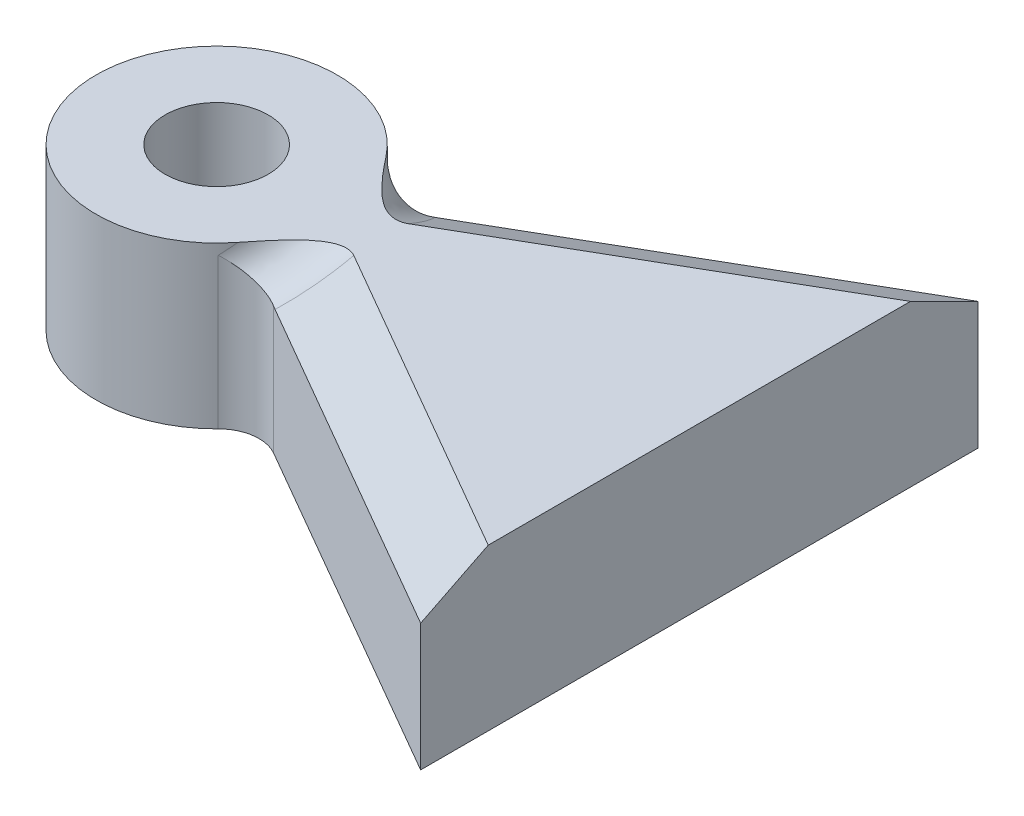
ISO-10303-21;
HEADER;
FILE_DESCRIPTION(('STEP AP214'),'2;1');
FILE_NAME('part.step','',(''),(''),'','','');
FILE_SCHEMA(('AUTOMOTIVE_DESIGN { 1 0 10303 214 1 1 1 1 }'));
ENDSEC;
DATA;
#1=APPLICATION_CONTEXT('core data for automotive mechanical design processes');
#2=APPLICATION_PROTOCOL_DEFINITION('international standard','automotive_design',2000,#1);
#3=PRODUCT_CONTEXT('',#1,'mechanical');
#4=PRODUCT('Part','Part','',(#3));
#5=PRODUCT_RELATED_PRODUCT_CATEGORY('part','',(#4));
#6=PRODUCT_DEFINITION_FORMATION('','',#4);
#7=PRODUCT_DEFINITION_CONTEXT('part definition',#1,'design');
#8=PRODUCT_DEFINITION('design','',#6,#7);
#9=PRODUCT_DEFINITION_SHAPE('','',#8);
#10=(LENGTH_UNIT() NAMED_UNIT(*) SI_UNIT(.MILLI.,.METRE.));
#11=(NAMED_UNIT(*) PLANE_ANGLE_UNIT() SI_UNIT($,.RADIAN.));
#12=(NAMED_UNIT(*) SI_UNIT($,.STERADIAN.) SOLID_ANGLE_UNIT());
#13=UNCERTAINTY_MEASURE_WITH_UNIT(LENGTH_MEASURE(1.E-05),#10,'distance_accuracy_value','');
#14=(GEOMETRIC_REPRESENTATION_CONTEXT(3) GLOBAL_UNCERTAINTY_ASSIGNED_CONTEXT((#13)) GLOBAL_UNIT_ASSIGNED_CONTEXT((#10,
#11,#12)) REPRESENTATION_CONTEXT('',''));
#15=CARTESIAN_POINT('',(0.,0.,0.));
#16=DIRECTION('',(0.,0.,1.));
#17=DIRECTION('',(1.,0.,0.));
#18=AXIS2_PLACEMENT_3D('',#15,#16,#17);
#19=CARTESIAN_POINT('',(0.,25.4,0.));
#20=DIRECTION('',(0.,-1.,0.));
#21=DIRECTION('',(0.,0.,-1.));
#22=AXIS2_PLACEMENT_3D('',#19,#20,#21);
#23=CYLINDRICAL_SURFACE('',#22,19.05);
#24=CARTESIAN_POINT('',(0.,27.3983484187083,0.));
#25=DIRECTION('',(0.30499714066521,-0.792405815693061,0.528270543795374));
#26=DIRECTION('',(-0.396202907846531,-0.609994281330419,-0.68624356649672));
#27=AXIS2_PLACEMENT_3D('',#24,#25,#26);
#28=ELLIPSE('',#27,24.0407119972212,19.05);
#29=CARTESIAN_POINT('',(15.0459243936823,25.4,-11.6842911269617));
#30=VERTEX_POINT('',#29);
#31=CARTESIAN_POINT('',(13.5926606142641,23.7321742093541,-13.3469875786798));
#32=VERTEX_POINT('',#31);
#33=EDGE_CURVE('E182',#30,#32,#28,.F.);
#34=ORIENTED_EDGE('',*,*,#33,.T.);
#35=DIRECTION('',(0.,-1.,0.));
#36=VECTOR('',#35,1.);
#37=CARTESIAN_POINT('',(13.5926606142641,25.4,-13.3469875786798));
#38=LINE('',#37,#36);
#39=CARTESIAN_POINT('',(13.5926606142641,0.,-13.3469875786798));
#40=VERTEX_POINT('',#39);
#41=EDGE_CURVE('E184',#32,#40,#38,.T.);
#42=ORIENTED_EDGE('',*,*,#41,.T.);
#43=CARTESIAN_POINT('',(0.,0.,0.));
#44=DIRECTION('',(0.,1.,0.));
#45=DIRECTION('',(0.,0.,1.));
#46=AXIS2_PLACEMENT_3D('',#43,#44,#45);
#47=CIRCLE('',#46,19.05);
#48=CARTESIAN_POINT('',(13.5926606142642,0.,13.3469875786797));
#49=VERTEX_POINT('',#48);
#50=EDGE_CURVE('E155',#40,#49,#47,.T.);
#51=ORIENTED_EDGE('',*,*,#50,.T.);
#52=DIRECTION('',(0.,-1.,0.));
#53=VECTOR('',#52,1.);
#54=CARTESIAN_POINT('',(13.5926606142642,25.4,13.3469875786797));
#55=LINE('',#54,#53);
#56=CARTESIAN_POINT('',(13.5926606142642,23.7321742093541,13.3469875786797));
#57=VERTEX_POINT('',#56);
#58=EDGE_CURVE('E177',#49,#57,#55,.F.);
#59=ORIENTED_EDGE('',*,*,#58,.T.);
#60=CARTESIAN_POINT('',(0.,27.3983484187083,0.));
#61=DIRECTION('',(0.304997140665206,-0.792405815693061,-0.528270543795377));
#62=DIRECTION('',(-0.396202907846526,-0.609994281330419,0.686243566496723));
#63=AXIS2_PLACEMENT_3D('',#60,#61,#62);
#64=ELLIPSE('',#63,24.0407119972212,19.05);
#65=CARTESIAN_POINT('',(15.0459243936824,25.4,11.6842911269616));
#66=VERTEX_POINT('',#65);
#67=EDGE_CURVE('E179',#57,#66,#64,.F.);
#68=ORIENTED_EDGE('',*,*,#67,.T.);
#69=CARTESIAN_POINT('',(0.,25.4,0.));
#70=DIRECTION('',(0.,1.,0.));
#71=DIRECTION('',(0.,0.,1.));
#72=AXIS2_PLACEMENT_3D('',#69,#70,#71);
#73=CIRCLE('',#72,19.05);
#74=EDGE_CURVE('E158',#30,#66,#73,.T.);
#75=ORIENTED_EDGE('',*,*,#74,.F.);
#76=EDGE_LOOP('',(#34,#42,#51,#59,#68,#75));
#77=FACE_BOUND('',#76,.T.);
#78=ADVANCED_FACE('F35',(#77),#23,.T.);
#79=CARTESIAN_POINT('',(0.,25.4,0.));
#80=DIRECTION('',(0.,1.,0.));
#81=DIRECTION('',(0.,0.,1.));
#82=AXIS2_PLACEMENT_3D('',#79,#80,#81);
#83=PLANE('',#82);
#84=DIRECTION('',(0.,0.,-1.));
#85=VECTOR('',#84,1.);
#86=CARTESIAN_POINT('',(76.2,25.4,-43.9940905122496));
#87=LINE('',#86,#85);
#88=CARTESIAN_POINT('',(76.2,25.4,33.326090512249));
#89=VERTEX_POINT('',#88);
#90=CARTESIAN_POINT('',(76.2,25.4,-33.3260905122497));
#91=VERTEX_POINT('',#90);
#92=EDGE_CURVE('E148',#89,#91,#87,.T.);
#93=ORIENTED_EDGE('',*,*,#92,.T.);
#94=DIRECTION('',(-0.866025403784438,0.,0.500000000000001));
#95=VECTOR('',#94,1.);
#96=CARTESIAN_POINT('',(21.1171634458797,25.4,-1.52400000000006));
#97=LINE('',#96,#95);
#98=CARTESIAN_POINT('',(25.9803982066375,25.4,-4.3317898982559));
#99=VERTEX_POINT('',#98);
#100=EDGE_CURVE('E165',#91,#99,#97,.T.);
#101=ORIENTED_EDGE('',*,*,#100,.T.);
#102=CARTESIAN_POINT('',(-9.52500000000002,12.7336515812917,-16.4977839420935));
#103=CARTESIAN_POINT('',(-9.52500000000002,11.0321742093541,-16.4977839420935));
#104=CARTESIAN_POINT('',(-9.95036934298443,9.55865158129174,-17.2345452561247));
#105=CARTESIAN_POINT('',(-10.3757386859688,8.08512895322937,-17.9713065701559));
#106=CARTESIAN_POINT('',(-11.1125,7.23439026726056,-19.2474145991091));
#107=CARTESIAN_POINT('',(-9.88526667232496,12.7336515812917,-16.2897838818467));
#108=CARTESIAN_POINT('',(-9.90384442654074,11.0321742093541,-16.2790580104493));
#109=CARTESIAN_POINT('',(-10.3613915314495,9.55865158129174,-16.9972414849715));
#110=CARTESIAN_POINT('',(-10.8189385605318,8.08512895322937,-17.7154250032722));
#111=CARTESIAN_POINT('',(-11.5928555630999,7.23439026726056,-18.9700811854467));
#112=CARTESIAN_POINT('',(-10.2387143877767,12.7441500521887,-16.0699730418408));
#113=CARTESIAN_POINT('',(-10.2751863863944,11.0423767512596,-16.0472889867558));
#114=CARTESIAN_POINT('',(-10.7643057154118,9.56877142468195,-16.7458942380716));
#115=CARTESIAN_POINT('',(-11.2534686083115,8.09516834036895,-17.4444701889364));
#116=CARTESIAN_POINT('',(-12.0641191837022,7.24488873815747,-18.6770000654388));
#117=CARTESIAN_POINT('',(-10.929982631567,12.7860387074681,-15.6080361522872));
#118=CARTESIAN_POINT('',(-11.0005206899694,11.0830780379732,-15.5592109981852));
#119=CARTESIAN_POINT('',(-11.5515068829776,9.6091469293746,-16.2167006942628));
#120=CARTESIAN_POINT('',(-12.1025365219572,8.13521804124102,-16.8741611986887));
#121=CARTESIAN_POINT('',(-12.9858101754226,7.28677739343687,-18.0610842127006));
#122=CARTESIAN_POINT('',(-11.2678031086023,12.8174289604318,-15.3659100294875));
#123=CARTESIAN_POINT('',(-11.3545510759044,11.1135813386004,-15.3028723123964));
#124=CARTESIAN_POINT('',(-11.935793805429,9.63940265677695,-15.9388543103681));
#125=CARTESIAN_POINT('',(-12.5171189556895,8.16523283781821,-16.5747723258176));
#126=CARTESIAN_POINT('',(-13.4362374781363,7.31816764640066,-17.7382493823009));
#127=CARTESIAN_POINT('',(-11.9277962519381,12.9010177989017,-14.8594795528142));
#128=CARTESIAN_POINT('',(-12.0450840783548,11.1947924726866,-14.765935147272));
#129=CARTESIAN_POINT('',(-12.6855835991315,9.71996229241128,-15.3569259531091));
#130=CARTESIAN_POINT('',(-13.3261663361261,8.24514104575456,-15.9478521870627));
#131=CARTESIAN_POINT('',(-14.3162283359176,7.40175648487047,-17.0630087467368));
#132=CARTESIAN_POINT('',(-12.2498738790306,12.9533285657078,-14.5950617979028));
#133=CARTESIAN_POINT('',(-12.3815143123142,11.2456181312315,-14.4851779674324));
#134=CARTESIAN_POINT('',(-13.0509730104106,9.77037428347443,-15.0527095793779));
#135=CARTESIAN_POINT('',(-13.7205488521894,8.29515038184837,-15.6201366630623));
#136=CARTESIAN_POINT('',(-14.7456651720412,7.45406725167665,-16.7104517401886));
#137=CARTESIAN_POINT('',(-12.8748732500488,13.0782643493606,-14.0468145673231));
#138=CARTESIAN_POINT('',(-13.0330299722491,11.366979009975,-13.9024855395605));
#139=CARTESIAN_POINT('',(-13.758856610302,9.89075811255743,-14.4213361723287));
#140=CARTESIAN_POINT('',(-14.4848004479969,8.4145571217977,-14.9400823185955));
#141=CARTESIAN_POINT('',(-15.578997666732,7.57900303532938,-15.9794554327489));
#142=CARTESIAN_POINT('',(-13.1777891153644,13.1508955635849,-13.7629791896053));
#143=CARTESIAN_POINT('',(-13.3481370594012,11.4375333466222,-13.6005052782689));
#144=CARTESIAN_POINT('',(-14.1013437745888,9.96073591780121,-14.0941721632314));
#145=CARTESIAN_POINT('',(-14.8546952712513,8.48397333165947,-14.5876910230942));
#146=CARTESIAN_POINT('',(-15.9828854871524,7.65163424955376,-15.601008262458));
#147=CARTESIAN_POINT('',(-13.7660061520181,13.316635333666,-13.1747622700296));
#148=CARTESIAN_POINT('',(-13.9584890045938,11.5984919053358,-12.9743204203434));
#149=CARTESIAN_POINT('',(-14.7650584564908,10.1203917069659,-13.4157242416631));
#150=CARTESIAN_POINT('',(-15.5717756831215,8.64232703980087,-13.8569770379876));
#151=CARTESIAN_POINT('',(-16.7671748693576,7.81737401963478,-14.8167190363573));
#152=CARTESIAN_POINT('',(-14.0510926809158,13.4099479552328,-12.870198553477));
#153=CARTESIAN_POINT('',(-14.2535159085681,11.6891108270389,-12.649877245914));
#154=CARTESIAN_POINT('',(-15.086029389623,10.2102660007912,-13.0642258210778));
#155=CARTESIAN_POINT('',(-15.9187119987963,8.73147568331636,-13.4783759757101));
#156=CARTESIAN_POINT('',(-17.147290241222,7.91068664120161,-14.4106340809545));
#157=CARTESIAN_POINT('',(-14.599110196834,13.6157794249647,-12.2450532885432));
#158=CARTESIAN_POINT('',(-14.8188735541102,11.8889407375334,-11.9837597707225));
#159=CARTESIAN_POINT('',(-15.7014801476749,10.4084683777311,-12.3424662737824));
#160=CARTESIAN_POINT('',(-16.584256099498,8.92805051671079,-12.7009742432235));
#161=CARTESIAN_POINT('',(-17.8779802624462,8.11651811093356,-13.5771070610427));
#162=CARTESIAN_POINT('',(-14.8620343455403,13.7283041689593,-11.9244668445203));
#163=CARTESIAN_POINT('',(-15.0892126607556,11.9981781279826,-11.6420358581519));
#164=CARTESIAN_POINT('',(-15.9959517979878,10.5168021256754,-11.9721994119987));
#165=CARTESIAN_POINT('',(-16.9028743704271,9.03550266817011,-12.3021155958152));
#166=CARTESIAN_POINT('',(-18.2285457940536,8.22904285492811,-13.1496584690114));
#167=CARTESIAN_POINT('',(-15.3683509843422,13.9733194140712,-11.2646219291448));
#168=CARTESIAN_POINT('',(-15.6078161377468,12.2359577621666,-10.9387056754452));
#169=CARTESIAN_POINT('',(-16.5612694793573,10.7526286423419,-11.2099823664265));
#170=CARTESIAN_POINT('',(-17.5149116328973,9.26937826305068,-11.4810045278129));
#171=CARTESIAN_POINT('',(-18.9036346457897,8.47405810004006,-12.2698652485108));
#172=CARTESIAN_POINT('',(-15.6114073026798,14.1060743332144,-10.9251609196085));
#173=CARTESIAN_POINT('',(-15.8557132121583,12.3647787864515,-10.5768404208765));
#174=CARTESIAN_POINT('',(-16.8317137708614,10.8803750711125,-10.8177965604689));
#175=CARTESIAN_POINT('',(-17.8079101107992,9.39607565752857,-11.0584469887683));
#176=CARTESIAN_POINT('',(-19.2277097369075,8.60681301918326,-11.8172505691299));
#177=CARTESIAN_POINT('',(-16.0730705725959,14.3892521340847,-10.2338528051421));
#178=CARTESIAN_POINT('',(-16.3242999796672,12.6394635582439,-9.84012256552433));
#179=CARTESIAN_POINT('',(-17.3433980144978,11.1527834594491,-10.0191539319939));
#180=CARTESIAN_POINT('',(-18.362692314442,9.66620777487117,-10.1978790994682));
#181=CARTESIAN_POINT('',(-19.8432607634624,8.88999082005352,-10.895506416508));
#182=CARTESIAN_POINT('',(-16.2916701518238,14.5396803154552,-9.88200200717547));
#183=CARTESIAN_POINT('',(-16.5449839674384,12.7853591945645,-9.46521938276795));
#184=CARTESIAN_POINT('',(-17.5846291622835,11.2974504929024,-9.6126928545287));
#185=CARTESIAN_POINT('',(-18.6244703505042,9.80967383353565,-9.75980936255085));
#186=CARTESIAN_POINT('',(-20.1347268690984,9.04041900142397,-10.4263720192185));
#187=CARTESIAN_POINT('',(-16.7074410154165,14.8597441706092,-9.16186080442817));
#188=CARTESIAN_POINT('',(-16.9621674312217,13.0956560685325,-8.69829474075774));
#189=CARTESIAN_POINT('',(-18.041187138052,11.6051458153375,-8.78097303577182));
#190=CARTESIAN_POINT('',(-19.1204093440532,10.1147720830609,-8.86328235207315));
#191=CARTESIAN_POINT('',(-20.6890880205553,9.36048285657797,-9.46618374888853));
#192=CARTESIAN_POINT('',(-16.90417932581,15.0296655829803,-8.79339176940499));
#193=CARTESIAN_POINT('',(-17.1581784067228,13.2603597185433,-8.30604795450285));
#194=CARTESIAN_POINT('',(-18.2559973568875,11.7684469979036,-8.35551126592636));
#195=CARTESIAN_POINT('',(-19.3540102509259,10.2767010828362,-8.40455480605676));
#196=CARTESIAN_POINT('',(-20.9514057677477,9.53040426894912,-8.97489170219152));
#197=CARTESIAN_POINT('',(-17.2716022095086,15.3853013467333,-8.04780642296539));
#198=CARTESIAN_POINT('',(-17.5213127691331,13.604921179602,-7.51294662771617));
#199=CARTESIAN_POINT('',(-18.6545708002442,12.1100860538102,-7.49495529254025));
#200=CARTESIAN_POINT('',(-19.7880248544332,10.6154183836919,-7.47654175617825));
#201=CARTESIAN_POINT('',(-21.4413029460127,9.88604003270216,-7.98077790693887));
#202=CARTESIAN_POINT('',(-17.4422792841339,15.5710202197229,-7.67068765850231));
#203=CARTESIAN_POINT('',(-17.688416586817,13.7848143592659,-7.11204397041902));
#204=CARTESIAN_POINT('',(-18.8383250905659,12.2884282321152,-7.05985835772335));
#205=CARTESIAN_POINT('',(-19.9884168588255,10.7922414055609,-7.00719933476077));
#206=CARTESIAN_POINT('',(-21.6688723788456,10.0717589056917,-7.47795288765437));
#207=CARTESIAN_POINT('',(-17.920872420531,16.1571460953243,-6.51518296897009));
#208=CARTESIAN_POINT('',(-18.1521822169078,14.3525938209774,-5.88417452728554));
#209=CARTESIAN_POINT('',(-19.3490867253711,12.8510143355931,-5.72747138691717));
#210=CARTESIAN_POINT('',(-20.5467342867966,11.3502585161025,-5.56882039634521));
#211=CARTESIAN_POINT('',(-22.3069965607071,10.6578847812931,-5.93727996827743));
#212=CARTESIAN_POINT('',(-18.1877245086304,16.5805942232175,-5.72594365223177));
#213=CARTESIAN_POINT('',(-18.4030203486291,14.7624005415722,-5.0473112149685));
#214=CARTESIAN_POINT('',(-19.6272194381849,13.2571157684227,-4.81845189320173));
#215=CARTESIAN_POINT('',(-20.8519606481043,11.7529237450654,-4.58726741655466));
#216=CARTESIAN_POINT('',(-22.6627993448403,11.0813329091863,-4.88496087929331));
#217=CARTESIAN_POINT('',(-18.6180619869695,17.4855271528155,-4.12008879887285));
#218=CARTESIAN_POINT('',(-18.7903848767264,15.6370221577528,-3.34943067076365));
#219=CARTESIAN_POINT('',(-20.060335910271,14.1239544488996,-2.97221495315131));
#220=CARTESIAN_POINT('',(-21.3308590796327,12.6120238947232,-2.59257497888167));
#221=CARTESIAN_POINT('',(-23.2365826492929,11.9862658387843,-2.743821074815));
#222=CARTESIAN_POINT('',(-18.7795070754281,17.9679543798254,-3.30323759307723));
#223=CARTESIAN_POINT('',(-18.924412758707,16.1029838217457,-2.48797867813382));
#224=CARTESIAN_POINT('',(-20.2129029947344,14.5855762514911,-2.0347888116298));
#225=CARTESIAN_POINT('',(-21.5016540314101,13.0695795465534,-1.57885516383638));
#226=CARTESIAN_POINT('',(-23.4518427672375,12.4686930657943,-1.65468613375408));
#227=CARTESIAN_POINT('',(-18.9964267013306,18.9829570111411,-1.65549504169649));
#228=CARTESIAN_POINT('',(-19.0764103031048,17.0818619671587,-0.756685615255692));
#229=CARTESIAN_POINT('',(-20.3926153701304,15.5554122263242,-0.148465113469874));
#230=CARTESIAN_POINT('',(-21.7090922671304,14.0304259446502,0.462602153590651));
#231=CARTESIAN_POINT('',(-23.7410689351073,13.48369569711,0.542303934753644));
#232=CARTESIAN_POINT('',(-19.0499941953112,19.5162631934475,-0.824608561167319));
#233=CARTESIAN_POINT('',(-19.091963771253,17.5957097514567,0.113252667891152));
#234=CARTESIAN_POINT('',(-20.4175154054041,16.0643012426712,0.800345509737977));
#235=CARTESIAN_POINT('',(-21.74294126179,14.5346234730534,1.49053993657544));
#236=CARTESIAN_POINT('',(-23.8124922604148,14.0170018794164,1.65015257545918));
#237=CARTESIAN_POINT('',(-19.0500058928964,20.624090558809,0.837139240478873));
#238=CARTESIAN_POINT('',(-19.0072562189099,18.6612616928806,1.84511500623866));
#239=CARTESIAN_POINT('',(-20.3416811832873,17.1195797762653,2.69195673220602));
#240=CARTESIAN_POINT('',(-21.6759789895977,15.5796872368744,3.54200677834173));
#241=CARTESIAN_POINT('',(-23.8125078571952,15.1248292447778,3.86581631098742));
#242=CARTESIAN_POINT('',(-18.9948098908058,21.1991148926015,1.66780831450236));
#243=CARTESIAN_POINT('',(-18.9048237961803,19.2136572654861,2.70685807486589));
#244=CARTESIAN_POINT('',(-20.2390320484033,17.6664216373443,3.6344469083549));
#245=CARTESIAN_POINT('',(-21.5726424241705,16.121222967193,4.56541684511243));
#246=CARTESIAN_POINT('',(-23.7389131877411,15.6998535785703,4.97337507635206));
#247=CARTESIAN_POINT('',(-18.777939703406,22.3807902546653,3.31511129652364));
#248=CARTESIAN_POINT('',(-18.5867454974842,20.3465499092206,4.40622342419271));
#249=CARTESIAN_POINT('',(-19.9103471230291,18.7878548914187,5.49616323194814));
#250=CARTESIAN_POINT('',(-21.2333360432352,17.2312533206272,6.58957892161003));
#251=CARTESIAN_POINT('',(-23.4497529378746,16.8815289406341,7.16977905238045));
#252=CARTESIAN_POINT('',(-18.6149896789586,22.9877390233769,4.13145520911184));
#253=CARTESIAN_POINT('',(-18.3692915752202,20.9275155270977,5.24349361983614));
#254=CARTESIAN_POINT('',(-19.6828385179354,19.3627013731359,6.41497184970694));
#255=CARTESIAN_POINT('',(-20.995248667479,17.8001978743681,7.59000821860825));
#256=CARTESIAN_POINT('',(-23.2324862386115,17.4884777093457,8.25823760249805));
#257=CARTESIAN_POINT('',(-18.1849988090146,24.2230817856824,5.73621400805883));
#258=CARTESIAN_POINT('',(-17.8260660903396,22.1072134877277,6.87827325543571));
#259=CARTESIAN_POINT('',(-19.109088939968,20.5298154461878,8.21245724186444));
#260=CARTESIAN_POINT('',(-20.3909533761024,18.9547756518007,9.55027372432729));
#261=CARTESIAN_POINT('',(-22.6591650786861,18.7238204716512,10.397916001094));
#262=CARTESIAN_POINT('',(-17.9171012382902,24.8516124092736,6.52433920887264));
#263=CARTESIAN_POINT('',(-17.4989155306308,22.706231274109,7.67537615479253));
#264=CARTESIAN_POINT('',(-18.7618736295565,21.1221883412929,9.0907354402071));
#265=CARTESIAN_POINT('',(-20.0231164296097,19.5406795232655,10.5097107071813));
#266=CARTESIAN_POINT('',(-22.3019683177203,19.3523510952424,11.4487496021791));
#267=CARTESIAN_POINT('',(-17.2813594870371,26.1195216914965,8.05915746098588));
#268=CARTESIAN_POINT('',(-16.74347617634,23.911317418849,9.21506421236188));
#269=CARTESIAN_POINT('',(-17.9557787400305,22.3136506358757,10.7910982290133));
#270=CARTESIAN_POINT('',(-19.1663461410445,20.7185497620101,12.3707946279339));
#271=CARTESIAN_POINT('',(-21.4543126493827,20.6202603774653,13.4951739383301));
#272=CARTESIAN_POINT('',(-16.9130949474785,26.7589351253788,8.8056599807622));
#273=CARTESIAN_POINT('',(-16.3142570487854,24.5175430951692,9.95730408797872));
#274=CARTESIAN_POINT('',(-17.4964303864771,22.9127578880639,11.6129278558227));
#275=CARTESIAN_POINT('',(-18.676302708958,21.3106627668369,13.2720939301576));
#276=CARTESIAN_POINT('',(-20.9632932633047,21.2596738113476,14.4905106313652));
#277=CARTESIAN_POINT('',(-16.0824729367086,28.0377617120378,10.2443400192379));
#278=CARTESIAN_POINT('',(-15.3640375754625,25.7261450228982,11.3737623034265));
#279=CARTESIAN_POINT('',(-16.4754661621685,24.1068090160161,13.185509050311));
#280=CARTESIAN_POINT('',(-17.5845859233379,22.4901742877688,15.0008139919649));
#281=CARTESIAN_POINT('',(-19.8557972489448,22.5385003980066,16.4087506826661));
#282=CARTESIAN_POINT('',(-15.6201154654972,28.6771748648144,10.9365175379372));
#283=CARTESIAN_POINT('',(-14.8425356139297,26.3286123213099,12.0477992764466));
#284=CARTESIAN_POINT('',(-15.9138502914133,24.7017528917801,13.9362606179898));
#285=CARTESIAN_POINT('',(-16.982308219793,23.0776573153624,15.8280548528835));
#286=CARTESIAN_POINT('',(-19.239320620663,23.1779135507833,17.3316540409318));
#287=CARTESIAN_POINT('',(-14.6087934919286,29.9450847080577,12.2544952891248));
#288=CARTESIAN_POINT('',(-13.7191070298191,27.5188439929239,13.3159932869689));
#289=CARTESIAN_POINT('',(-14.6999233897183,25.8766559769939,15.3533757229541));
#290=CARTESIAN_POINT('',(-15.6778973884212,24.2372200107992,17.3940782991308));
#291=CARTESIAN_POINT('',(-17.8908913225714,24.4458233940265,19.088957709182));
#292=CARTESIAN_POINT('',(-14.0602041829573,30.5736161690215,12.8805642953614));
#293=CARTESIAN_POINT('',(-13.1170555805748,28.1066956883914,13.9102144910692));
#294=CARTESIAN_POINT('',(-14.0480066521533,26.4566679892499,16.0200832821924));
#295=CARTESIAN_POINT('',(-14.9756164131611,24.8093842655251,18.1329446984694));
#296=CARTESIAN_POINT('',(-17.1594389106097,25.0743548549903,19.9237163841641));
#297=CARTESIAN_POINT('',(-12.8854422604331,31.8089567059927,14.0553259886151));
#298=CARTESIAN_POINT('',(-11.8456272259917,29.2571338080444,15.0089413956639));
#299=CARTESIAN_POINT('',(-12.6670019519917,27.5911931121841,17.257761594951));
#300=CARTESIAN_POINT('',(-13.4850782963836,25.9279630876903,19.5095397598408));
#301=CARTESIAN_POINT('',(-15.5930896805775,26.3096953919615,21.4900653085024));
#302=CARTESIAN_POINT('',(-12.2599488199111,32.4159024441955,14.6046157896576));
#303=CARTESIAN_POINT('',(-11.176426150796,29.8198614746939,15.5138105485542));
#304=CARTESIAN_POINT('',(-11.9385968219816,28.1458774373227,17.829478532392));
#305=CARTESIAN_POINT('',(-12.6970518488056,26.4745191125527,20.147684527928));
#306=CARTESIAN_POINT('',(-14.7590984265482,26.9166411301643,22.2224517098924));
#307=CARTESIAN_POINT('',(-10.9417610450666,33.5975860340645,15.6160851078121));
#308=CARTESIAN_POINT('',(-9.78512848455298,30.9100692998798,16.4263755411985));
#309=CARTESIAN_POINT('',(-10.4197051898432,29.2198353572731,18.868163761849));
#310=CARTESIAN_POINT('',(-11.050643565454,27.5321754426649,21.3124429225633));
#311=CARTESIAN_POINT('',(-13.0015147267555,28.0983247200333,23.5710774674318));
#312=CARTESIAN_POINT('',(-10.2499561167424,34.1726214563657,16.0792244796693));
#313=CARTESIAN_POINT('',(-9.06341662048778,31.4377920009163,16.8347543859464));
#314=CARTESIAN_POINT('',(-9.63006170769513,29.7394520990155,19.3362988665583));
#315=CARTESIAN_POINT('',(-10.1927720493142,28.0435199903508,21.8398396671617));
#316=CARTESIAN_POINT('',(-12.0791081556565,28.6733601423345,24.1885966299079));
#317=CARTESIAN_POINT('',(-8.81089535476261,35.2804186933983,16.9100782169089));
#318=CARTESIAN_POINT('',(-7.58250601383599,32.4488033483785,17.5495303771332));
#319=CARTESIAN_POINT('',(-8.00506193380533,30.7341845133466,20.1614414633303));
#320=CARTESIAN_POINT('',(-8.42378219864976,29.0219144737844,22.775301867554));
#321=CARTESIAN_POINT('',(-10.1603604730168,29.7811573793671,25.2964016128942));
#322=CARTESIAN_POINT('',(-8.06462453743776,35.8136844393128,17.2791171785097));
#323=CARTESIAN_POINT('',(-6.82380333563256,32.9324672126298,17.8569121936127));
#324=CARTESIAN_POINT('',(-7.1705668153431,31.2098498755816,20.5200074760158));
#325=CARTESIAN_POINT('',(-7.51334275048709,29.4893407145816,23.1845118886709));
#326=CARTESIAN_POINT('',(-9.16533271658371,30.3144231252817,25.7884535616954));
#327=CARTESIAN_POINT('',(-6.52895584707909,36.8287968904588,17.9151671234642));
#328=CARTESIAN_POINT('',(-5.28412682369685,33.8475132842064,18.3677714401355));
#329=CARTESIAN_POINT('',(-5.4722748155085,32.1089675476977,21.1225747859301));
#330=CARTESIAN_POINT('',(-5.65657325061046,30.3724627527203,23.8787495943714));
#331=CARTESIAN_POINT('',(-7.11777446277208,31.3295355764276,26.6365201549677));
#332=CARTESIAN_POINT('',(-5.74052232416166,37.3113711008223,18.1838261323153));
#333=CARTESIAN_POINT('',(-4.50367400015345,34.2794113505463,18.572478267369));
#334=CARTESIAN_POINT('',(-4.60923030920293,32.5331781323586,21.3684431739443));
#335=CARTESIAN_POINT('',(-4.71098531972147,30.7886724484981,24.1652335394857));
#336=CARTESIAN_POINT('',(-6.06652976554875,31.8121097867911,26.9947321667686));
#337=CARTESIAN_POINT('',(-4.53270580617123,37.9920322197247,18.5074846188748));
#338=CARTESIAN_POINT('',(-3.32582635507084,34.8840065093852,18.8026653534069));
#339=CARTESIAN_POINT('',(-3.30186823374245,33.1270334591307,21.6516975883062));
#340=CARTESIAN_POINT('',(-3.27697864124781,31.3704831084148,24.5009307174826));
#341=CARTESIAN_POINT('',(-4.45610774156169,32.4927709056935,27.4262768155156));
#342=CARTESIAN_POINT('',(-4.12970280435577,38.2099171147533,18.6016380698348));
#343=CARTESIAN_POINT('',(-2.93500191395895,35.0770232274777,18.8663763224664));
#344=CARTESIAN_POINT('',(-2.8679731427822,33.3163642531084,21.7315053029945));
#345=CARTESIAN_POINT('',(-2.80004117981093,31.5560831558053,24.5967708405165));
#346=CARTESIAN_POINT('',(-3.91877040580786,32.7106558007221,27.5518147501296));
#347=CARTESIAN_POINT('',(-3.31456528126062,38.6319225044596,18.7640262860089));
#348=CARTESIAN_POINT('',(-2.14979062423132,35.4495845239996,18.9693051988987));
#349=CARTESIAN_POINT('',(-1.99513741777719,33.6816383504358,21.8636954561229));
#350=CARTESIAN_POINT('',(-1.83958449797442,31.9140687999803,24.7582222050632));
#351=CARTESIAN_POINT('',(-2.83192037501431,33.1326611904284,27.7683323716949));
#352=CARTESIAN_POINT('',(-2.9024332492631,38.8360466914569,18.8322680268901));
#353=CARTESIAN_POINT('',(-1.75543314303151,35.6290878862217,19.0084743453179));
#354=CARTESIAN_POINT('',(-1.55619817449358,33.8575852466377,21.9160852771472));
#355=CARTESIAN_POINT('',(-1.35609719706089,32.0864143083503,24.8237716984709));
#356=CARTESIAN_POINT('',(-2.28241099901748,33.3367853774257,27.8593213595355));
#357=CARTESIAN_POINT('',(-2.07818853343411,39.2256426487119,18.9407840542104));
#358=CARTESIAN_POINT('',(-0.971981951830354,35.9704937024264,19.0616286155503));
#359=CARTESIAN_POINT('',(-0.683106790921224,34.1920697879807,21.9923076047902));
#360=CARTESIAN_POINT('',(-0.393393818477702,32.4139669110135,24.9230598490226));
#361=CARTESIAN_POINT('',(-1.18341804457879,33.7263813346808,28.0040093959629));
#362=CARTESIAN_POINT('',(-1.66621216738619,39.4113863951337,18.9815450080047));
#363=CARTESIAN_POINT('',(-0.582948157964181,36.1326174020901,19.0760108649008));
#364=CARTESIAN_POINT('',(-0.249013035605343,34.3508661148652,22.0166427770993));
#365=CARTESIAN_POINT('',(0.0857131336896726,32.5693903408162,24.9572941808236));
#366=CARTESIAN_POINT('',(-0.634116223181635,33.9121250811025,28.0583573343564));
#367=CARTESIAN_POINT('',(-0.836773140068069,39.7670403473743,19.0361490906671));
#368=CARTESIAN_POINT('',(0.195343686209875,36.4419881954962,19.0809121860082));
#369=CARTESIAN_POINT('',(0.620396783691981,34.6537387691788,22.0381874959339));
#370=CARTESIAN_POINT('',(1.04624142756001,32.8657651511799,24.9954825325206));
#371=CARTESIAN_POINT('',(0.47180247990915,34.2677790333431,28.1311627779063));
#372=CARTESIAN_POINT('',(-0.419312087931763,39.9369550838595,19.0499999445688));
#373=CARTESIAN_POINT('',(0.584552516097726,36.5891927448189,19.0713943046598));
#374=CARTESIAN_POINT('',(1.05571246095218,34.7978193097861,22.0354048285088));
#375=CARTESIAN_POINT('',(1.52760515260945,33.0066754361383,24.9993876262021));
#376=CARTESIAN_POINT('',(1.02841721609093,34.4376937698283,28.1496305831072));
#377=CARTESIAN_POINT('',(0.41222555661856,40.2570141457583,19.0500000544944));
#378=CARTESIAN_POINT('',(1.35514541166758,36.8655510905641,19.0289320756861));
#379=CARTESIAN_POINT('',(1.91848461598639,35.068181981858,22.0028689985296));
#380=CARTESIAN_POINT('',(2.48253351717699,33.271035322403,24.9767792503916));
#381=CARTESIAN_POINT('',(2.13713407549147,34.7577528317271,28.1496307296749));
#382=CARTESIAN_POINT('',(0.826240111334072,40.4074440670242,19.0366135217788));
#383=CARTESIAN_POINT('',(1.73650368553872,36.9949264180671,18.9963503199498));
#384=CARTESIAN_POINT('',(2.34594958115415,35.1947237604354,21.9735724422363));
#385=CARTESIAN_POINT('',(2.95603747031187,33.3946997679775,24.9507305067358));
#386=CARTESIAN_POINT('',(2.68915348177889,34.908182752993,28.1317820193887));
#387=CARTESIAN_POINT('',(1.65576435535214,40.6906231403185,18.982456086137));
#388=CARTESIAN_POINT('',(2.49643881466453,37.237718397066,18.9083836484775));
#389=CARTESIAN_POINT('',(3.19850936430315,35.4320827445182,21.8886638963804));
#390=CARTESIAN_POINT('',(3.9012225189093,33.6266260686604,24.8688802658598));
#391=CARTESIAN_POINT('',(3.79518580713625,35.1913618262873,28.0595721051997));
#392=CARTESIAN_POINT('',(2.07127355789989,40.8233775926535,18.9416934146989));
#393=CARTESIAN_POINT('',(2.87495006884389,37.3510958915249,18.8529784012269));
#394=CARTESIAN_POINT('',(3.62360485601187,35.5429046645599,21.8330598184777));
#395=CARTESIAN_POINT('',(4.37282399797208,33.7348503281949,24.8130495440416));
#396=CARTESIAN_POINT('',(4.34919807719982,35.3241162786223,28.0052218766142));
#397=CARTESIAN_POINT('',(2.89587374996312,41.0683925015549,18.8331326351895));
#398=CARTESIAN_POINT('',(3.62251656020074,37.5597564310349,18.7205977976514));
#399=CARTESIAN_POINT('',(4.46378236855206,35.7467666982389,21.6966596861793));
#400=CARTESIAN_POINT('',(5.30559765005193,33.9339103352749,24.6726324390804));
#401=CARTESIAN_POINT('',(5.44866499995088,35.5691311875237,27.8604741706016));
#402=CARTESIAN_POINT('',(3.30497204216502,41.1809173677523,18.7657269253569));
#403=CARTESIAN_POINT('',(3.99156434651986,37.6552355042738,18.6439217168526));
#404=CARTESIAN_POINT('',(4.87892084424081,35.8400371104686,21.6162328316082));
#405=CARTESIAN_POINT('',(5.76674297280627,34.0249347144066,24.5884388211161));
#406=CARTESIAN_POINT('',(5.9941293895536,35.6816560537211,27.770599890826));
#407=CARTESIAN_POINT('',(4.12037263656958,41.3867489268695,18.6037025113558));
#408=CARTESIAN_POINT('',(4.7242583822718,37.8294640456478,18.469071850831));
#409=CARTESIAN_POINT('',(5.70353920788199,36.0101590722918,21.4302402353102));
#410=CARTESIAN_POINT('',(6.68328612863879,34.1909503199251,24.3913035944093));
#411=CARTESIAN_POINT('',(7.081330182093,35.8874876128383,27.5545673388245));
#412=CARTESIAN_POINT('',(4.52667575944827,41.4800615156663,18.5090921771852));
#413=CARTESIAN_POINT('',(5.08782802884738,37.9081825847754,18.3708975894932));
#414=CARTESIAN_POINT('',(6.11302079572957,36.0870156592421,21.3246822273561));
#415=CARTESIAN_POINT('',(7.13858896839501,34.2659119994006,24.2783577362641));
#416=CARTESIAN_POINT('',(7.62306767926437,35.9808002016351,27.4284202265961));
#417=CARTESIAN_POINT('',(5.33019503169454,41.6458012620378,18.2937897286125));
#418=CARTESIAN_POINT('',(5.80474093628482,38.0477266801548,18.1545832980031));
#419=CARTESIAN_POINT('',(6.92068940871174,36.2232027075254,21.0900021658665));
#420=CARTESIAN_POINT('',(8.03700634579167,34.3987408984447,24.0253140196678));
#421=CARTESIAN_POINT('',(8.69442670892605,36.1465399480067,27.1413502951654));
#422=CARTESIAN_POINT('',(5.72746162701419,41.7184324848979,18.1733745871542));
#423=CARTESIAN_POINT('',(6.1580731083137,38.108697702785,18.0366606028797));
#424=CARTESIAN_POINT('',(7.31894915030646,36.2827045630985,20.9611324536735));
#425=CARTESIAN_POINT('',(8.48010116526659,34.4567471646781,23.8855056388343));
#426=CARTESIAN_POINT('',(9.22411550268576,36.2191711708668,26.9807967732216));
#427=CARTESIAN_POINT('',(6.51475735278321,41.8433682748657,17.9062328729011));
#428=CARTESIAN_POINT('',(6.85709430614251,38.2134302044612,17.7806701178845));
#429=CARTESIAN_POINT('',(8.1068591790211,36.3848752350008,20.6796360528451));
#430=CARTESIAN_POINT('',(9.35690039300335,34.5563561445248,23.5785033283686));
#431=CARTESIAN_POINT('',(10.2738431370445,36.3441069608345,26.6246078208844));
#432=CARTESIAN_POINT('',(6.90478865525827,41.8956790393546,17.7595143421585));
#433=CARTESIAN_POINT('',(7.20270253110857,38.2571732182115,17.6426228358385));
#434=CARTESIAN_POINT('',(8.49651205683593,36.4275491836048,20.5270166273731));
#435=CARTESIAN_POINT('',(9.79050352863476,34.5979412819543,23.4113327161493));
#436=CARTESIAN_POINT('',(10.7938848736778,36.3964177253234,26.4289831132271));
#437=CARTESIAN_POINT('',(7.67336688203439,41.9792678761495,17.4411587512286));
#438=CARTESIAN_POINT('',(7.88345947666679,38.327017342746,17.3476592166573));
#439=CARTESIAN_POINT('',(9.26380907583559,36.4956642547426,20.1994392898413));
#440=CARTESIAN_POINT('',(10.644339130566,34.6643272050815,23.051142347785));
#441=CARTESIAN_POINT('',(11.8186558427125,36.4800065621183,26.0045089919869));
#442=CARTESIAN_POINT('',(8.05196449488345,42.0106581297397,17.2696606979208));
#443=CARTESIAN_POINT('',(8.21857302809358,38.3531964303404,17.1908733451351));
#444=CARTESIAN_POINT('',(9.64150675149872,36.5211972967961,20.0246066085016));
#445=CARTESIAN_POINT('',(11.0645287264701,34.6892021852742,22.8582957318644));
#446=CARTESIAN_POINT('',(12.3234526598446,36.5113968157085,25.77584492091));
#447=CARTESIAN_POINT('',(8.79764769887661,42.0525467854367,16.9019732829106));
#448=CARTESIAN_POINT('',(8.87926477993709,38.3881273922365,16.8583628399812));
#449=CARTESIAN_POINT('',(10.3857187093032,36.5552571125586,19.6525943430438));
#450=CARTESIAN_POINT('',(11.8922612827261,34.7223909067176,22.4467815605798));
#451=CARTESIAN_POINT('',(13.3176969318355,36.5532854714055,25.2855950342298));
#452=CARTESIAN_POINT('',(9.16473332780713,42.0630452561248,16.7057840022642));
#453=CARTESIAN_POINT('',(9.20476255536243,38.3968710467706,16.6826731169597));
#454=CARTESIAN_POINT('',(10.7522330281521,36.5637839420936,19.4554148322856));
#455=CARTESIAN_POINT('',(12.2997033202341,34.7306968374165,22.2281566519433));
#456=CARTESIAN_POINT('',(13.8071444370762,36.5637839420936,25.0240093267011));
#457=CARTESIAN_POINT('',(9.88526667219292,42.0630452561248,16.2897838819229));
#458=CARTESIAN_POINT('',(9.84523744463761,38.3968710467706,16.3128947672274));
#459=CARTESIAN_POINT('',(11.4727669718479,36.5637839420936,19.0394143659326));
#460=CARTESIAN_POINT('',(13.100296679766,34.7306968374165,21.7659338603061));
#461=CARTESIAN_POINT('',(14.7678555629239,36.5637839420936,24.4693424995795));
#462=CARTESIAN_POINT('',(10.2387143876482,42.0525467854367,16.0699730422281));
#463=CARTESIAN_POINT('',(10.1601380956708,38.3881273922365,16.1188502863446));
#464=CARTESIAN_POINT('',(11.8267865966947,36.5552571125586,18.8205934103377));
#465=CARTESIAN_POINT('',(13.4933524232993,34.7223909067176,21.5223911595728));
#466=CARTESIAN_POINT('',(15.239119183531,36.5532854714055,24.1762613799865));
#467=CARTESIAN_POINT('',(10.9299826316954,42.0106581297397,15.6080361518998));
#468=CARTESIAN_POINT('',(10.778446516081,38.3531964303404,15.7129296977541));
#469=CARTESIAN_POINT('',(12.5210646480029,36.5211972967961,18.3620930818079));
#470=CARTESIAN_POINT('',(14.263600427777,34.6892021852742,21.011310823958));
#471=CARTESIAN_POINT('',(16.1608101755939,36.5113968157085,23.5603455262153));
#472=CARTESIAN_POINT('',(11.2678031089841,41.9792678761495,15.3659100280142));
#473=CARTESIAN_POINT('',(11.0817838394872,38.327017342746,15.5011057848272));
#474=CARTESIAN_POINT('',(12.8613230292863,36.4956642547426,18.1224136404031));
#475=CARTESIAN_POINT('',(14.6407052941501,34.6643272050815,20.7438392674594));
#476=CARTESIAN_POINT('',(16.6112374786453,36.4800065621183,23.2375106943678));
#477=CARTESIAN_POINT('',(11.9277962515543,41.8956790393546,14.8594795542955));
#478=CARTESIAN_POINT('',(11.6776082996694,38.2571732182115,15.0590347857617));
#479=CARTESIAN_POINT('',(13.5286618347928,36.4275491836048,17.6217035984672));
#480=CARTESIAN_POINT('',(15.3795571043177,34.5979412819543,20.1844911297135));
#481=CARTESIAN_POINT('',(17.4912283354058,36.3964177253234,22.562270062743));
#482=CARTESIAN_POINT('',(12.2498738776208,41.8433682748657,14.5950618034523));
#483=CARTESIAN_POINT('',(11.9699648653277,38.2134302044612,14.8287529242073));
#484=CARTESIAN_POINT('',(13.8556605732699,36.3848752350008,17.3605640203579));
#485=CARTESIAN_POINT('',(15.7411326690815,34.5563561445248,19.8925651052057));
#486=CARTESIAN_POINT('',(17.9206651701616,36.3441069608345,22.2097130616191));
#487=CARTESIAN_POINT('',(12.874873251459,41.7184324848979,14.0468145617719));
#488=CARTESIAN_POINT('',(12.541169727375,38.108697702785,14.3513780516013));
#489=CARTESIAN_POINT('',(14.4933986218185,36.2827045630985,16.8189621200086));
#490=CARTESIAN_POINT('',(16.4454040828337,34.4567471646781,19.2867358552));
#491=CARTESIAN_POINT('',(18.7539976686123,36.2191711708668,21.4787167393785));
#492=CARTESIAN_POINT('',(13.177789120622,41.6458012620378,13.7629791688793));
#493=CARTESIAN_POINT('',(12.819959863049,38.0477266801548,14.1043447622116));
#494=CARTESIAN_POINT('',(14.8041329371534,36.2232027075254,16.5384939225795));
#495=CARTESIAN_POINT('',(16.788029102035,34.3987408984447,18.9729086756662));
#496=CARTESIAN_POINT('',(19.1578854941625,36.1465399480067,21.1002695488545));
#497=CARTESIAN_POINT('',(13.7660061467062,41.4800615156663,13.17476229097));
#498=CARTESIAN_POINT('',(13.3657499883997,37.9081825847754,13.5916371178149));
#499=CARTESIAN_POINT('',(15.4112061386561,36.0870156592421,15.9563724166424));
#500=CARTESIAN_POINT('',(17.4563800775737,34.2659119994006,18.3213782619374));
#501=CARTESIAN_POINT('',(19.942174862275,35.9808002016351,20.315980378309));
#502=CARTESIAN_POINT('',(14.0510926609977,41.3867489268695,12.8701986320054));
#503=CARTESIAN_POINT('',(13.6325562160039,37.8294640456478,13.3258636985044));
#504=CARTESIAN_POINT('',(15.7073628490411,36.0101590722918,15.6545299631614));
#505=CARTESIAN_POINT('',(17.7818454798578,34.1909503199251,17.983547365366));
#506=CARTESIAN_POINT('',(20.3222902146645,35.8874876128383,19.9098954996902));
#507=CARTESIAN_POINT('',(14.5991102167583,41.1809173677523,12.2450532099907));
#508=CARTESIAN_POINT('',(14.1503276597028,37.6552355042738,12.7787569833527));
#509=CARTESIAN_POINT('',(16.2807463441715,35.8400371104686,15.03338580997));
#510=CARTESIAN_POINT('',(18.4108411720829,34.0249347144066,17.2883653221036));
#511=CARTESIAN_POINT('',(21.0529802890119,35.6816560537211,19.0763682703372));
#512=CARTESIAN_POINT('',(14.8620344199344,41.0683925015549,11.9244665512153));
#513=CARTESIAN_POINT('',(14.4012549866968,37.5597564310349,12.4974902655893));
#514=CARTESIAN_POINT('',(16.557967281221,35.7467666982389,14.7140787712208));
#515=CARTESIAN_POINT('',(18.7143276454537,33.9339103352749,16.9310985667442));
#516=CARTESIAN_POINT('',(21.4035458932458,35.5691311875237,18.6489193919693));
#517=CARTESIAN_POINT('',(15.3683509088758,40.8233775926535,11.2646222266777));
#518=CARTESIAN_POINT('',(14.88968319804,37.3510958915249,11.9162689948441));
#519=CARTESIAN_POINT('',(17.0961820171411,35.5429046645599,14.0546637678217));
#520=CARTESIAN_POINT('',(19.3023192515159,33.7348503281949,16.1935014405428));
#521=CARTESIAN_POINT('',(22.0786345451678,35.3241162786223,17.7691269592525));
#522=CARTESIAN_POINT('',(15.6114070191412,40.6906231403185,10.9251620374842));
#523=CARTESIAN_POINT('',(15.1269211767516,37.237718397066,11.6161712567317));
#524=CARTESIAN_POINT('',(17.3568843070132,35.4320827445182,13.7143223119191));
#525=CARTESIAN_POINT('',(19.5864708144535,33.6266260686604,15.8129979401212));
#526=CARTESIAN_POINT('',(22.4027093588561,35.1913618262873,17.3165133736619));
#527=CARTESIAN_POINT('',(16.0730708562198,40.4074440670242,10.2338516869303));
#528=CARTESIAN_POINT('',(15.5830701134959,36.9949264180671,11.0020314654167));
#529=CARTESIAN_POINT('',(17.8566971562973,35.1947237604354,13.018438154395));
#530=CARTESIAN_POINT('',(20.1299477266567,33.3946997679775,15.0353687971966));
#531=CARTESIAN_POINT('',(23.0182611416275,34.908182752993,16.3947662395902));
#532=CARTESIAN_POINT('',(16.2916712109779,40.2570141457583,9.88199783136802));
#533=CARTESIAN_POINT('',(15.8019658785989,36.8655510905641,10.6880563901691));
#534=CARTESIAN_POINT('',(18.0958012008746,35.068181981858,12.6628909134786));
#535=CARTESIAN_POINT('',(20.3892585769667,33.271035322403,14.6383267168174));
#536=CARTESIAN_POINT('',(23.3097282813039,34.7577528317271,15.9256277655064));
#537=CARTESIAN_POINT('',(16.7074399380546,39.9369550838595,9.16186505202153));
#538=CARTESIAN_POINT('',(16.2240356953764,36.5891927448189,10.0419344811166));
#539=CARTESIAN_POINT('',(18.5553641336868,34.7978193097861,11.9319762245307));
#540=CARTESIAN_POINT('',(20.8863021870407,33.0066754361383,13.8226386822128));
#541=CARTESIAN_POINT('',(23.8640865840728,34.4376937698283,14.9654507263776));
#542=CARTESIAN_POINT('',(16.9041752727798,39.7670403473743,8.79340774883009));
#543=CARTESIAN_POINT('',(16.4268828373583,36.4419881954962,9.7096286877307));
#544=CARTESIAN_POINT('',(18.7754318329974,34.6537387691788,11.5563731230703));
#545=CARTESIAN_POINT('',(21.123602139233,32.8657651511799,13.4038129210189));
#546=CARTESIAN_POINT('',(24.1264003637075,34.2677790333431,14.4741743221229));
#547=CARTESIAN_POINT('',(17.2716062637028,39.4113863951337,8.04779043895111));
#548=CARTESIAN_POINT('',(16.8117840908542,36.1326174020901,9.03315751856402));
#549=CARTESIAN_POINT('',(19.1914784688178,34.3508661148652,10.7926697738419));
#550=CARTESIAN_POINT('',(21.57079420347,32.5693903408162,12.552876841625));
#551=CARTESIAN_POINT('',(24.6163083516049,33.9121250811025,13.480017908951));
#552=CARTESIAN_POINT('',(17.4422944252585,39.2256426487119,7.67062796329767));
#553=CARTESIAN_POINT('',(16.9938455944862,35.9704937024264,8.68905324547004));
#554=CARTESIAN_POINT('',(19.3874504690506,34.1920697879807,10.4045659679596));
#555=CARTESIAN_POINT('',(21.7806998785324,32.4139669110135,12.1208408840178));
#556=CARTESIAN_POINT('',(24.8438925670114,33.7263813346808,12.9771346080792));
#557=CARTESIAN_POINT('',(17.7604391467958,38.8360466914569,6.90255308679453));
#558=CARTESIAN_POINT('',(17.3395382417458,35.6290878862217,7.98398747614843));
#559=CARTESIAN_POINT('',(19.7579856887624,33.8575852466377,9.61033548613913));
#560=CARTESIAN_POINT('',(22.1760655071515,32.0864143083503,11.2374712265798));
#561=CARTESIAN_POINT('',(25.268085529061,33.3367853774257,11.9530347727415));
#562=CARTESIAN_POINT('',(17.907406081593,38.6319225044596,6.51151540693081));
#563=CARTESIAN_POINT('',(17.5027955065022,35.4495845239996,7.62287930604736));
#564=CARTESIAN_POINT('',(19.9320843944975,33.6816383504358,9.20400804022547));
#565=CARTESIAN_POINT('',(22.3610416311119,31.9140687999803,10.7859841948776));
#566=CARTESIAN_POINT('',(25.4640414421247,33.1326611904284,11.4316511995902));
#567=CARTESIAN_POINT('',(18.1743425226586,38.2099171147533,5.72439149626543));
#568=CARTESIAN_POINT('',(17.8062621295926,35.0770232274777,6.89140194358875));
#569=CARTESIAN_POINT('',(20.2540222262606,33.3163642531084,8.3820150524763));
#570=CARTESIAN_POINT('',(22.7014489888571,31.5560831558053,9.87347862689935));
#571=CARTESIAN_POINT('',(25.819956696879,32.7106558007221,10.3821526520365));
#572=CARTESIAN_POINT('',(18.294304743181,37.9920322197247,5.32830393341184));
#573=CARTESIAN_POINT('',(17.9464990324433,34.8840065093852,6.52108256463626));
#574=CARTESIAN_POINT('',(20.4018542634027,33.1270334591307,7.96634702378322));
#575=CARTESIAN_POINT('',(22.8569177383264,31.3704831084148,9.41251860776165));
#576=CARTESIAN_POINT('',(25.9799063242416,32.4927709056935,9.85403590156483));
#577=CARTESIAN_POINT('',(18.6179165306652,37.3113711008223,4.12047490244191));
#578=CARTESIAN_POINT('',(18.3360749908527,34.2794113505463,5.3859430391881));
#579=CARTESIAN_POINT('',(20.8102297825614,32.5331781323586,6.69251104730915));
#580=CARTESIAN_POINT('',(23.2831987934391,30.7886724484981,8.00278380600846));
#581=CARTESIAN_POINT('',(26.411388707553,31.8121097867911,8.24359719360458));
#582=CARTESIAN_POINT('',(18.7794677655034,36.8287968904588,3.30334193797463));
#583=CARTESIAN_POINT('',(18.5490200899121,33.8475132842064,4.60769765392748));
#584=CARTESIAN_POINT('',(21.0288237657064,32.1089675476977,5.82215838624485));
#585=CARTESIAN_POINT('',(23.5078903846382,30.3724627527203,7.04063866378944));
#586=CARTESIAN_POINT('',(26.6267903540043,31.3295355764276,7.15408657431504));
#587=CARTESIAN_POINT('',(18.9964667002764,35.8136844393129,1.65538886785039));
#588=CARTESIAN_POINT('',(18.876441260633,32.9324672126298,3.0188690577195));
#589=CARTESIAN_POINT('',(21.3561311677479,31.2098498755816,4.05011071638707));
#590=CARTESIAN_POINT('',(23.8350476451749,29.4893407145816,5.08551025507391));
#591=CARTESIAN_POINT('',(26.9161222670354,30.3144231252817,4.95681581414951));
#592=CARTESIAN_POINT('',(19.0500049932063,35.2804186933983,0.824579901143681));
#593=CARTESIAN_POINT('',(18.989592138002,32.4488033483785,2.20812235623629));
#594=CARTESIAN_POINT('',(21.4628514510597,30.7341845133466,3.14813373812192));
#595=CARTESIAN_POINT('',(23.9358810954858,29.0219144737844,4.09244155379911));
#596=CARTESIAN_POINT('',(26.9875066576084,29.7811573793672,3.84907052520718));
#597=CARTESIAN_POINT('',(19.0499949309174,34.1726214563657,-0.83711014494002));
#598=CARTESIAN_POINT('',(19.111033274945,31.4377920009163,0.568228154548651));
#599=CARTESIAN_POINT('',(21.5607568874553,29.7394520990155,1.32827135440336));
#600=CARTESIAN_POINT('',(24.0102419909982,28.0435199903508,2.09272030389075));
#601=CARTESIAN_POINT('',(26.9874932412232,28.6733601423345,1.63348379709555));
#602=CARTESIAN_POINT('',(18.9948069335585,33.5975860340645,-1.66780047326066));
#603=CARTESIAN_POINT('',(19.1182227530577,30.9100692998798,-0.260982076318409));
#604=CARTESIAN_POINT('',(21.5501617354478,29.2198353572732,0.410352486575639));
#605=CARTESIAN_POINT('',(23.9824387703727,27.5321754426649,1.08608340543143));
#606=CARTESIAN_POINT('',(26.9139092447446,28.0983247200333,0.525896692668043));
#607=CARTESIAN_POINT('',(18.7779426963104,32.4159024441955,-3.31511923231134));
#608=CARTESIAN_POINT('',(19.023567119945,29.8198614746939,-1.92216369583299));
#609=CARTESIAN_POINT('',(21.4100797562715,28.1458774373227,-1.42438886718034));
#610=CARTESIAN_POINT('',(23.7969325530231,26.4745191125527,-0.92212719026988));
#611=CARTESIAN_POINT('',(26.6247569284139,26.9166411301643,-1.67052831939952));
#612=CARTESIAN_POINT('',(18.6149904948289,31.8089567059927,-4.13145734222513));
#613=CARTESIAN_POINT('',(18.9209381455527,29.2571338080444,-2.75414340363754));
#614=CARTESIAN_POINT('',(21.2791609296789,27.5911931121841,-2.34106468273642));
#615=CARTESIAN_POINT('',(23.6382961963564,25.9279630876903,-1.92365049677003));
#616=CARTESIAN_POINT('',(26.4074873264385,26.3096953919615,-2.75897913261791));
#617=CARTESIAN_POINT('',(18.1849979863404,30.5736161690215,-5.73621185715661));
#618=CARTESIAN_POINT('',(18.6051269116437,28.1066956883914,-4.40459611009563));
#619=CARTESIAN_POINT('',(20.8978024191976,26.4566679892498,-4.15588899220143));
#620=CARTESIAN_POINT('',(23.1913989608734,24.8093842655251,-3.9027919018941));
#621=CARTESIAN_POINT('',(25.8341639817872,25.0743548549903,-4.89865181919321));
#622=CARTESIAN_POINT('',(17.9171009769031,29.9450847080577,-6.52433863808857));
#623=CARTESIAN_POINT('',(18.3915419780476,27.5188439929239,-5.2230985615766));
#624=CARTESIAN_POINT('',(20.6463751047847,25.8766559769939,-5.05381922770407));
#625=CARTESIAN_POINT('',(22.9026623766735,24.2372200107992,-4.88041826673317));
#626=CARTESIAN_POINT('',(25.4769679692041,24.4458233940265,-5.9494875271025));
#627=CARTESIAN_POINT('',(17.2813597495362,28.6771748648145,-8.05915803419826));
#628=CARTESIAN_POINT('',(17.8549680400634,26.3286123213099,-6.83011326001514));
#629=CARTESIAN_POINT('',(20.0260808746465,24.7017528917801,-6.81366831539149));
#630=CARTESIAN_POINT('',(22.1986517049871,23.0776573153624,-6.7930829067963));
#631=CARTESIAN_POINT('',(24.6293129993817,23.1779135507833,-7.99591338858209));
#632=CARTESIAN_POINT('',(16.9130951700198,28.0377617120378,-8.80566010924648));
#633=CARTESIAN_POINT('',(17.5319858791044,25.7261450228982,-7.61876569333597));
#634=CARTESIAN_POINT('',(19.6567188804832,24.1068090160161,-7.67541771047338));
#635=CARTESIAN_POINT('',(21.7833789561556,22.4901742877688,-7.72829112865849));
#636=CARTESIAN_POINT('',(24.1382935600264,22.5385003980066,-8.99124948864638));
#637=CARTESIAN_POINT('',(16.0824727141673,26.7589351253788,-10.2443398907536));
#638=CARTESIAN_POINT('',(16.7804068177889,24.5175430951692,-9.14990900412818));
#639=CARTESIAN_POINT('',(18.805305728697,22.9127578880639,-9.34588926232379));
#640=CARTESIAN_POINT('',(20.8321218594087,21.3106627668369,-9.53810562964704));
#641=CARTESIAN_POINT('',(23.030796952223,21.2596738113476,-10.9094891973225));
#642=CARTESIAN_POINT('',(15.6201148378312,26.1195216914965,-10.9365175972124));
#643=CARTESIAN_POINT('',(16.3522177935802,23.911317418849,-9.89274361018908));
#644=CARTESIAN_POINT('',(18.323254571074,22.3136506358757,-10.1546114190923));
#645=CARTESIAN_POINT('',(20.296595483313,20.7185497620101,-10.4131453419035));
#646=CARTESIAN_POINT('',(22.4143197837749,20.6202603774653,-11.8323928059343));
#647=CARTESIAN_POINT('',(14.6087941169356,24.8516124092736,-12.2544952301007));
#648=CARTESIAN_POINT('',(15.396528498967,22.706231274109,-11.3168173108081));
#649=CARTESIAN_POINT('',(17.2537446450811,21.1221883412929,-11.7028914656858));
#650=CARTESIAN_POINT('',(19.1132346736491,19.5406795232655,-12.0856721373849));
#651=CARTESIAN_POINT('',(21.0658921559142,19.3523510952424,-13.589696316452));
#652=CARTESIAN_POINT('',(14.0602064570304,24.2230817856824,-12.880563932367));
#653=CARTESIAN_POINT('',(14.8697924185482,22.1072134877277,-11.9986894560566));
#654=CARTESIAN_POINT('',(16.6667410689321,20.5298154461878,-12.4427278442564));
#655=CARTESIAN_POINT('',(18.4662563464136,18.9547756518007,-12.8839467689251));
#656=CARTESIAN_POINT('',(20.3344419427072,18.7238204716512,-14.4244545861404));
#657=CARTESIAN_POINT('',(12.8854400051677,22.9877390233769,-14.0553263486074));
#658=CARTESIAN_POINT('',(13.7256444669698,20.9275155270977,-13.2865263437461));
#659=CARTESIAN_POINT('',(15.3969478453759,19.3627013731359,-13.8383522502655));
#660=CARTESIAN_POINT('',(17.0707642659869,17.8001978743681,-14.3874145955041));
#661=CARTESIAN_POINT('',(18.7680866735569,17.4884777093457,-15.9908044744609));
#662=CARTESIAN_POINT('',(12.2599404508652,22.3807902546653,-14.6046171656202));
#663=CARTESIAN_POINT('',(13.109274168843,20.3465499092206,-13.893482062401));
#664=CARTESIAN_POINT('',(14.7149905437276,18.7878548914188,-14.4947847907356));
#665=CARTESIAN_POINT('',(16.3234107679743,17.2312533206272,-15.0938189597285));
#666=CARTESIAN_POINT('',(17.9340872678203,16.8815289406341,-16.723192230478));
#667=CARTESIAN_POINT('',(10.9417693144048,21.1991148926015,-15.6160837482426));
#668=CARTESIAN_POINT('',(11.796619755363,19.2136572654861,-15.0186286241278));
#669=CARTESIAN_POINT('',(13.2670393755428,17.6664216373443,-15.7102924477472));
#670=CARTESIAN_POINT('',(14.740088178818,16.121222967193,-16.3997479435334));
#671=CARTESIAN_POINT('',(16.1765257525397,15.6998535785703,-18.0718143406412));
#672=CARTESIAN_POINT('',(10.2499867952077,20.624090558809,-16.0792194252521));
#673=CARTESIAN_POINT('',(11.1015445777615,18.6612616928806,-15.5382092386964));
#674=CARTESIAN_POINT('',(12.5021435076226,17.1195797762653,-16.2704342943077));
#675=CARTESIAN_POINT('',(13.9054573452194,15.5796872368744,-17.0009450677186));
#676=CARTESIAN_POINT('',(15.2541490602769,15.1248292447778,-18.6893285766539));
#677=CARTESIAN_POINT('',(8.8108651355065,19.5162631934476,-16.9100831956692));
#678=CARTESIAN_POINT('',(9.64406157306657,17.5957097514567,-16.4774993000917));
#679=CARTESIAN_POINT('',(10.9018772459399,16.0643012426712,-17.2819142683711));
#680=CARTESIAN_POINT('',(12.1623160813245,14.5346234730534,-18.0846695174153));
#681=CARTESIAN_POINT('',(13.3353201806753,14.0170018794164,-19.79714693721));
#682=CARTESIAN_POINT('',(8.06451258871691,18.9829570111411,-17.2791356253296));
#683=CARTESIAN_POINT('',(8.88289618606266,17.0818619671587,-16.8989987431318));
#684=CARTESIAN_POINT('',(10.0677331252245,15.5554122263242,-17.7347555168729));
#685=CARTESIAN_POINT('',(11.25517135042,14.0304259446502,-18.5693243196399));
#686=CARTESIAN_POINT('',(12.3401834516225,13.48369569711,-20.2892168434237));
#687=CARTESIAN_POINT('',(6.52906586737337,17.9679543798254,-17.915148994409));
#688=CARTESIAN_POINT('',(7.30755364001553,16.1029838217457,-17.6330115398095));
#689=CARTESIAN_POINT('',(8.34427269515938,14.5855762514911,-18.5222818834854));
#690=CARTESIAN_POINT('',(9.38349833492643,13.0695795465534,-19.4104061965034));
#691=CARTESIAN_POINT('',(10.2929211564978,12.4686930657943,-21.1372346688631));
#692=CARTESIAN_POINT('',(5.74092942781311,17.4855271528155,-18.1837590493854));
#693=CARTESIAN_POINT('',(6.49450038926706,15.6370221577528,-17.9476659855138));
#694=CARTESIAN_POINT('',(7.45615430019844,14.1239544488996,-18.8588679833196));
#695=CARTESIAN_POINT('',(8.42019374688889,12.6120238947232,-19.7693533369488));
#696=CARTESIAN_POINT('',(9.2420725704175,11.9862658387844,-21.4953814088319));
#697=CARTESIAN_POINT('',(4.13504959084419,16.5805942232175,-18.6140032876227));
#698=CARTESIAN_POINT('',(4.83041044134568,14.7624005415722,-18.461138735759));
#699=CARTESIAN_POINT('',(5.64070797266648,13.2571157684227,-19.4068965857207));
#700=CARTESIAN_POINT('',(6.45329020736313,11.7529237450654,-20.3519613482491));
#701=CARTESIAN_POINT('',(7.1008994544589,11.0813329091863,-22.0690403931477));
#702=CARTESIAN_POINT('',(3.31812224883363,16.1571460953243,-18.7775222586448));
#703=CARTESIAN_POINT('',(3.98024648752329,14.3525938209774,-18.6623381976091));
#704=CARTESIAN_POINT('',(4.71440764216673,12.8510143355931,-19.6205363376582));
#705=CARTESIAN_POINT('',(5.45062721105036,11.3502585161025,-20.5784040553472));
#706=CARTESIAN_POINT('',(6.01166299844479,10.6578847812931,-22.2870656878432));
#707=CARTESIAN_POINT('',(2.07812926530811,15.5710202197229,-18.9408007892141));
#708=CARTESIAN_POINT('',(2.68499754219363,13.7848143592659,-18.8746401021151));
#709=CARTESIAN_POINT('',(3.30514586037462,12.2884282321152,-19.8443972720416));
#710=CARTESIAN_POINT('',(3.92579579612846,10.7922414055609,-20.8140764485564));
#711=CARTESIAN_POINT('',(4.35833902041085,10.0717589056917,-22.5047703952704));
#712=CARTESIAN_POINT('',(1.66619629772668,15.3853013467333,-18.9815494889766));
#713=CARTESIAN_POINT('',(2.25425374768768,13.604921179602,-18.9303752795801));
#714=CARTESIAN_POINT('',(2.83646371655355,12.1100860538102,-19.902809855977));
#715=CARTESIAN_POINT('',(3.41913733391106,10.6154183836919,-20.8752030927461));
#716=CARTESIAN_POINT('',(3.80909506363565,9.88604003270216,-22.5591019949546));
#717=CARTESIAN_POINT('',(0.836789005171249,15.0296655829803,-19.0361446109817));
#718=CARTESIAN_POINT('',(1.3858406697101,13.2603597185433,-19.012442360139));
#719=CARTESIAN_POINT('',(1.89191366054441,11.7684469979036,-19.9879131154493));
#720=CARTESIAN_POINT('',(2.39844715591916,10.2767010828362,-20.9633419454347));
#721=CARTESIAN_POINT('',(2.70321867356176,9.53040426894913,-22.6318954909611));
#722=CARTESIAN_POINT('',(0.419316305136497,14.8597441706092,-19.0499987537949));
#723=CARTESIAN_POINT('',(0.948139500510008,13.0956560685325,-19.0388152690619));
#724=CARTESIAN_POINT('',(1.41604785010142,11.6051458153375,-20.0146128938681));
#725=CARTESIAN_POINT('',(1.88437699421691,10.1147720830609,-20.990401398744));
#726=CARTESIAN_POINT('',(2.14658840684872,9.36048285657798,-22.6503676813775));
#727=CARTESIAN_POINT('',(-0.412229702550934,14.5396803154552,-19.0500012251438));
#728=CARTESIAN_POINT('',(0.0753715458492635,12.7853591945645,-19.0609861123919));
#729=CARTESIAN_POINT('',(0.467478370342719,11.2974504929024,-20.0350819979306));
#730=CARTESIAN_POINT('',(0.859992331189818,9.80967383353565,-21.0091691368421));
#731=CARTESIAN_POINT('',(1.03786039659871,9.04041900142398,-22.6503709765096));
#732=CARTESIAN_POINT('',(-0.826241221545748,14.3892521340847,-19.0366138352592));
#733=CARTESIAN_POINT('',(-0.359646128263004,12.6394635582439,-19.0573197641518));
#734=CARTESIAN_POINT('',(-0.00514282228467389,11.1527834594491,-20.0294002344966));
#735=CARTESIAN_POINT('',(0.349723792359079,9.66620777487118,-21.0014975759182));
#736=CARTESIAN_POINT('',(0.485845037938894,8.88999082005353,-22.6325211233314));
#737=CARTESIAN_POINT('',(-1.65576324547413,14.1060743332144,-18.9824557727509));
#738=CARTESIAN_POINT('',(-1.23195589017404,12.3647787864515,-19.0198706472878));
#739=CARTESIAN_POINT('',(-0.952629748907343,10.8803750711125,-19.9855899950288));
#740=CARTESIAN_POINT('',(-0.67294096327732,9.39607565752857,-20.951326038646));
#741=CARTESIAN_POINT('',(-0.620184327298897,8.60681301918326,-22.5603103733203));
#742=CARTESIAN_POINT('',(-2.07127326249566,13.9733194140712,-18.9416933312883));
#743=CARTESIAN_POINT('',(-1.66928893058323,12.2359577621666,-18.9861181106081));
#744=CARTESIAN_POINT('',(-1.42749476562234,10.7526286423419,-19.9474712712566));
#745=CARTESIAN_POINT('',(-1.18538576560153,9.26937826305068,-20.908860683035));
#746=CARTESIAN_POINT('',(-1.1741976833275,8.47405810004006,-22.5059604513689));
#747=CARTESIAN_POINT('',(-2.89587404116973,13.7283041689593,-18.8331327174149));
#748=CARTESIAN_POINT('',(-2.53769247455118,11.9981781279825,-18.8886594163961));
#749=CARTESIAN_POINT('',(-2.37025293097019,10.5168021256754,-19.8390003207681));
#750=CARTESIAN_POINT('',(-2.20250744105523,9.03550266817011,-20.7893763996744));
#751=CARTESIAN_POINT('',(-2.27366538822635,8.22904285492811,-22.3612129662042));
#752=CARTESIAN_POINT('',(-3.30497212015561,13.6157794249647,-18.7657269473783));
#753=CARTESIAN_POINT('',(-2.96880361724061,11.8889407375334,-18.8254008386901));
#754=CARTESIAN_POINT('',(-2.83814926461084,10.4084683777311,-19.7691138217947));
#755=CARTESIAN_POINT('',(-2.70723829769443,8.92805051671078,-20.7128742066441));
#756=CARTESIAN_POINT('',(-2.81912949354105,8.11651811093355,-22.2713386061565));
#757=CARTESIAN_POINT('',(-4.12037255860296,13.4099479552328,-18.6037024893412));
#758=CARTESIAN_POINT('',(-3.82835709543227,11.6891108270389,-18.6688454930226));
#759=CARTESIAN_POINT('',(-3.77093674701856,10.2102660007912,-19.5969976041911));
#760=CARTESIAN_POINT('',(-3.71325999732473,8.73147568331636,-20.5251969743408));
#761=CARTESIAN_POINT('',(-3.90633007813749,7.91068664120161,-22.0553059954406));
#762=CARTESIAN_POINT('',(-4.52667573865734,13.316635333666,-18.5090921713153));
#763=CARTESIAN_POINT('',(-4.25684657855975,11.5984919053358,-18.5755662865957));
#764=CARTESIAN_POINT('',(-4.2358287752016,10.1203917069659,-19.4947778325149));
#765=CARTESIAN_POINT('',(-4.21460629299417,8.64232703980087,-20.4140418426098));
#766=CARTESIAN_POINT('',(-4.44806765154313,7.81737401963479,-21.9291589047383));
#767=CARTESIAN_POINT('',(-5.33019505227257,13.1508955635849,-18.2937897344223));
#768=CARTESIAN_POINT('',(-5.10431454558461,11.4375333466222,-18.3600784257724));
#769=CARTESIAN_POINT('',(-5.15523925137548,9.96073591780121,-19.2592080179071));
#770=CARTESIAN_POINT('',(-5.20596337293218,8.48397333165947,-20.1583889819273));
#771=CARTESIAN_POINT('',(-5.51942673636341,7.65163424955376,-21.6420889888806));
#772=CARTESIAN_POINT('',(-5.72746163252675,13.0782643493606,-18.1733745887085));
#773=CARTESIAN_POINT('',(-5.52339066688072,11.366979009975,-18.238177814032));
#774=CARTESIAN_POINT('',(-5.6098151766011,9.89075811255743,-19.1261874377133));
#775=CARTESIAN_POINT('',(-5.69609059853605,8.4145571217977,-20.0142463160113));
#776=CARTESIAN_POINT('',(-6.04911551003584,7.57900303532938,-21.4815354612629));
#777=CARTESIAN_POINT('',(-6.51475734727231,12.9533285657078,-17.9062328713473));
#778=CARTESIAN_POINT('',(-6.35377494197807,11.2456181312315,-17.9652949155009));
#779=CARTESIAN_POINT('',(-6.51054238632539,9.77037428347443,-18.8288289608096));
#780=CARTESIAN_POINT('',(-6.66716073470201,8.29515038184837,-19.6924121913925));
#781=CARTESIAN_POINT('',(-7.09884312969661,7.45406725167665,-21.1253465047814));
#782=CARTESIAN_POINT('',(-6.90478865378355,12.9010177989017,-17.7595143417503));
#783=CARTESIAN_POINT('',(-6.7651329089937,11.1947924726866,-17.8143163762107));
#784=CARTESIAN_POINT('',(-6.95669619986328,9.71996229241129,-18.6645006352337));
#785=CARTESIAN_POINT('',(-7.14816196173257,8.24514104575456,-19.5147246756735));
#786=CARTESIAN_POINT('',(-7.61888487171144,7.40175648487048,-20.9297217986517));
#787=CARTESIAN_POINT('',(-7.67336688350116,12.8174289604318,-17.4411587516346));
#788=CARTESIAN_POINT('',(-7.57540063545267,11.1135813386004,-17.4847658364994));
#789=CARTESIAN_POINT('',(-7.8355558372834,9.63940265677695,-18.3061278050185));
#790=CARTESIAN_POINT('',(-8.09561441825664,8.16523283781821,-19.1275291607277));
#791=CARTESIAN_POINT('',(-8.64365584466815,7.31816764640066,-20.505247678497));
#792=CARTESIAN_POINT('',(-8.05196449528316,12.7860387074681,-17.2696606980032));
#793=CARTESIAN_POINT('',(-7.97441164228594,11.0830780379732,-17.3063358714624));
#794=CARTESIAN_POINT('',(-8.26832132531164,9.6091469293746,-18.1122487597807));
#795=CARTESIAN_POINT('',(-8.56218400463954,8.13521804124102,-18.9181846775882));
#796=CARTESIAN_POINT('',(-9.14845266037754,7.28677739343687,-20.2765836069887));
#797=CARTESIAN_POINT('',(-8.79764769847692,12.7441500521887,-16.9019732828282));
#798=CARTESIAN_POINT('',(-8.75976673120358,11.0423767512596,-16.9222169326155));
#799=CARTESIAN_POINT('',(-9.12021696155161,9.56877142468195,-17.6951093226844));
#800=CARTESIAN_POINT('',(-9.4806200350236,8.09516834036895,-18.4680247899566));
#801=CARTESIAN_POINT('',(-10.1426969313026,7.24488873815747,-19.7863337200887));
#802=CARTESIAN_POINT('',(-9.16473332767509,12.7336515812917,-16.7057840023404));
#803=CARTESIAN_POINT('',(-9.14615557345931,11.0321742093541,-16.7165098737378));
#804=CARTESIAN_POINT('',(-9.53934715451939,9.55865158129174,-17.4718490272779));
#805=CARTESIAN_POINT('',(-9.93253881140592,8.08512895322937,-18.2271881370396));
#806=CARTESIAN_POINT('',(-10.6321444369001,7.23439026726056,-19.5247480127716));
#807=CARTESIAN_POINT('',(-9.52500000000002,12.7336515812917,-16.4977839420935));
#808=CARTESIAN_POINT('',(-9.52500000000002,11.0321742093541,-16.4977839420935));
#809=CARTESIAN_POINT('',(-9.95036934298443,9.55865158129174,-17.2345452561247));
#810=CARTESIAN_POINT('',(-10.3757386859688,8.08512895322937,-17.9713065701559));
#811=CARTESIAN_POINT('',(-11.1125,7.23439026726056,-19.2474145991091));
#812=(BOUNDED_SURFACE() B_SPLINE_SURFACE(3,2,((#102,#103,#104,#105,#106),(#107,#108,#109,#110,
#111),(#112,#113,#114,#115,#116),(#117,#118,#119,#120,#121),(#122,#123,#124,#125,#126),(#127,
#128,#129,#130,#131),(#132,#133,#134,#135,#136),(#137,#138,#139,#140,#141),(#142,#143,#144,#145,
#146),(#147,#148,#149,#150,#151),(#152,#153,#154,#155,#156),(#157,#158,#159,#160,#161),(#162,
#163,#164,#165,#166),(#167,#168,#169,#170,#171),(#172,#173,#174,#175,#176),(#177,#178,#179,#180,
#181),(#182,#183,#184,#185,#186),(#187,#188,#189,#190,#191),(#192,#193,#194,#195,#196),(#197,
#198,#199,#200,#201),(#202,#203,#204,#205,#206),(#207,#208,#209,#210,#211),(#212,#213,#214,#215,
#216),(#217,#218,#219,#220,#221),(#222,#223,#224,#225,#226),(#227,#228,#229,#230,#231),(#232,
#233,#234,#235,#236),(#237,#238,#239,#240,#241),(#242,#243,#244,#245,#246),(#247,#248,#249,#250,
#251),(#252,#253,#254,#255,#256),(#257,#258,#259,#260,#261),(#262,#263,#264,#265,#266),(#267,
#268,#269,#270,#271),(#272,#273,#274,#275,#276),(#277,#278,#279,#280,#281),(#282,#283,#284,#285,
#286),(#287,#288,#289,#290,#291),(#292,#293,#294,#295,#296),(#297,#298,#299,#300,#301),(#302,
#303,#304,#305,#306),(#307,#308,#309,#310,#311),(#312,#313,#314,#315,#316),(#317,#318,#319,#320,
#321),(#322,#323,#324,#325,#326),(#327,#328,#329,#330,#331),(#332,#333,#334,#335,#336),(#337,
#338,#339,#340,#341),(#342,#343,#344,#345,#346),(#347,#348,#349,#350,#351),(#352,#353,#354,#355,
#356),(#357,#358,#359,#360,#361),(#362,#363,#364,#365,#366),(#367,#368,#369,#370,#371),(#372,
#373,#374,#375,#376),(#377,#378,#379,#380,#381),(#382,#383,#384,#385,#386),(#387,#388,#389,#390,
#391),(#392,#393,#394,#395,#396),(#397,#398,#399,#400,#401),(#402,#403,#404,#405,#406),(#407,
#408,#409,#410,#411),(#412,#413,#414,#415,#416),(#417,#418,#419,#420,#421),(#422,#423,#424,#425,
#426),(#427,#428,#429,#430,#431),(#432,#433,#434,#435,#436),(#437,#438,#439,#440,#441),(#442,
#443,#444,#445,#446),(#447,#448,#449,#450,#451),(#452,#453,#454,#455,#456),(#457,#458,#459,#460,
#461),(#462,#463,#464,#465,#466),(#467,#468,#469,#470,#471),(#472,#473,#474,#475,#476),(#477,
#478,#479,#480,#481),(#482,#483,#484,#485,#486),(#487,#488,#489,#490,#491),(#492,#493,#494,#495,
#496),(#497,#498,#499,#500,#501),(#502,#503,#504,#505,#506),(#507,#508,#509,#510,#511),(#512,
#513,#514,#515,#516),(#517,#518,#519,#520,#521),(#522,#523,#524,#525,#526),(#527,#528,#529,#530,
#531),(#532,#533,#534,#535,#536),(#537,#538,#539,#540,#541),(#542,#543,#544,#545,#546),(#547,
#548,#549,#550,#551),(#552,#553,#554,#555,#556),(#557,#558,#559,#560,#561),(#562,#563,#564,#565,
#566),(#567,#568,#569,#570,#571),(#572,#573,#574,#575,#576),(#577,#578,#579,#580,#581),(#582,
#583,#584,#585,#586),(#587,#588,#589,#590,#591),(#592,#593,#594,#595,#596),(#597,#598,#599,#600,
#601),(#602,#603,#604,#605,#606),(#607,#608,#609,#610,#611),(#612,#613,#614,#615,#616),(#617,
#618,#619,#620,#621),(#622,#623,#624,#625,#626),(#627,#628,#629,#630,#631),(#632,#633,#634,#635,
#636),(#637,#638,#639,#640,#641),(#642,#643,#644,#645,#646),(#647,#648,#649,#650,#651),(#652,
#653,#654,#655,#656),(#657,#658,#659,#660,#661),(#662,#663,#664,#665,#666),(#667,#668,#669,#670,
#671),(#672,#673,#674,#675,#676),(#677,#678,#679,#680,#681),(#682,#683,#684,#685,#686),(#687,
#688,#689,#690,#691),(#692,#693,#694,#695,#696),(#697,#698,#699,#700,#701),(#702,#703,#704,#705,
#706),(#707,#708,#709,#710,#711),(#712,#713,#714,#715,#716),(#717,#718,#719,#720,#721),(#722,
#723,#724,#725,#726),(#727,#728,#729,#730,#731),(#732,#733,#734,#735,#736),(#737,#738,#739,#740,
#741),(#742,#743,#744,#745,#746),(#747,#748,#749,#750,#751),(#752,#753,#754,#755,#756),(#757,
#758,#759,#760,#761),(#762,#763,#764,#765,#766),(#767,#768,#769,#770,#771),(#772,#773,#774,#775,
#776),(#777,#778,#779,#780,#781),(#782,#783,#784,#785,#786),(#787,#788,#789,#790,#791),(#792,
#793,#794,#795,#796),(#797,#798,#799,#800,#801),(#802,#803,#804,#805,#806),(#807,#808,#809,#810,
#811)),.UNSPECIFIED.,.T.,.F.,.F.) B_SPLINE_SURFACE_WITH_KNOTS((4,2,2,2,2,2,2,2,2,2,2,2,2,2,2,2,
2,2,2,2,2,2,2,2,2,2,2,2,2,2,2,2,2,2,2,2,2,2,2,2,2,2,2,2,2,2,2,2,2,2,2,2,2,2,2,2,2,2,2,2,2,2,2,2,
2,2,2,2,2,2,4),(3,2,3),(0.,1.6636046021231,3.32721466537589,4.99986768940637,6.67303140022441,
8.36350403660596,10.0544963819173,11.7698637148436,13.4857467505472,15.2311273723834,
16.977009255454,20.5320808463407,24.1540721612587,27.8395494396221,31.5810309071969,
35.3676253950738,39.185797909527,43.0202142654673,46.8546306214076,50.6728031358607,
54.4593976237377,58.2008790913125,61.8863563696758,65.5083476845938,67.2870916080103,
69.0653563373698,70.8112382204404,72.5566188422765,74.2725018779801,75.9878692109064,
77.6788615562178,79.3693341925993,81.0424979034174,82.7151509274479,84.3787609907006,
86.0423655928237,87.7059701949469,89.3695802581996,91.0422332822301,92.7153969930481,
94.4058696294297,96.096861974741,97.8122293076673,99.5281123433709,101.273492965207,
103.019374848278,104.797639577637,106.576383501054,110.198374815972,113.883852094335,
117.62533356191,121.411928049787,125.23010056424,129.06451692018,132.89893327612,
136.717105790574,140.503700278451,144.245181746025,147.930659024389,151.552650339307,
155.107721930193,156.853603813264,158.5989844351,160.314867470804,162.03023480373,
163.721227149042,165.411699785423,167.084863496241,168.757516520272,170.421126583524,
172.084731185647),(0.,0.5,1.),
.UNSPECIFIED.) GEOMETRIC_REPRESENTATION_ITEM() RATIONAL_B_SPLINE_SURFACE(((1.,0.965925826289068,
1.,0.965925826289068,1.),(1.,0.965925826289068,1.,0.965925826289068,1.),(1.,0.965899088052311,
1.,0.965899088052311,1.),(1.,0.965792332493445,1.,0.965792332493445,1.),(1.,0.965712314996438,
1.,0.965712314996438,1.),(1.,0.965499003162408,1.,0.965499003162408,1.),(1.,0.965365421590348,
1.,0.965365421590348,1.),(1.,0.965045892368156,1.,0.965045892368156,1.),(1.,0.964859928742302,
1.,0.964859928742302,1.),(1.,0.964434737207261,1.,0.964434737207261,1.),(1.,0.96419497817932,1.,
0.96419497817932,1.),(1.,0.963664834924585,1.,0.963664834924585,1.),(1.,0.96337443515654,1.,
0.96337443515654,1.),(1.,0.962740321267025,1.,0.962740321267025,1.),(1.,0.962395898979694,1.,
0.962395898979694,1.),(1.,0.961658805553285,1.,0.961658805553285,1.),(1.,0.96126611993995,1.,
0.96126611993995,1.),(1.,0.960427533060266,1.,0.960427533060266,1.),(1.,0.959980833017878,1.,
0.959980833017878,1.),(1.,0.959042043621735,1.,0.959042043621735,1.),(1.,0.958549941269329,1.,
0.958549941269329,1.),(1.,0.956989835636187,1.,0.956989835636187,1.),(1.,0.955853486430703,1.,
0.955853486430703,1.),(1.,0.953398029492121,1.,0.953398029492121,1.),(1.,0.952075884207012,1.,
0.952075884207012,1.),(1.,0.949258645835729,1.,0.949258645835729,1.),(1.,0.947760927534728,1.,
0.947760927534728,1.),(1.,0.944604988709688,1.,0.944604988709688,1.),(1.,0.942944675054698,1.,
0.942944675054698,1.),(1.,0.939478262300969,1.,0.939478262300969,1.),(1.,0.937670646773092,1.,
0.937670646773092,1.),(1.,0.933927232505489,1.,0.933927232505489,1.),(1.,0.931990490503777,1.,
0.931990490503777,1.),(1.,0.928009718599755,1.,0.928009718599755,1.),(1.,0.925965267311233,1.,
0.925965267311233,1.),(1.,0.92179379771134,1.,0.92179379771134,1.),(1.,0.919666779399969,1.,
0.919666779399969,1.),(1.,0.91535926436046,1.,0.91535926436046,1.),(1.,0.913179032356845,1.,
0.913179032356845,1.),(1.,0.908799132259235,1.,0.908799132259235,1.),(1.,0.906599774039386,1.,
0.906599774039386,1.),(1.,0.90222098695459,1.,0.90222098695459,1.),(1.,0.900041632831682,1.,
0.900041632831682,1.),(1.,0.8957482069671,1.,0.8957482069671,1.),(1.,0.893633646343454,1.,
0.893633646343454,1.),(1.,0.889519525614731,1.,0.889519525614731,1.),(1.,0.88751861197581,1.,
0.88751861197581,1.),(1.,0.884637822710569,1.,0.884637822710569,1.),(1.,0.883705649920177,1.,
0.883705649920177,1.),(1.,0.881882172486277,1.,0.881882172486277,1.),(1.,0.880990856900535,1.,
0.880990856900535,1.),(1.,0.879273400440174,1.,0.879273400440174,1.),(1.,0.878446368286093,1.,
0.878446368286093,1.),(1.,0.876848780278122,1.,0.876848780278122,1.),(1.,0.87607820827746,1.,
0.87607820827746,1.),(1.,0.87461482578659,1.,0.87461482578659,1.),(1.,0.873920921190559,1.,
0.873920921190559,1.),(1.,0.872605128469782,1.,0.872605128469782,1.),(1.,0.871983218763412,1.,
0.871983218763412,1.),(1.,0.870828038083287,1.,0.870828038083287,1.),(1.,0.87029363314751,1.,
0.87029363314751,1.),(1.,0.869310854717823,1.,0.869310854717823,1.),(1.,0.868862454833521,1.,
0.868862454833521,1.),(1.,0.868062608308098,1.,0.868062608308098,1.),(1.,0.867710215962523,1.,
0.867710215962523,1.),(1.,0.867102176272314,1.,0.867102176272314,1.),(1.,0.866846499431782,1.,
0.866846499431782,1.),(1.,0.866437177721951,1.,0.866437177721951,1.),(1.,0.866282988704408,1.,
0.866282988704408,1.),(1.,0.866077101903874,1.,0.866077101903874,1.),(1.,0.866025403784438,1.,
0.866025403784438,1.),(1.,0.866025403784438,1.,0.866025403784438,1.),(1.,0.866077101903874,1.,
0.866077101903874,1.),(1.,0.866282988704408,1.,0.866282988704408,1.),(1.,0.866437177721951,1.,
0.866437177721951,1.),(1.,0.866846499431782,1.,0.866846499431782,1.),(1.,0.867102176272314,1.,
0.867102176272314,1.),(1.,0.867710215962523,1.,0.867710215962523,1.),(1.,0.868062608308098,1.,
0.868062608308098,1.),(1.,0.868862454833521,1.,0.868862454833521,1.),(1.,0.869310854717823,1.,
0.869310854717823,1.),(1.,0.87029363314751,1.,0.87029363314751,1.),(1.,0.870828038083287,1.,
0.870828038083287,1.),(1.,0.871983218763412,1.,0.871983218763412,1.),(1.,0.872605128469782,1.,
0.872605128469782,1.),(1.,0.873920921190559,1.,0.873920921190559,1.),(1.,0.87461482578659,1.,
0.87461482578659,1.),(1.,0.87607820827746,1.,0.87607820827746,1.),(1.,0.876848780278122,1.,
0.876848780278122,1.),(1.,0.878446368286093,1.,0.878446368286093,1.),(1.,0.879273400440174,1.,
0.879273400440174,1.),(1.,0.880990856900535,1.,0.880990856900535,1.),(1.,0.881882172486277,1.,
0.881882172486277,1.),(1.,0.883705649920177,1.,0.883705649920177,1.),(1.,0.884637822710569,1.,
0.884637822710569,1.),(1.,0.88751861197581,1.,0.88751861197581,1.),(1.,0.889519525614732,1.,
0.889519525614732,1.),(1.,0.893633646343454,1.,0.893633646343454,1.),(1.,0.8957482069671,1.,
0.8957482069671,1.),(1.,0.900041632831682,1.,0.900041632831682,1.),(1.,0.90222098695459,1.,
0.90222098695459,1.),(1.,0.906599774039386,1.,0.906599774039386,1.),(1.,0.908799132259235,1.,
0.908799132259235,1.),(1.,0.913179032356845,1.,0.913179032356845,1.),(1.,0.91535926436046,1.,
0.91535926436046,1.),(1.,0.919666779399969,1.,0.919666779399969,1.),(1.,0.92179379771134,1.,
0.92179379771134,1.),(1.,0.925965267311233,1.,0.925965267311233,1.),(1.,0.928009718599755,1.,
0.928009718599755,1.),(1.,0.931990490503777,1.,0.931990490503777,1.),(1.,0.933927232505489,1.,
0.933927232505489,1.),(1.,0.937670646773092,1.,0.937670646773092,1.),(1.,0.939478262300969,1.,
0.939478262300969,1.),(1.,0.942944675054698,1.,0.942944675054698,1.),(1.,0.944604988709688,1.,
0.944604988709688,1.),(1.,0.947760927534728,1.,0.947760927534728,1.),(1.,0.949258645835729,1.,
0.949258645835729,1.),(1.,0.952075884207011,1.,0.952075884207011,1.),(1.,0.953398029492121,1.,
0.953398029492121,1.),(1.,0.955853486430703,1.,0.955853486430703,1.),(1.,0.956989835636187,1.,
0.956989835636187,1.),(1.,0.958549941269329,1.,0.958549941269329,1.),(1.,0.959042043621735,1.,
0.959042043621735,1.),(1.,0.959980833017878,1.,0.959980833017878,1.),(1.,0.960427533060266,1.,
0.960427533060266,1.),(1.,0.96126611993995,1.,0.96126611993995,1.),(1.,0.961658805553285,1.,
0.961658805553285,1.),(1.,0.962395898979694,1.,0.962395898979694,1.),(1.,0.962740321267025,1.,
0.962740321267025,1.),(1.,0.96337443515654,1.,0.96337443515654,1.),(1.,0.963664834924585,1.,
0.963664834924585,1.),(1.,0.96419497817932,1.,0.96419497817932,1.),(1.,0.964434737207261,1.,
0.964434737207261,1.),(1.,0.964859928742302,1.,0.964859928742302,1.),(1.,0.965045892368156,1.,
0.965045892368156,1.),(1.,0.965365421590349,1.,0.965365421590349,1.),(1.,0.965499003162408,1.,
0.965499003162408,1.),(1.,0.965712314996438,1.,0.965712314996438,1.),(1.,0.965792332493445,1.,
0.965792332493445,1.),(1.,0.965899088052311,1.,0.965899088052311,1.),(1.,0.965925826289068,1.,
0.965925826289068,1.),(1.,0.965925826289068,1.,0.965925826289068,1.))) REPRESENTATION_ITEM('') SURFACE());
#813=CARTESIAN_POINT('',(25.9803982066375,25.4,-4.3317898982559));
#814=CARTESIAN_POINT('',(25.9032992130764,25.4,-4.28724642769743));
#815=CARTESIAN_POINT('',(25.8243687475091,25.4,-4.24584281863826));
#816=CARTESIAN_POINT('',(25.6633277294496,25.4,-4.16974717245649));
#817=CARTESIAN_POINT('',(25.581216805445,25.4,-4.13505592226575));
#818=CARTESIAN_POINT('',(25.414753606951,25.4,-4.07299063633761));
#819=CARTESIAN_POINT('',(25.330415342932,25.4,-4.04557918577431));
#820=CARTESIAN_POINT('',(25.1597355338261,25.4,-3.99807483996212));
#821=CARTESIAN_POINT('',(25.0733942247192,25.4,-3.97798108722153));
#822=CARTESIAN_POINT('',(24.8121313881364,25.4,-3.92881973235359));
#823=CARTESIAN_POINT('',(24.6349967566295,25.4,-3.9108816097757));
#824=CARTESIAN_POINT('',(24.2802909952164,25.4,-3.90321024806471));
#825=CARTESIAN_POINT('',(24.1027196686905,25.4,-3.91349374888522));
#826=CARTESIAN_POINT('',(23.6726678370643,25.4,-3.96860673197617));
#827=CARTESIAN_POINT('',(23.4219207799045,25.4,-4.02674351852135));
#828=CARTESIAN_POINT('',(22.9324438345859,25.4,-4.18127212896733));
#829=CARTESIAN_POINT('',(22.6937539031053,25.4,-4.27778280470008));
#830=CARTESIAN_POINT('',(22.2453053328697,25.4,-4.49059732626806));
#831=CARTESIAN_POINT('',(22.0346813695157,25.4,-4.60512533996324));
#832=CARTESIAN_POINT('',(21.6237805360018,25.4,-4.85161781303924));
#833=CARTESIAN_POINT('',(21.4235141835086,25.4,-4.98359953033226));
#834=CARTESIAN_POINT('',(21.030716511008,25.4,-5.2613933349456));
#835=CARTESIAN_POINT('',(20.8382525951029,25.4,-5.40729964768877));
#836=CARTESIAN_POINT('',(20.4613016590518,25.4,-5.70881425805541));
#837=CARTESIAN_POINT('',(20.2768108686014,25.4,-5.86441788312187));
#838=CARTESIAN_POINT('',(19.8520818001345,25.4,-6.237903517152));
#839=CARTESIAN_POINT('',(19.6145006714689,25.4,-6.45879428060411));
#840=CARTESIAN_POINT('',(19.1486671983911,25.4,-6.91024855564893));
#841=CARTESIAN_POINT('',(18.9204177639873,25.4,-7.14081503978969));
#842=CARTESIAN_POINT('',(18.4709683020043,25.4,-7.60944908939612));
#843=CARTESIAN_POINT('',(18.2497810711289,25.4,-7.84752887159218));
#844=CARTESIAN_POINT('',(17.8133456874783,25.4,-8.32907615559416));
#845=CARTESIAN_POINT('',(17.5980979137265,25.4,-8.57254399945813));
#846=CARTESIAN_POINT('',(17.1828660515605,25.4,-9.05158351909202));
#847=CARTESIAN_POINT('',(16.982651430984,25.4,-9.28695596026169));
#848=CARTESIAN_POINT('',(16.5858370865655,25.4,-9.7607397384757));
#849=CARTESIAN_POINT('',(16.3892375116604,25.4,-9.99915120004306));
#850=CARTESIAN_POINT('',(15.9999489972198,25.4,-10.4774626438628));
#851=CARTESIAN_POINT('',(15.8072470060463,25.4,-10.7173520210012));
#852=CARTESIAN_POINT('',(15.4246017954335,25.4,-11.1992804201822));
#853=CARTESIAN_POINT('',(15.2346582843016,25.4,-11.4413192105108));
#854=CARTESIAN_POINT('',(15.0459243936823,25.4,-11.6842911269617));
#855=B_SPLINE_CURVE_WITH_KNOTS('',3,(#813,#814,#815,#816,#817,#818,#819,#820,#821,#822,#823,
#824,#825,#826,#827,#828,#829,#830,#831,#832,#833,#834,#835,#836,#837,#838,#839,#840,#841,#842,
#843,#844,#845,#846,#847,#848,#849,#850,#851,#852,#853,#854),.UNSPECIFIED.,.F.,.F.,(4,2,2,2,2,2,
2,2,2,2,2,2,2,2,2,2,2,2,2,2,4),(0.,0.267072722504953,0.534176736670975,0.799880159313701,
1.0655524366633,1.59697848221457,2.12871981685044,2.89647347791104,3.66662378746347,
4.38478739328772,5.1036664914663,5.82781135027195,6.55160994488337,7.52441948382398,
8.49753010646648,9.47231404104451,10.4471600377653,11.3741422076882,12.3011624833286,
13.2242501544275,14.1472394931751),.UNSPECIFIED.);
#856=EDGE_CURVE('E200',#99,#30,#855,.T.);
#857=ORIENTED_EDGE('',*,*,#856,.T.);
#858=ORIENTED_EDGE('',*,*,#74,.T.);
#859=CARTESIAN_POINT('',(-9.5249999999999,12.7336515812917,16.4977839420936));
#860=CARTESIAN_POINT('',(-9.5249999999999,11.0321742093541,16.4977839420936));
#861=CARTESIAN_POINT('',(-9.9503693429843,9.55865158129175,17.2345452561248));
#862=CARTESIAN_POINT('',(-10.3757386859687,8.08512895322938,17.971306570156));
#863=CARTESIAN_POINT('',(-11.1124999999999,7.23439026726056,19.2474145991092));
#864=CARTESIAN_POINT('',(-9.16473332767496,12.7336515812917,16.7057840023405));
#865=CARTESIAN_POINT('',(-9.14615557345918,11.0321742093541,16.7165098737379));
#866=CARTESIAN_POINT('',(-9.53934715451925,9.55865158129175,17.471849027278));
#867=CARTESIAN_POINT('',(-9.93253881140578,8.08512895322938,18.2271881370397));
#868=CARTESIAN_POINT('',(-10.6321444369,7.23439026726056,19.5247480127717));
#869=CARTESIAN_POINT('',(-8.79764769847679,12.7441500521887,16.9019732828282));
#870=CARTESIAN_POINT('',(-8.75976673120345,11.0423767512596,16.9222169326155));
#871=CARTESIAN_POINT('',(-9.12021696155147,9.56877142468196,17.6951093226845));
#872=CARTESIAN_POINT('',(-9.48062003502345,8.09516834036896,18.4680247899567));
#873=CARTESIAN_POINT('',(-10.1426969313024,7.24488873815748,19.7863337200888));
#874=CARTESIAN_POINT('',(-8.05196449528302,12.7860387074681,17.2696606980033));
#875=CARTESIAN_POINT('',(-7.97441164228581,11.0830780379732,17.3063358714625));
#876=CARTESIAN_POINT('',(-8.2683213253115,9.6091469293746,18.1122487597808));
#877=CARTESIAN_POINT('',(-8.56218400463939,8.13521804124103,18.9181846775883));
#878=CARTESIAN_POINT('',(-9.14845266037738,7.28677739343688,20.2765836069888));
#879=CARTESIAN_POINT('',(-7.67336688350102,12.8174289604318,17.4411587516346));
#880=CARTESIAN_POINT('',(-7.57540063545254,11.1135813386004,17.4847658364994));
#881=CARTESIAN_POINT('',(-7.83555583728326,9.63940265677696,18.3061278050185));
#882=CARTESIAN_POINT('',(-8.09561441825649,8.16523283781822,19.1275291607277));
#883=CARTESIAN_POINT('',(-8.643655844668,7.31816764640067,20.5052476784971));
#884=CARTESIAN_POINT('',(-6.90478865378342,12.9010177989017,17.7595143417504));
#885=CARTESIAN_POINT('',(-6.76513290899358,11.1947924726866,17.8143163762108));
#886=CARTESIAN_POINT('',(-6.95669619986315,9.71996229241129,18.6645006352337));
#887=CARTESIAN_POINT('',(-7.14816196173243,8.24514104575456,19.5147246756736));
#888=CARTESIAN_POINT('',(-7.61888487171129,7.40175648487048,20.9297217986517));
#889=CARTESIAN_POINT('',(-6.51475734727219,12.9533285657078,17.9062328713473));
#890=CARTESIAN_POINT('',(-6.35377494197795,11.2456181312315,17.965294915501));
#891=CARTESIAN_POINT('',(-6.51054238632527,9.77037428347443,18.8288289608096));
#892=CARTESIAN_POINT('',(-6.66716073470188,8.29515038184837,19.6924121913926));
#893=CARTESIAN_POINT('',(-7.09884312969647,7.45406725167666,21.1253465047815));
#894=CARTESIAN_POINT('',(-5.72746163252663,13.0782643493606,18.1733745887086));
#895=CARTESIAN_POINT('',(-5.5233906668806,11.366979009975,18.238177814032));
#896=CARTESIAN_POINT('',(-5.60981517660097,9.89075811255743,19.1261874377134));
#897=CARTESIAN_POINT('',(-5.69609059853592,8.41455712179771,20.0142463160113));
#898=CARTESIAN_POINT('',(-6.0491155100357,7.57900303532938,21.4815354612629));
#899=CARTESIAN_POINT('',(-5.33019505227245,13.1508955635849,18.2937897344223));
#900=CARTESIAN_POINT('',(-5.10431454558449,11.4375333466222,18.3600784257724));
#901=CARTESIAN_POINT('',(-5.15523925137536,9.96073591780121,19.2592080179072));
#902=CARTESIAN_POINT('',(-5.20596337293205,8.48397333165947,20.1583889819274));
#903=CARTESIAN_POINT('',(-5.51942673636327,7.65163424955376,21.6420889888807));
#904=CARTESIAN_POINT('',(-4.52667573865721,13.316635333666,18.5090921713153));
#905=CARTESIAN_POINT('',(-4.25684657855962,11.5984919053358,18.5755662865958));
#906=CARTESIAN_POINT('',(-4.23582877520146,10.1203917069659,19.4947778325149));
#907=CARTESIAN_POINT('',(-4.21460629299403,8.64232703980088,20.4140418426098));
#908=CARTESIAN_POINT('',(-4.44806765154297,7.81737401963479,21.9291589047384));
#909=CARTESIAN_POINT('',(-4.12037255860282,13.4099479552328,18.6037024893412));
#910=CARTESIAN_POINT('',(-3.82835709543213,11.6891108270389,18.6688454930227));
#911=CARTESIAN_POINT('',(-3.77093674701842,10.2102660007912,19.5969976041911));
#912=CARTESIAN_POINT('',(-3.71325999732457,8.73147568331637,20.5251969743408));
#913=CARTESIAN_POINT('',(-3.90633007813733,7.91068664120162,22.0553059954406));
#914=CARTESIAN_POINT('',(-3.30497212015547,13.6157794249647,18.7657269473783));
#915=CARTESIAN_POINT('',(-2.96880361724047,11.8889407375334,18.8254008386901));
#916=CARTESIAN_POINT('',(-2.83814926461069,10.4084683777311,19.7691138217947));
#917=CARTESIAN_POINT('',(-2.70723829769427,8.92805051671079,20.7128742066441));
#918=CARTESIAN_POINT('',(-2.81912949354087,8.11651811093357,22.2713386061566));
#919=CARTESIAN_POINT('',(-2.89587404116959,13.7283041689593,18.8331327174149));
#920=CARTESIAN_POINT('',(-2.53769247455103,11.9981781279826,18.8886594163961));
#921=CARTESIAN_POINT('',(-2.37025293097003,10.5168021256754,19.8390003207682));
#922=CARTESIAN_POINT('',(-2.20250744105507,9.03550266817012,20.7893763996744));
#923=CARTESIAN_POINT('',(-2.27366538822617,8.22904285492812,22.3612129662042));
#924=CARTESIAN_POINT('',(-2.07127326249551,13.9733194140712,18.9416933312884));
#925=CARTESIAN_POINT('',(-1.66928893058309,12.2359577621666,18.9861181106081));
#926=CARTESIAN_POINT('',(-1.42749476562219,10.7526286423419,19.9474712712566));
#927=CARTESIAN_POINT('',(-1.18538576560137,9.26937826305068,20.9088606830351));
#928=CARTESIAN_POINT('',(-1.17419768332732,8.47405810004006,22.5059604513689));
#929=CARTESIAN_POINT('',(-1.65576324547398,14.1060743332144,18.9824557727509));
#930=CARTESIAN_POINT('',(-1.2319558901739,12.3647787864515,19.0198706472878));
#931=CARTESIAN_POINT('',(-0.952629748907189,10.8803750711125,19.9855899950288));
#932=CARTESIAN_POINT('',(-0.672940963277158,9.39607565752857,20.951326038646));
#933=CARTESIAN_POINT('',(-0.620184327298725,8.60681301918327,22.5603103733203));
#934=CARTESIAN_POINT('',(-0.826241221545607,14.3892521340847,19.0366138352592));
#935=CARTESIAN_POINT('',(-0.359646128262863,12.6394635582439,19.0573197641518));
#936=CARTESIAN_POINT('',(-0.00514282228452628,11.1527834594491,20.0294002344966));
#937=CARTESIAN_POINT('',(0.349723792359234,9.66620777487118,21.0014975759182));
#938=CARTESIAN_POINT('',(0.48584503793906,8.88999082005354,22.6325211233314));
#939=CARTESIAN_POINT('',(-0.412229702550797,14.5396803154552,19.0500012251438));
#940=CARTESIAN_POINT('',(0.0753715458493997,12.7853591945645,19.0609861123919));
#941=CARTESIAN_POINT('',(0.467478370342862,11.2974504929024,20.0350819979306));
#942=CARTESIAN_POINT('',(0.859992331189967,9.80967383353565,21.0091691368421));
#943=CARTESIAN_POINT('',(1.03786039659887,9.04041900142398,22.6503709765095));
#944=CARTESIAN_POINT('',(0.41931630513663,14.8597441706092,19.0499987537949));
#945=CARTESIAN_POINT('',(0.94813950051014,13.0956560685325,19.0388152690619));
#946=CARTESIAN_POINT('',(1.41604785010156,11.6051458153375,20.014612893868));
#947=CARTESIAN_POINT('',(1.88437699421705,10.1147720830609,20.990401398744));
#948=CARTESIAN_POINT('',(2.14658840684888,9.36048285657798,22.6503676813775));
#949=CARTESIAN_POINT('',(0.836789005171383,15.0296655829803,19.0361446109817));
#950=CARTESIAN_POINT('',(1.38584066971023,13.2603597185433,19.0124423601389));
#951=CARTESIAN_POINT('',(1.89191366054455,11.7684469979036,19.9879131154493));
#952=CARTESIAN_POINT('',(2.3984471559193,10.2767010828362,20.9633419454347));
#953=CARTESIAN_POINT('',(2.70321867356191,9.53040426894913,22.631895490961));
#954=CARTESIAN_POINT('',(1.66619629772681,15.3853013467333,18.9815494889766));
#955=CARTESIAN_POINT('',(2.25425374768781,13.604921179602,18.93037527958));
#956=CARTESIAN_POINT('',(2.83646371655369,12.1100860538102,19.902809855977));
#957=CARTESIAN_POINT('',(3.4191373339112,10.6154183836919,20.8752030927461));
#958=CARTESIAN_POINT('',(3.80909506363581,9.88604003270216,22.5591019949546));
#959=CARTESIAN_POINT('',(2.07812926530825,15.5710202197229,18.9408007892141));
#960=CARTESIAN_POINT('',(2.68499754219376,13.7848143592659,18.874640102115));
#961=CARTESIAN_POINT('',(3.30514586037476,12.2884282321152,19.8443972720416));
#962=CARTESIAN_POINT('',(3.92579579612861,10.7922414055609,20.8140764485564));
#963=CARTESIAN_POINT('',(4.35833902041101,10.0717589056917,22.5047703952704));
#964=CARTESIAN_POINT('',(3.31812224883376,16.1571460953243,18.7775222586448));
#965=CARTESIAN_POINT('',(3.98024648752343,14.3525938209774,18.6623381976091));
#966=CARTESIAN_POINT('',(4.71440764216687,12.8510143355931,19.6205363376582));
#967=CARTESIAN_POINT('',(5.45062721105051,11.3502585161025,20.5784040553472));
#968=CARTESIAN_POINT('',(6.01166299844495,10.6578847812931,22.2870656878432));
#969=CARTESIAN_POINT('',(4.13504959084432,16.5805942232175,18.6140032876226));
#970=CARTESIAN_POINT('',(4.83041044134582,14.7624005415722,18.461138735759));
#971=CARTESIAN_POINT('',(5.64070797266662,13.2571157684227,19.4068965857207));
#972=CARTESIAN_POINT('',(6.45329020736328,11.7529237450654,20.351961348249));
#973=CARTESIAN_POINT('',(7.10089945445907,11.0813329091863,22.0690403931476));
#974=CARTESIAN_POINT('',(5.74092942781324,17.4855271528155,18.1837590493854));
#975=CARTESIAN_POINT('',(6.49450038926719,15.6370221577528,17.9476659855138));
#976=CARTESIAN_POINT('',(7.45615430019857,14.1239544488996,18.8588679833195));
#977=CARTESIAN_POINT('',(8.42019374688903,12.6120238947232,19.7693533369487));
#978=CARTESIAN_POINT('',(9.24207257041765,11.9862658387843,21.4953814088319));
#979=CARTESIAN_POINT('',(6.52906586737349,17.9679543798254,17.9151489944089));
#980=CARTESIAN_POINT('',(7.30755364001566,16.1029838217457,17.6330115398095));
#981=CARTESIAN_POINT('',(8.34427269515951,14.5855762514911,18.5222818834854));
#982=CARTESIAN_POINT('',(9.38349833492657,13.0695795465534,19.4104061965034));
#983=CARTESIAN_POINT('',(10.292921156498,12.4686930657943,21.137234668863));
#984=CARTESIAN_POINT('',(8.06451258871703,18.9829570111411,17.2791356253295));
#985=CARTESIAN_POINT('',(8.88289618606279,17.0818619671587,16.8989987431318));
#986=CARTESIAN_POINT('',(10.0677331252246,15.5554122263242,17.7347555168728));
#987=CARTESIAN_POINT('',(11.2551713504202,14.0304259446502,18.5693243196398));
#988=CARTESIAN_POINT('',(12.3401834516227,13.48369569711,20.2892168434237));
#989=CARTESIAN_POINT('',(8.81086513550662,19.5162631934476,16.9100831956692));
#990=CARTESIAN_POINT('',(9.6440615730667,17.5957097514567,16.4774993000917));
#991=CARTESIAN_POINT('',(10.90187724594,16.0643012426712,17.2819142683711));
#992=CARTESIAN_POINT('',(12.1623160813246,14.5346234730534,18.0846695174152));
#993=CARTESIAN_POINT('',(13.3353201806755,14.0170018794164,19.7971469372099));
#994=CARTESIAN_POINT('',(10.2499867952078,20.624090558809,16.079219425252));
#995=CARTESIAN_POINT('',(11.1015445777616,18.6612616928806,15.5382092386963));
#996=CARTESIAN_POINT('',(12.5021435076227,17.1195797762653,16.2704342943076));
#997=CARTESIAN_POINT('',(13.9054573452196,15.5796872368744,17.0009450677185));
#998=CARTESIAN_POINT('',(15.254149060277,15.1248292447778,18.6893285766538));
#999=CARTESIAN_POINT('',(10.9417693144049,21.1991148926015,15.6160837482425));
#1000=CARTESIAN_POINT('',(11.7966197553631,19.2136572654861,15.0186286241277));
#1001=CARTESIAN_POINT('',(13.2670393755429,17.6664216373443,15.7102924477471));
#1002=CARTESIAN_POINT('',(14.7400881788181,16.121222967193,16.3997479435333));
#1003=CARTESIAN_POINT('',(16.1765257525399,15.6998535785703,18.0718143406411));
#1004=CARTESIAN_POINT('',(12.2599404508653,22.3807902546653,14.6046171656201));
#1005=CARTESIAN_POINT('',(13.1092741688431,20.3465499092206,13.893482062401));
#1006=CARTESIAN_POINT('',(14.7149905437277,18.7878548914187,14.4947847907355));
#1007=CARTESIAN_POINT('',(16.3234107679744,17.2312533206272,15.0938189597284));
#1008=CARTESIAN_POINT('',(17.9340872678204,16.8815289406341,16.7231922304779));
#1009=CARTESIAN_POINT('',(12.8854400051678,22.9877390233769,14.0553263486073));
#1010=CARTESIAN_POINT('',(13.7256444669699,20.9275155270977,13.286526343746));
#1011=CARTESIAN_POINT('',(15.396947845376,19.3627013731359,13.8383522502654));
#1012=CARTESIAN_POINT('',(17.070764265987,17.8001978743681,14.387414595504));
#1013=CARTESIAN_POINT('',(18.768086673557,17.4884777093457,15.9908044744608));
#1014=CARTESIAN_POINT('',(14.0602064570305,24.2230817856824,12.8805639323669));
#1015=CARTESIAN_POINT('',(14.8697924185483,22.1072134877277,11.9986894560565));
#1016=CARTESIAN_POINT('',(16.6667410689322,20.5298154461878,12.4427278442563));
#1017=CARTESIAN_POINT('',(18.4662563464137,18.9547756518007,12.883946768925));
#1018=CARTESIAN_POINT('',(20.3344419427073,18.7238204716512,14.4244545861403));
#1019=CARTESIAN_POINT('',(14.6087941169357,24.8516124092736,12.2544952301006));
#1020=CARTESIAN_POINT('',(15.3965284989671,22.706231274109,11.316817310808));
#1021=CARTESIAN_POINT('',(17.2537446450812,21.1221883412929,11.7028914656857));
#1022=CARTESIAN_POINT('',(19.1132346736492,19.5406795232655,12.0856721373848));
#1023=CARTESIAN_POINT('',(21.0658921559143,19.3523510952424,13.5896963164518));
#1024=CARTESIAN_POINT('',(15.6201148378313,26.1195216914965,10.9365175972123));
#1025=CARTESIAN_POINT('',(16.3522177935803,23.911317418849,9.89274361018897));
#1026=CARTESIAN_POINT('',(18.3232545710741,22.3136506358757,10.1546114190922));
#1027=CARTESIAN_POINT('',(20.2965954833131,20.7185497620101,10.4131453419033));
#1028=CARTESIAN_POINT('',(22.414319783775,20.6202603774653,11.8323928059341));
#1029=CARTESIAN_POINT('',(16.0824727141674,26.7589351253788,10.2443398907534));
#1030=CARTESIAN_POINT('',(16.780406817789,24.5175430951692,9.14990900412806));
#1031=CARTESIAN_POINT('',(18.805305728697,22.9127578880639,9.34588926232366));
#1032=CARTESIAN_POINT('',(20.8321218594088,21.3106627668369,9.53810562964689));
#1033=CARTESIAN_POINT('',(23.0307969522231,21.2596738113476,10.9094891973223));
#1034=CARTESIAN_POINT('',(16.9130951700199,28.0377617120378,8.80566010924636));
#1035=CARTESIAN_POINT('',(17.5319858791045,25.7261450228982,7.61876569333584));
#1036=CARTESIAN_POINT('',(19.6567188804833,24.1068090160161,7.67541771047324));
#1037=CARTESIAN_POINT('',(21.7833789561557,22.4901742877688,7.72829112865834));
#1038=CARTESIAN_POINT('',(24.1382935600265,22.5385003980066,8.99124948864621));
#1039=CARTESIAN_POINT('',(17.2813597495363,28.6771748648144,8.05915803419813));
#1040=CARTESIAN_POINT('',(17.8549680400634,26.3286123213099,6.83011326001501));
#1041=CARTESIAN_POINT('',(20.0260808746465,24.7017528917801,6.81366831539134));
#1042=CARTESIAN_POINT('',(22.1986517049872,23.0776573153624,6.79308290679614));
#1043=CARTESIAN_POINT('',(24.6293129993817,23.1779135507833,7.99591338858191));
#1044=CARTESIAN_POINT('',(17.9171009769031,29.9450847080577,6.52433863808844));
#1045=CARTESIAN_POINT('',(18.3915419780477,27.5188439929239,5.22309856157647));
#1046=CARTESIAN_POINT('',(20.6463751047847,25.8766559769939,5.05381922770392));
#1047=CARTESIAN_POINT('',(22.9026623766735,24.2372200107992,4.880418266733));
#1048=CARTESIAN_POINT('',(25.4769679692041,24.4458233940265,5.94948752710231));
#1049=CARTESIAN_POINT('',(18.1849979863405,30.5736161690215,5.73621185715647));
#1050=CARTESIAN_POINT('',(18.6051269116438,28.1066956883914,4.40459611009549));
#1051=CARTESIAN_POINT('',(20.8978024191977,26.4566679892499,4.15588899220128));
#1052=CARTESIAN_POINT('',(23.1913989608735,24.8093842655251,3.90279190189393));
#1053=CARTESIAN_POINT('',(25.8341639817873,25.0743548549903,4.89865181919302));
#1054=CARTESIAN_POINT('',(18.6149904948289,31.8089567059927,4.13145734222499));
#1055=CARTESIAN_POINT('',(18.9209381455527,29.2571338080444,2.7541434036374));
#1056=CARTESIAN_POINT('',(21.2791609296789,27.5911931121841,2.34106468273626));
#1057=CARTESIAN_POINT('',(23.6382961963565,25.9279630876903,1.92365049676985));
#1058=CARTESIAN_POINT('',(26.4074873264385,26.3096953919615,2.75897913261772));
#1059=CARTESIAN_POINT('',(18.7779426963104,32.4159024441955,3.3151192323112));
#1060=CARTESIAN_POINT('',(19.023567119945,29.8198614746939,1.92216369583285));
#1061=CARTESIAN_POINT('',(21.4100797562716,28.1458774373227,1.42438886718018));
#1062=CARTESIAN_POINT('',(23.7969325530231,26.4745191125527,0.922127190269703));
#1063=CARTESIAN_POINT('',(26.6247569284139,26.9166411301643,1.67052831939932));
#1064=CARTESIAN_POINT('',(18.9948069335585,33.5975860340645,1.66780047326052));
#1065=CARTESIAN_POINT('',(19.1182227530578,30.9100692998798,0.260982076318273));
#1066=CARTESIAN_POINT('',(21.5501617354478,29.2198353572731,-0.410352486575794));
#1067=CARTESIAN_POINT('',(23.9824387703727,27.5321754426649,-1.0860834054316));
#1068=CARTESIAN_POINT('',(26.9139092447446,28.0983247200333,-0.525896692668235));
#1069=CARTESIAN_POINT('',(19.0499949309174,34.1726214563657,0.837110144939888));
#1070=CARTESIAN_POINT('',(19.111033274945,31.4377920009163,-0.568228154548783));
#1071=CARTESIAN_POINT('',(21.5607568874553,29.7394520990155,-1.32827135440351));
#1072=CARTESIAN_POINT('',(24.0102419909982,28.0435199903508,-2.09272030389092));
#1073=CARTESIAN_POINT('',(26.9874932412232,28.6733601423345,-1.63348379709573));
#1074=CARTESIAN_POINT('',(19.0500049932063,35.2804186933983,-0.824579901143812));
#1075=CARTESIAN_POINT('',(18.989592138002,32.4488033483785,-2.20812235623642));
#1076=CARTESIAN_POINT('',(21.4628514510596,30.7341845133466,-3.14813373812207));
#1077=CARTESIAN_POINT('',(23.9358810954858,29.0219144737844,-4.09244155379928));
#1078=CARTESIAN_POINT('',(26.9875066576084,29.7811573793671,-3.84907052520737));
#1079=CARTESIAN_POINT('',(18.9964667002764,35.8136844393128,-1.65538886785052));
#1080=CARTESIAN_POINT('',(18.876441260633,32.9324672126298,-3.01886905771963));
#1081=CARTESIAN_POINT('',(21.3561311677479,31.2098498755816,-4.05011071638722));
#1082=CARTESIAN_POINT('',(23.8350476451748,29.4893407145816,-5.08551025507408));
#1083=CARTESIAN_POINT('',(26.9161222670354,30.3144231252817,-4.9568158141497));
#1084=CARTESIAN_POINT('',(18.7794677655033,36.8287968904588,-3.30334193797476));
#1085=CARTESIAN_POINT('',(18.5490200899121,33.8475132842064,-4.60769765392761));
#1086=CARTESIAN_POINT('',(21.0288237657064,32.1089675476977,-5.822158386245));
#1087=CARTESIAN_POINT('',(23.5078903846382,30.3724627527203,-7.0406386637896));
#1088=CARTESIAN_POINT('',(26.6267903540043,31.3295355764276,-7.15408657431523));
#1089=CARTESIAN_POINT('',(18.6179165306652,37.3113711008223,-4.12047490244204));
#1090=CARTESIAN_POINT('',(18.3360749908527,34.2794113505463,-5.38594303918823));
#1091=CARTESIAN_POINT('',(20.8102297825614,32.5331781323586,-6.69251104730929));
#1092=CARTESIAN_POINT('',(23.2831987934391,30.7886724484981,-8.00278380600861));
#1093=CARTESIAN_POINT('',(26.4113887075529,31.8121097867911,-8.24359719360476));
#1094=CARTESIAN_POINT('',(18.2943047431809,37.9920322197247,-5.32830393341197));
#1095=CARTESIAN_POINT('',(17.9464990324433,34.8840065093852,-6.52108256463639));
#1096=CARTESIAN_POINT('',(20.4018542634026,33.1270334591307,-7.96634702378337));
#1097=CARTESIAN_POINT('',(22.8569177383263,31.3704831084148,-9.41251860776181));
#1098=CARTESIAN_POINT('',(25.9799063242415,32.4927709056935,-9.85403590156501));
#1099=CARTESIAN_POINT('',(18.1743425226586,38.2099171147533,-5.72439149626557));
#1100=CARTESIAN_POINT('',(17.8062621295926,35.0770232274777,-6.89140194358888));
#1101=CARTESIAN_POINT('',(20.2540222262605,33.3163642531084,-8.38201505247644));
#1102=CARTESIAN_POINT('',(22.701448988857,31.5560831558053,-9.87347862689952));
#1103=CARTESIAN_POINT('',(25.819956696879,32.7106558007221,-10.3821526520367));
#1104=CARTESIAN_POINT('',(17.907406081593,38.6319225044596,-6.51151540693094));
#1105=CARTESIAN_POINT('',(17.5027955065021,35.4495845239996,-7.62287930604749));
#1106=CARTESIAN_POINT('',(19.9320843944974,33.6816383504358,-9.20400804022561));
#1107=CARTESIAN_POINT('',(22.3610416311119,31.9140687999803,-10.7859841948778));
#1108=CARTESIAN_POINT('',(25.4640414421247,33.1326611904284,-11.4316511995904));
#1109=CARTESIAN_POINT('',(17.7604391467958,38.8360466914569,-6.90255308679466));
#1110=CARTESIAN_POINT('',(17.3395382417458,35.6290878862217,-7.98398747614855));
#1111=CARTESIAN_POINT('',(19.7579856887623,33.8575852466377,-9.61033548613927));
#1112=CARTESIAN_POINT('',(22.1760655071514,32.0864143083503,-11.23747122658));
#1113=CARTESIAN_POINT('',(25.2680855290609,33.3367853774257,-11.9530347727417));
#1114=CARTESIAN_POINT('',(17.4422944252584,39.2256426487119,-7.6706279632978));
#1115=CARTESIAN_POINT('',(16.9938455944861,35.9704937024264,-8.68905324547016));
#1116=CARTESIAN_POINT('',(19.3874504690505,34.1920697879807,-10.4045659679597));
#1117=CARTESIAN_POINT('',(21.7806998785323,32.4139669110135,-12.1208408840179));
#1118=CARTESIAN_POINT('',(24.8438925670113,33.7263813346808,-12.9771346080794));
#1119=CARTESIAN_POINT('',(17.2716062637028,39.4113863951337,-8.04779043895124));
#1120=CARTESIAN_POINT('',(16.8117840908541,36.1326174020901,-9.03315751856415));
#1121=CARTESIAN_POINT('',(19.1914784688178,34.3508661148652,-10.792669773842));
#1122=CARTESIAN_POINT('',(21.5707942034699,32.5693903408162,-12.5528768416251));
#1123=CARTESIAN_POINT('',(24.6163083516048,33.9121250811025,-13.4800179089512));
#1124=CARTESIAN_POINT('',(16.9041752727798,39.7670403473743,-8.79340774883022));
#1125=CARTESIAN_POINT('',(16.4268828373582,36.4419881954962,-9.70962868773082));
#1126=CARTESIAN_POINT('',(18.7754318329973,34.6537387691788,-11.5563731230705));
#1127=CARTESIAN_POINT('',(21.1236021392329,32.8657651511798,-13.403812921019));
#1128=CARTESIAN_POINT('',(24.1264003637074,34.2677790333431,-14.4741743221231));
#1129=CARTESIAN_POINT('',(16.7074399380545,39.9369550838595,-9.16186505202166));
#1130=CARTESIAN_POINT('',(16.2240356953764,36.5891927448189,-10.0419344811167));
#1131=CARTESIAN_POINT('',(18.5553641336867,34.7978193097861,-11.9319762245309));
#1132=CARTESIAN_POINT('',(20.8863021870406,33.0066754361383,-13.8226386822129));
#1133=CARTESIAN_POINT('',(23.8640865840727,34.4376937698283,-14.9654507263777));
#1134=CARTESIAN_POINT('',(16.2916712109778,40.2570141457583,-9.88199783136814));
#1135=CARTESIAN_POINT('',(15.8019658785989,36.8655510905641,-10.6880563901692));
#1136=CARTESIAN_POINT('',(18.0958012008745,35.068181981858,-12.6628909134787));
#1137=CARTESIAN_POINT('',(20.3892585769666,33.271035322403,-14.6383267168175));
#1138=CARTESIAN_POINT('',(23.3097282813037,34.7577528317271,-15.9256277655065));
#1139=CARTESIAN_POINT('',(16.0730708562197,40.4074440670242,-10.2338516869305));
#1140=CARTESIAN_POINT('',(15.5830701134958,36.9949264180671,-11.0020314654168));
#1141=CARTESIAN_POINT('',(17.8566971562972,35.1947237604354,-13.0184381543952));
#1142=CARTESIAN_POINT('',(20.1299477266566,33.3946997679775,-15.0353687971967));
#1143=CARTESIAN_POINT('',(23.0182611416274,34.908182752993,-16.3947662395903));
#1144=CARTESIAN_POINT('',(15.6114070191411,40.6906231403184,-10.9251620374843));
#1145=CARTESIAN_POINT('',(15.1269211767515,37.237718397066,-11.6161712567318));
#1146=CARTESIAN_POINT('',(17.3568843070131,35.4320827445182,-13.7143223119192));
#1147=CARTESIAN_POINT('',(19.5864708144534,33.6266260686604,-15.8129979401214));
#1148=CARTESIAN_POINT('',(22.4027093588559,35.1913618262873,-17.3165133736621));
#1149=CARTESIAN_POINT('',(15.3683509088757,40.8233775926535,-11.2646222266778));
#1150=CARTESIAN_POINT('',(14.8896831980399,37.3510958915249,-11.9162689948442));
#1151=CARTESIAN_POINT('',(17.096182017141,35.5429046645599,-14.0546637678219));
#1152=CARTESIAN_POINT('',(19.3023192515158,33.7348503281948,-16.193501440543));
#1153=CARTESIAN_POINT('',(22.0786345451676,35.3241162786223,-17.7691269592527));
#1154=CARTESIAN_POINT('',(14.8620344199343,41.0683925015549,-11.9244665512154));
#1155=CARTESIAN_POINT('',(14.4012549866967,37.5597564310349,-12.4974902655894));
#1156=CARTESIAN_POINT('',(16.5579672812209,35.7467666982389,-14.7140787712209));
#1157=CARTESIAN_POINT('',(18.7143276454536,33.9339103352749,-16.9310985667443));
#1158=CARTESIAN_POINT('',(21.4035458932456,35.5691311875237,-18.6489193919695));
#1159=CARTESIAN_POINT('',(14.5991102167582,41.1809173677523,-12.2450532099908));
#1160=CARTESIAN_POINT('',(14.1503276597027,37.6552355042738,-12.7787569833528));
#1161=CARTESIAN_POINT('',(16.2807463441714,35.8400371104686,-15.0333858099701));
#1162=CARTESIAN_POINT('',(18.4108411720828,34.0249347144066,-17.2883653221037));
#1163=CARTESIAN_POINT('',(21.0529802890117,35.6816560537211,-19.0763682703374));
#1164=CARTESIAN_POINT('',(14.0510926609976,41.3867489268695,-12.8701986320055));
#1165=CARTESIAN_POINT('',(13.6325562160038,37.8294640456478,-13.3258636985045));
#1166=CARTESIAN_POINT('',(15.707362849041,36.0101590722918,-15.6545299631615));
#1167=CARTESIAN_POINT('',(17.7818454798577,34.1909503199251,-17.9835473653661));
#1168=CARTESIAN_POINT('',(20.3222902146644,35.8874876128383,-19.9098954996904));
#1169=CARTESIAN_POINT('',(13.7660061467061,41.4800615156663,-13.1747622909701));
#1170=CARTESIAN_POINT('',(13.3657499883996,37.9081825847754,-13.591637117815));
#1171=CARTESIAN_POINT('',(15.411206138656,36.0870156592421,-15.9563724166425));
#1172=CARTESIAN_POINT('',(17.4563800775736,34.2659119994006,-18.3213782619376));
#1173=CARTESIAN_POINT('',(19.9421748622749,35.9808002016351,-20.3159803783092));
#1174=CARTESIAN_POINT('',(13.1777891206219,41.6458012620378,-13.7629791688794));
#1175=CARTESIAN_POINT('',(12.8199598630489,38.0477266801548,-14.1043447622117));
#1176=CARTESIAN_POINT('',(14.8041329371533,36.2232027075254,-16.5384939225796));
#1177=CARTESIAN_POINT('',(16.7880291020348,34.3987408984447,-18.9729086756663));
#1178=CARTESIAN_POINT('',(19.1578854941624,36.1465399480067,-21.1002695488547));
#1179=CARTESIAN_POINT('',(12.8748732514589,41.7184324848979,-14.046814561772));
#1180=CARTESIAN_POINT('',(12.5411697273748,38.108697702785,-14.3513780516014));
#1181=CARTESIAN_POINT('',(14.4933986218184,36.2827045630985,-16.8189621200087));
#1182=CARTESIAN_POINT('',(16.4454040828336,34.4567471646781,-19.2867358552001));
#1183=CARTESIAN_POINT('',(18.7539976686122,36.2191711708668,-21.4787167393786));
#1184=CARTESIAN_POINT('',(12.2498738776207,41.8433682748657,-14.5950618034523));
#1185=CARTESIAN_POINT('',(11.9699648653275,38.2134302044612,-14.8287529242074));
#1186=CARTESIAN_POINT('',(13.8556605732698,36.3848752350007,-17.3605640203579));
#1187=CARTESIAN_POINT('',(15.7411326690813,34.5563561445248,-19.8925651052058));
#1188=CARTESIAN_POINT('',(17.9206651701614,36.3441069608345,-22.2097130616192));
#1189=CARTESIAN_POINT('',(11.9277962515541,41.8956790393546,-14.8594795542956));
#1190=CARTESIAN_POINT('',(11.6776082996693,38.2571732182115,-15.0590347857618));
#1191=CARTESIAN_POINT('',(13.5286618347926,36.4275491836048,-17.6217035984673));
#1192=CARTESIAN_POINT('',(15.3795571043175,34.5979412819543,-20.1844911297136));
#1193=CARTESIAN_POINT('',(17.4912283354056,36.3964177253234,-22.5622700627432));
#1194=CARTESIAN_POINT('',(11.267803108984,41.9792678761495,-15.3659100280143));
#1195=CARTESIAN_POINT('',(11.081783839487,38.327017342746,-15.5011057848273));
#1196=CARTESIAN_POINT('',(12.8613230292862,36.4956642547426,-18.1224136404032));
#1197=CARTESIAN_POINT('',(14.64070529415,34.6643272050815,-20.7438392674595));
#1198=CARTESIAN_POINT('',(16.6112374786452,36.4800065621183,-23.2375106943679));
#1199=CARTESIAN_POINT('',(10.9299826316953,42.0106581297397,-15.6080361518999));
#1200=CARTESIAN_POINT('',(10.7784465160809,38.3531964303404,-15.7129296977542));
#1201=CARTESIAN_POINT('',(12.5210646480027,36.5211972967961,-18.362093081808));
#1202=CARTESIAN_POINT('',(14.2636004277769,34.6892021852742,-21.0113108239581));
#1203=CARTESIAN_POINT('',(16.1608101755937,36.5113968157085,-23.5603455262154));
#1204=CARTESIAN_POINT('',(10.2387143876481,42.0525467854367,-16.0699730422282));
#1205=CARTESIAN_POINT('',(10.1601380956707,38.3881273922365,-16.1188502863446));
#1206=CARTESIAN_POINT('',(11.8267865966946,36.5552571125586,-18.8205934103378));
#1207=CARTESIAN_POINT('',(13.4933524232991,34.7223909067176,-21.5223911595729));
#1208=CARTESIAN_POINT('',(15.2391191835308,36.5532854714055,-24.1762613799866));
#1209=CARTESIAN_POINT('',(9.8852666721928,42.0630452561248,-16.289783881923));
#1210=CARTESIAN_POINT('',(9.8452374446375,38.3968710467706,-16.3128947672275));
#1211=CARTESIAN_POINT('',(11.4727669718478,36.5637839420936,-19.0394143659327));
#1212=CARTESIAN_POINT('',(13.1002966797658,34.7306968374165,-21.7659338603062));
#1213=CARTESIAN_POINT('',(14.7678555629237,36.5637839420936,-24.4693424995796));
#1214=CARTESIAN_POINT('',(9.164733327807,42.0630452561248,-16.7057840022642));
#1215=CARTESIAN_POINT('',(9.20476255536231,38.3968710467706,-16.6826731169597));
#1216=CARTESIAN_POINT('',(10.752233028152,36.5637839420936,-19.4554148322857));
#1217=CARTESIAN_POINT('',(12.2997033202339,34.7306968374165,-22.2281566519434));
#1218=CARTESIAN_POINT('',(13.807144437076,36.5637839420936,-25.0240093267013));
#1219=CARTESIAN_POINT('',(8.79764769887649,42.0525467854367,-16.9019732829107));
#1220=CARTESIAN_POINT('',(8.87926477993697,38.3881273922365,-16.8583628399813));
#1221=CARTESIAN_POINT('',(10.385718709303,36.5552571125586,-19.6525943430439));
#1222=CARTESIAN_POINT('',(11.8922612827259,34.7223909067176,-22.4467815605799));
#1223=CARTESIAN_POINT('',(13.3176969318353,36.5532854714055,-25.2855950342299));
#1224=CARTESIAN_POINT('',(8.05196449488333,42.0106581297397,-17.2696606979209));
#1225=CARTESIAN_POINT('',(8.21857302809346,38.3531964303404,-17.1908733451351));
#1226=CARTESIAN_POINT('',(9.64150675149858,36.5211972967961,-20.0246066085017));
#1227=CARTESIAN_POINT('',(11.0645287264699,34.6892021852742,-22.8582957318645));
#1228=CARTESIAN_POINT('',(12.3234526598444,36.5113968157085,-25.7758449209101));
#1229=CARTESIAN_POINT('',(7.67336688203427,41.9792678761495,-17.4411587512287));
#1230=CARTESIAN_POINT('',(7.88345947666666,38.327017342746,-17.3476592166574));
#1231=CARTESIAN_POINT('',(9.26380907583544,36.4956642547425,-20.1994392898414));
#1232=CARTESIAN_POINT('',(10.6443391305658,34.6643272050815,-23.051142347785));
#1233=CARTESIAN_POINT('',(11.8186558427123,36.4800065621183,-26.004508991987));
#1234=CARTESIAN_POINT('',(6.90478865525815,41.8956790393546,-17.7595143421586));
#1235=CARTESIAN_POINT('',(7.20270253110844,38.2571732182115,-17.6426228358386));
#1236=CARTESIAN_POINT('',(8.49651205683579,36.4275491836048,-20.5270166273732));
#1237=CARTESIAN_POINT('',(9.79050352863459,34.5979412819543,-23.4113327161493));
#1238=CARTESIAN_POINT('',(10.7938848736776,36.3964177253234,-26.4289831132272));
#1239=CARTESIAN_POINT('',(6.51475735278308,41.8433682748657,-17.9062328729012));
#1240=CARTESIAN_POINT('',(6.85709430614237,38.2134302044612,-17.7806701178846));
#1241=CARTESIAN_POINT('',(8.10685917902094,36.3848752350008,-20.6796360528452));
#1242=CARTESIAN_POINT('',(9.35690039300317,34.5563561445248,-23.5785033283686));
#1243=CARTESIAN_POINT('',(10.2738431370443,36.3441069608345,-26.6246078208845));
#1244=CARTESIAN_POINT('',(5.72746162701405,41.7184324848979,-18.1733745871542));
#1245=CARTESIAN_POINT('',(6.15807310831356,38.108697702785,-18.0366606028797));
#1246=CARTESIAN_POINT('',(7.3189491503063,36.2827045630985,-20.9611324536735));
#1247=CARTESIAN_POINT('',(8.48010116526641,34.4567471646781,-23.8855056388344));
#1248=CARTESIAN_POINT('',(9.22411550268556,36.2191711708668,-26.9807967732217));
#1249=CARTESIAN_POINT('',(5.33019503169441,41.6458012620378,-18.2937897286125));
#1250=CARTESIAN_POINT('',(5.80474093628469,38.0477266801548,-18.1545832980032));
#1251=CARTESIAN_POINT('',(6.92068940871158,36.2232027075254,-21.0900021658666));
#1252=CARTESIAN_POINT('',(8.03700634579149,34.3987408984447,-24.0253140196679));
#1253=CARTESIAN_POINT('',(8.69442670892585,36.1465399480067,-27.1413502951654));
#1254=CARTESIAN_POINT('',(4.52667575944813,41.4800615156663,-18.5090921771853));
#1255=CARTESIAN_POINT('',(5.08782802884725,37.9081825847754,-18.3708975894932));
#1256=CARTESIAN_POINT('',(6.11302079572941,36.0870156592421,-21.3246822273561));
#1257=CARTESIAN_POINT('',(7.13858896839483,34.2659119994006,-24.2783577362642));
#1258=CARTESIAN_POINT('',(7.62306767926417,35.9808002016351,-27.4284202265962));
#1259=CARTESIAN_POINT('',(4.12037263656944,41.3867489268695,-18.6037025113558));
#1260=CARTESIAN_POINT('',(4.72425838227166,37.8294640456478,-18.469071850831));
#1261=CARTESIAN_POINT('',(5.70353920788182,36.0101590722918,-21.4302402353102));
#1262=CARTESIAN_POINT('',(6.68328612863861,34.1909503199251,-24.3913035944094));
#1263=CARTESIAN_POINT('',(7.08133018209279,35.8874876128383,-27.5545673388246));
#1264=CARTESIAN_POINT('',(3.30497204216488,41.1809173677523,-18.765726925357));
#1265=CARTESIAN_POINT('',(3.99156434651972,37.6552355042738,-18.6439217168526));
#1266=CARTESIAN_POINT('',(4.87892084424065,35.8400371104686,-21.6162328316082));
#1267=CARTESIAN_POINT('',(5.76674297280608,34.0249347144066,-24.5884388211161));
#1268=CARTESIAN_POINT('',(5.99412938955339,35.6816560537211,-27.770599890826));
#1269=CARTESIAN_POINT('',(2.89587374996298,41.0683925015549,-18.8331326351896));
#1270=CARTESIAN_POINT('',(3.62251656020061,37.5597564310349,-18.7205977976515));
#1271=CARTESIAN_POINT('',(4.4637823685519,35.7467666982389,-21.6966596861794));
#1272=CARTESIAN_POINT('',(5.30559765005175,33.9339103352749,-24.6726324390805));
#1273=CARTESIAN_POINT('',(5.44866499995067,35.5691311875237,-27.8604741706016));
#1274=CARTESIAN_POINT('',(2.07127355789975,40.8233775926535,-18.9416934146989));
#1275=CARTESIAN_POINT('',(2.87495006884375,37.3510958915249,-18.852978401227));
#1276=CARTESIAN_POINT('',(3.6236048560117,35.5429046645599,-21.8330598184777));
#1277=CARTESIAN_POINT('',(4.37282399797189,33.7348503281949,-24.8130495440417));
#1278=CARTESIAN_POINT('',(4.34919807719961,35.3241162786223,-28.0052218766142));
#1279=CARTESIAN_POINT('',(1.655764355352,40.6906231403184,-18.9824560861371));
#1280=CARTESIAN_POINT('',(2.49643881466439,37.237718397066,-18.9083836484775));
#1281=CARTESIAN_POINT('',(3.19850936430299,35.4320827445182,-21.8886638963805));
#1282=CARTESIAN_POINT('',(3.90122251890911,33.6266260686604,-24.8688802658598));
#1283=CARTESIAN_POINT('',(3.79518580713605,35.1913618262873,-28.0595721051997));
#1284=CARTESIAN_POINT('',(0.826240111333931,40.4074440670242,-19.0366135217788));
#1285=CARTESIAN_POINT('',(1.73650368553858,36.9949264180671,-18.9963503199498));
#1286=CARTESIAN_POINT('',(2.34594958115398,35.1947237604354,-21.9735724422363));
#1287=CARTESIAN_POINT('',(2.95603747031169,33.3946997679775,-24.9507305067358));
#1288=CARTESIAN_POINT('',(2.68915348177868,34.908182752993,-28.1317820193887));
#1289=CARTESIAN_POINT('',(0.41222555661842,40.2570141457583,-19.0500000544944));
#1290=CARTESIAN_POINT('',(1.35514541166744,36.8655510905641,-19.0289320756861));
#1291=CARTESIAN_POINT('',(1.91848461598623,35.068181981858,-22.0028689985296));
#1292=CARTESIAN_POINT('',(2.4825335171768,33.271035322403,-24.9767792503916));
#1293=CARTESIAN_POINT('',(2.13713407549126,34.7577528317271,-28.1496307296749));
#1294=CARTESIAN_POINT('',(-0.419312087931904,39.9369550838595,-19.0499999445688));
#1295=CARTESIAN_POINT('',(0.584552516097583,36.5891927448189,-19.0713943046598));
#1296=CARTESIAN_POINT('',(1.05571246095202,34.7978193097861,-22.0354048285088));
#1297=CARTESIAN_POINT('',(1.52760515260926,33.0066754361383,-24.9993876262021));
#1298=CARTESIAN_POINT('',(1.02841721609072,34.4376937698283,-28.1496305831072));
#1299=CARTESIAN_POINT('',(-0.836773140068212,39.7670403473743,-19.0361490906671));
#1300=CARTESIAN_POINT('',(0.19534368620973,36.4419881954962,-19.0809121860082));
#1301=CARTESIAN_POINT('',(0.620396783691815,34.6537387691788,-22.0381874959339));
#1302=CARTESIAN_POINT('',(1.04624142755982,32.8657651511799,-24.9954825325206));
#1303=CARTESIAN_POINT('',(0.471802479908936,34.2677790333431,-28.1311627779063));
#1304=CARTESIAN_POINT('',(-1.66621216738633,39.4113863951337,-18.9815450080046));
#1305=CARTESIAN_POINT('',(-0.582948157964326,36.1326174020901,-19.0760108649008));
#1306=CARTESIAN_POINT('',(-0.249013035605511,34.3508661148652,-22.0166427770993));
#1307=CARTESIAN_POINT('',(0.0857131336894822,32.5693903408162,-24.9572941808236));
#1308=CARTESIAN_POINT('',(-0.634116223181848,33.9121250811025,-28.0583573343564));
#1309=CARTESIAN_POINT('',(-2.07818853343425,39.2256426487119,-18.9407840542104));
#1310=CARTESIAN_POINT('',(-0.971981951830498,35.9704937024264,-19.0616286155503));
#1311=CARTESIAN_POINT('',(-0.683106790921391,34.1920697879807,-21.9923076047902));
#1312=CARTESIAN_POINT('',(-0.393393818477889,32.4139669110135,-24.9230598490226));
#1313=CARTESIAN_POINT('',(-1.183418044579,33.7263813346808,-28.0040093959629));
#1314=CARTESIAN_POINT('',(-2.90243324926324,38.8360466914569,-18.8322680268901));
#1315=CARTESIAN_POINT('',(-1.75543314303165,35.6290878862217,-19.0084743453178));
#1316=CARTESIAN_POINT('',(-1.55619817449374,33.8575852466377,-21.9160852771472));
#1317=CARTESIAN_POINT('',(-1.35609719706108,32.0864143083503,-24.8237716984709));
#1318=CARTESIAN_POINT('',(-2.28241099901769,33.3367853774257,-27.8593213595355));
#1319=CARTESIAN_POINT('',(-3.31456528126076,38.6319225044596,-18.7640262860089));
#1320=CARTESIAN_POINT('',(-2.14979062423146,35.4495845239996,-18.9693051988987));
#1321=CARTESIAN_POINT('',(-1.99513741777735,33.6816383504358,-21.8636954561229));
#1322=CARTESIAN_POINT('',(-1.83958449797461,31.9140687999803,-24.7582222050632));
#1323=CARTESIAN_POINT('',(-2.83192037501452,33.1326611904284,-27.7683323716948));
#1324=CARTESIAN_POINT('',(-4.12970280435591,38.2099171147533,-18.6016380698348));
#1325=CARTESIAN_POINT('',(-2.93500191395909,35.0770232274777,-18.8663763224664));
#1326=CARTESIAN_POINT('',(-2.86797314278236,33.3163642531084,-21.7315053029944));
#1327=CARTESIAN_POINT('',(-2.80004117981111,31.5560831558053,-24.5967708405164));
#1328=CARTESIAN_POINT('',(-3.91877040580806,32.7106558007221,-27.5518147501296));
#1329=CARTESIAN_POINT('',(-4.53270580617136,37.9920322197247,-18.5074846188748));
#1330=CARTESIAN_POINT('',(-3.32582635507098,34.8840065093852,-18.8026653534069));
#1331=CARTESIAN_POINT('',(-3.30186823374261,33.1270334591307,-21.6516975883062));
#1332=CARTESIAN_POINT('',(-3.27697864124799,31.3704831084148,-24.5009307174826));
#1333=CARTESIAN_POINT('',(-4.45610774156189,32.4927709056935,-27.4262768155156));
#1334=CARTESIAN_POINT('',(-5.74052232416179,37.3113711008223,-18.1838261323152));
#1335=CARTESIAN_POINT('',(-4.50367400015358,34.2794113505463,-18.572478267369));
#1336=CARTESIAN_POINT('',(-4.60923030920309,32.5331781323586,-21.3684431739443));
#1337=CARTESIAN_POINT('',(-4.71098531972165,30.7886724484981,-24.1652335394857));
#1338=CARTESIAN_POINT('',(-6.06652976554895,31.8121097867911,-26.9947321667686));
#1339=CARTESIAN_POINT('',(-6.52895584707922,36.8287968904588,-17.9151671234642));
#1340=CARTESIAN_POINT('',(-5.28412682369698,33.8475132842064,-18.3677714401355));
#1341=CARTESIAN_POINT('',(-5.47227481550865,32.1089675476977,-21.1225747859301));
#1342=CARTESIAN_POINT('',(-5.65657325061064,30.3724627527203,-23.8787495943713));
#1343=CARTESIAN_POINT('',(-7.11777446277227,31.3295355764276,-26.6365201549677));
#1344=CARTESIAN_POINT('',(-8.06462453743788,35.8136844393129,-17.2791171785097));
#1345=CARTESIAN_POINT('',(-6.82380333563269,32.9324672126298,-17.8569121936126));
#1346=CARTESIAN_POINT('',(-7.17056681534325,31.2098498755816,-20.5200074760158));
#1347=CARTESIAN_POINT('',(-7.51334275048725,29.4893407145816,-23.1845118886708));
#1348=CARTESIAN_POINT('',(-9.1653327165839,30.3144231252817,-25.7884535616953));
#1349=CARTESIAN_POINT('',(-8.81089535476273,35.2804186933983,-16.9100782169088));
#1350=CARTESIAN_POINT('',(-7.58250601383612,32.4488033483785,-17.5495303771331));
#1351=CARTESIAN_POINT('',(-8.00506193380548,30.7341845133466,-20.1614414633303));
#1352=CARTESIAN_POINT('',(-8.42378219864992,29.0219144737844,-22.7753018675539));
#1353=CARTESIAN_POINT('',(-10.160360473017,29.7811573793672,-25.2964016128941));
#1354=CARTESIAN_POINT('',(-10.2499561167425,34.1726214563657,-16.0792244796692));
#1355=CARTESIAN_POINT('',(-9.0634166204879,31.4377920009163,-16.8347543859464));
#1356=CARTESIAN_POINT('',(-9.63006170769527,29.7394520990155,-19.3362988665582));
#1357=CARTESIAN_POINT('',(-10.1927720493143,28.0435199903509,-21.8398396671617));
#1358=CARTESIAN_POINT('',(-12.0791081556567,28.6733601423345,-24.1885966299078));
#1359=CARTESIAN_POINT('',(-10.9417610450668,33.5975860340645,-15.6160851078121));
#1360=CARTESIAN_POINT('',(-9.78512848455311,30.9100692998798,-16.4263755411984));
#1361=CARTESIAN_POINT('',(-10.4197051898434,29.2198353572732,-18.8681637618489));
#1362=CARTESIAN_POINT('',(-11.0506435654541,27.532175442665,-21.3124429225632));
#1363=CARTESIAN_POINT('',(-13.0015147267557,28.0983247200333,-23.5710774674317));
#1364=CARTESIAN_POINT('',(-12.2599488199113,32.4159024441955,-14.6046157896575));
#1365=CARTESIAN_POINT('',(-11.1764261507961,29.8198614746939,-15.5138105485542));
#1366=CARTESIAN_POINT('',(-11.9385968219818,28.1458774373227,-17.8294785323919));
#1367=CARTESIAN_POINT('',(-12.6970518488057,26.4745191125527,-20.1476845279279));
#1368=CARTESIAN_POINT('',(-14.7590984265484,26.9166411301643,-22.2224517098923));
#1369=CARTESIAN_POINT('',(-12.8854422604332,31.8089567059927,-14.055325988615));
#1370=CARTESIAN_POINT('',(-11.8456272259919,29.2571338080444,-15.0089413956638));
#1371=CARTESIAN_POINT('',(-12.6670019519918,27.5911931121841,-17.257761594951));
#1372=CARTESIAN_POINT('',(-13.4850782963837,25.9279630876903,-19.5095397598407));
#1373=CARTESIAN_POINT('',(-15.5930896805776,26.3096953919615,-21.4900653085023));
#1374=CARTESIAN_POINT('',(-14.0602041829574,30.5736161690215,-12.8805642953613));
#1375=CARTESIAN_POINT('',(-13.1170555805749,28.1066956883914,-13.9102144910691));
#1376=CARTESIAN_POINT('',(-14.0480066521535,26.4566679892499,-16.0200832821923));
#1377=CARTESIAN_POINT('',(-14.9756164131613,24.8093842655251,-18.1329446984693));
#1378=CARTESIAN_POINT('',(-17.1594389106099,25.0743548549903,-19.923716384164));
#1379=CARTESIAN_POINT('',(-14.6087934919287,29.9450847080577,-12.2544952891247));
#1380=CARTESIAN_POINT('',(-13.7191070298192,27.5188439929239,-13.3159932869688));
#1381=CARTESIAN_POINT('',(-14.6999233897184,25.8766559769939,-15.353375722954));
#1382=CARTESIAN_POINT('',(-15.6778973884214,24.2372200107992,-17.3940782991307));
#1383=CARTESIAN_POINT('',(-17.8908913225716,24.4458233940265,-19.0889577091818));
#1384=CARTESIAN_POINT('',(-15.6201154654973,28.6771748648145,-10.9365175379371));
#1385=CARTESIAN_POINT('',(-14.8425356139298,26.3286123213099,-12.0477992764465));
#1386=CARTESIAN_POINT('',(-15.9138502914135,24.7017528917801,-13.9362606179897));
#1387=CARTESIAN_POINT('',(-16.9823082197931,23.0776573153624,-15.8280548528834));
#1388=CARTESIAN_POINT('',(-19.2393206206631,23.1779135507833,-17.3316540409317));
#1389=CARTESIAN_POINT('',(-16.0824729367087,28.0377617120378,-10.2443400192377));
#1390=CARTESIAN_POINT('',(-15.3640375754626,25.7261450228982,-11.3737623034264));
#1391=CARTESIAN_POINT('',(-16.4754661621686,24.1068090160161,-13.1855090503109));
#1392=CARTESIAN_POINT('',(-17.5845859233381,22.4901742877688,-15.0008139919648));
#1393=CARTESIAN_POINT('',(-19.8557972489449,22.5385003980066,-16.4087506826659));
#1394=CARTESIAN_POINT('',(-16.9130949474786,26.7589351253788,-8.80565998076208));
#1395=CARTESIAN_POINT('',(-16.3142570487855,24.5175430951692,-9.95730408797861));
#1396=CARTESIAN_POINT('',(-17.4964303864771,22.9127578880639,-11.6129278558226));
#1397=CARTESIAN_POINT('',(-18.6763027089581,21.3106627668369,-13.2720939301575));
#1398=CARTESIAN_POINT('',(-20.9632932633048,21.2596738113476,-14.490510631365));
#1399=CARTESIAN_POINT('',(-17.2813594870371,26.1195216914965,-8.05915746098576));
#1400=CARTESIAN_POINT('',(-16.7434761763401,23.911317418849,-9.21506421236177));
#1401=CARTESIAN_POINT('',(-17.9557787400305,22.3136506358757,-10.7910982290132));
#1402=CARTESIAN_POINT('',(-19.1663461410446,20.7185497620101,-12.3707946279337));
#1403=CARTESIAN_POINT('',(-21.4543126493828,20.6202603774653,-13.4951739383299));
#1404=CARTESIAN_POINT('',(-17.9171012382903,24.8516124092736,-6.52433920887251));
#1405=CARTESIAN_POINT('',(-17.4989155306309,22.706231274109,-7.6753761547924));
#1406=CARTESIAN_POINT('',(-18.7618736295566,21.1221883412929,-9.09073544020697));
#1407=CARTESIAN_POINT('',(-20.0231164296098,19.5406795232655,-10.5097107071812));
#1408=CARTESIAN_POINT('',(-22.3019683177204,19.3523510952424,-11.448749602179));
#1409=CARTESIAN_POINT('',(-18.1849988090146,24.2230817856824,-5.7362140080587));
#1410=CARTESIAN_POINT('',(-17.8260660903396,22.1072134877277,-6.87827325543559));
#1411=CARTESIAN_POINT('',(-19.1090889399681,20.5298154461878,-8.21245724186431));
#1412=CARTESIAN_POINT('',(-20.3909533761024,18.9547756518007,-9.55027372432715));
#1413=CARTESIAN_POINT('',(-22.6591650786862,18.7238204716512,-10.3979160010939));
#1414=CARTESIAN_POINT('',(-18.6149896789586,22.9877390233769,-4.13145520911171));
#1415=CARTESIAN_POINT('',(-18.3692915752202,20.9275155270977,-5.24349361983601));
#1416=CARTESIAN_POINT('',(-19.6828385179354,19.3627013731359,-6.41497184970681));
#1417=CARTESIAN_POINT('',(-20.995248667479,17.8001978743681,-7.5900082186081));
#1418=CARTESIAN_POINT('',(-23.2324862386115,17.4884777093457,-8.25823760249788));
#1419=CARTESIAN_POINT('',(-18.777939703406,22.3807902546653,-3.31511129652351));
#1420=CARTESIAN_POINT('',(-18.5867454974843,20.3465499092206,-4.40622342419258));
#1421=CARTESIAN_POINT('',(-19.9103471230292,18.7878548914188,-5.496163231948));
#1422=CARTESIAN_POINT('',(-21.2333360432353,17.2312533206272,-6.58957892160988));
#1423=CARTESIAN_POINT('',(-23.4497529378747,16.8815289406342,-7.16977905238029));
#1424=CARTESIAN_POINT('',(-18.9948098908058,21.1991148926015,-1.66780831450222));
#1425=CARTESIAN_POINT('',(-18.9048237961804,19.2136572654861,-2.70685807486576));
#1426=CARTESIAN_POINT('',(-20.2390320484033,17.6664216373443,-3.63444690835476));
#1427=CARTESIAN_POINT('',(-21.5726424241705,16.121222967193,-4.56541684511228));
#1428=CARTESIAN_POINT('',(-23.7389131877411,15.6998535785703,-4.9733750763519));
#1429=CARTESIAN_POINT('',(-19.0500058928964,20.624090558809,-0.837139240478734));
#1430=CARTESIAN_POINT('',(-19.0072562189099,18.6612616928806,-1.84511500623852));
#1431=CARTESIAN_POINT('',(-20.3416811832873,17.1195797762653,-2.69195673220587));
#1432=CARTESIAN_POINT('',(-21.6759789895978,15.5796872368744,-3.54200677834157));
#1433=CARTESIAN_POINT('',(-23.8125078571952,15.1248292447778,-3.86581631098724));
#1434=CARTESIAN_POINT('',(-19.0499941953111,19.5162631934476,0.824608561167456));
#1435=CARTESIAN_POINT('',(-19.091963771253,17.5957097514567,-0.113252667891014));
#1436=CARTESIAN_POINT('',(-20.4175154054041,16.0643012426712,-0.800345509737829));
#1437=CARTESIAN_POINT('',(-21.74294126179,14.5346234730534,-1.49053993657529));
#1438=CARTESIAN_POINT('',(-23.8124922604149,14.0170018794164,-1.65015257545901));
#1439=CARTESIAN_POINT('',(-18.9964267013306,18.9829570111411,1.65549504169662));
#1440=CARTESIAN_POINT('',(-19.0764103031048,17.0818619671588,0.756685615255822));
#1441=CARTESIAN_POINT('',(-20.3926153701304,15.5554122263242,0.148465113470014));
#1442=CARTESIAN_POINT('',(-21.7090922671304,14.0304259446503,-0.462602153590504));
#1443=CARTESIAN_POINT('',(-23.7410689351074,13.48369569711,-0.542303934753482));
#1444=CARTESIAN_POINT('',(-18.7795070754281,17.9679543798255,3.30323759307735));
#1445=CARTESIAN_POINT('',(-18.924412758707,16.1029838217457,2.48797867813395));
#1446=CARTESIAN_POINT('',(-20.2129029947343,14.5855762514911,2.03478881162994));
#1447=CARTESIAN_POINT('',(-21.50165403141,13.0695795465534,1.57885516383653));
#1448=CARTESIAN_POINT('',(-23.4518427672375,12.4686930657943,1.65468613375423));
#1449=CARTESIAN_POINT('',(-18.6180619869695,17.4855271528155,4.12008879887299));
#1450=CARTESIAN_POINT('',(-18.7903848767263,15.6370221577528,3.34943067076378));
#1451=CARTESIAN_POINT('',(-20.060335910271,14.1239544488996,2.97221495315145));
#1452=CARTESIAN_POINT('',(-21.3308590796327,12.6120238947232,2.59257497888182));
#1453=CARTESIAN_POINT('',(-23.2365826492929,11.9862658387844,2.74382107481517));
#1454=CARTESIAN_POINT('',(-18.1877245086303,16.5805942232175,5.7259436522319));
#1455=CARTESIAN_POINT('',(-18.4030203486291,14.7624005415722,5.04731121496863));
#1456=CARTESIAN_POINT('',(-19.6272194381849,13.2571157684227,4.81845189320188));
#1457=CARTESIAN_POINT('',(-20.8519606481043,11.7529237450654,4.58726741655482));
#1458=CARTESIAN_POINT('',(-22.6627993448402,11.0813329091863,4.88496087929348));
#1459=CARTESIAN_POINT('',(-17.920872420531,16.1571460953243,6.51518296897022));
#1460=CARTESIAN_POINT('',(-18.1521822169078,14.3525938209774,5.88417452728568));
#1461=CARTESIAN_POINT('',(-19.3490867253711,12.8510143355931,5.72747138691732));
#1462=CARTESIAN_POINT('',(-20.5467342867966,11.3502585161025,5.56882039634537));
#1463=CARTESIAN_POINT('',(-22.3069965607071,10.6578847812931,5.93727996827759));
#1464=CARTESIAN_POINT('',(-17.4422792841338,15.5710202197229,7.67068765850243));
#1465=CARTESIAN_POINT('',(-17.6884165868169,13.7848143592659,7.11204397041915));
#1466=CARTESIAN_POINT('',(-18.8383250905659,12.2884282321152,7.05985835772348));
#1467=CARTESIAN_POINT('',(-19.9884168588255,10.7922414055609,7.00719933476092));
#1468=CARTESIAN_POINT('',(-21.6688723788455,10.0717589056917,7.47795288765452));
#1469=CARTESIAN_POINT('',(-17.2716022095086,15.3853013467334,8.04780642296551));
#1470=CARTESIAN_POINT('',(-17.5213127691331,13.604921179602,7.5129466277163));
#1471=CARTESIAN_POINT('',(-18.6545708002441,12.1100860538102,7.49495529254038));
#1472=CARTESIAN_POINT('',(-19.7880248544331,10.6154183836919,7.47654175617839));
#1473=CARTESIAN_POINT('',(-21.4413029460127,9.88604003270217,7.98077790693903));
#1474=CARTESIAN_POINT('',(-16.90417932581,15.0296655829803,8.79339176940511));
#1475=CARTESIAN_POINT('',(-17.1581784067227,13.2603597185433,8.30604795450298));
#1476=CARTESIAN_POINT('',(-18.2559973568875,11.7684469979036,8.35551126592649));
#1477=CARTESIAN_POINT('',(-19.3540102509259,10.2767010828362,8.4045548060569));
#1478=CARTESIAN_POINT('',(-20.9514057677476,9.53040426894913,8.97489170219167));
#1479=CARTESIAN_POINT('',(-16.7074410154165,14.8597441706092,9.16186080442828));
#1480=CARTESIAN_POINT('',(-16.9621674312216,13.0956560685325,8.69829474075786));
#1481=CARTESIAN_POINT('',(-18.041187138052,11.6051458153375,8.78097303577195));
#1482=CARTESIAN_POINT('',(-19.1204093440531,10.1147720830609,8.86328235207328));
#1483=CARTESIAN_POINT('',(-20.6890880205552,9.36048285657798,9.46618374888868));
#1484=CARTESIAN_POINT('',(-16.2916701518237,14.5396803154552,9.88200200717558));
#1485=CARTESIAN_POINT('',(-16.5449839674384,12.7853591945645,9.46521938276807));
#1486=CARTESIAN_POINT('',(-17.5846291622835,11.2974504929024,9.61269285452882));
#1487=CARTESIAN_POINT('',(-18.6244703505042,9.80967383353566,9.75980936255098));
#1488=CARTESIAN_POINT('',(-20.1347268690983,9.04041900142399,10.4263720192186));
#1489=CARTESIAN_POINT('',(-16.0730705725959,14.3892521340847,10.2338528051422));
#1490=CARTESIAN_POINT('',(-16.3242999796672,12.6394635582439,9.84012256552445));
#1491=CARTESIAN_POINT('',(-17.3433980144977,11.1527834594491,10.0191539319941));
#1492=CARTESIAN_POINT('',(-18.362692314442,9.66620777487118,10.1978790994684));
#1493=CARTESIAN_POINT('',(-19.8432607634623,8.88999082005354,10.8955064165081));
#1494=CARTESIAN_POINT('',(-15.6114073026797,14.1060743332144,10.9251609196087));
#1495=CARTESIAN_POINT('',(-15.8557132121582,12.3647787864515,10.5768404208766));
#1496=CARTESIAN_POINT('',(-16.8317137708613,10.8803750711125,10.817796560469));
#1497=CARTESIAN_POINT('',(-17.8079101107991,9.39607565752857,11.0584469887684));
#1498=CARTESIAN_POINT('',(-19.2277097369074,8.60681301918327,11.81725056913));
#1499=CARTESIAN_POINT('',(-15.3683509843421,13.9733194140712,11.264621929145));
#1500=CARTESIAN_POINT('',(-15.6078161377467,12.2359577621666,10.9387056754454));
#1501=CARTESIAN_POINT('',(-16.5612694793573,10.7526286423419,11.2099823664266));
#1502=CARTESIAN_POINT('',(-17.5149116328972,9.26937826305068,11.481004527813));
#1503=CARTESIAN_POINT('',(-18.9036346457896,8.47405810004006,12.269865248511));
#1504=CARTESIAN_POINT('',(-14.8620343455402,13.7283041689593,11.9244668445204));
#1505=CARTESIAN_POINT('',(-15.0892126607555,11.9981781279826,11.642035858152));
#1506=CARTESIAN_POINT('',(-15.9959517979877,10.5168021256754,11.9721994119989));
#1507=CARTESIAN_POINT('',(-16.902874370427,9.03550266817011,12.3021155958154));
#1508=CARTESIAN_POINT('',(-18.2285457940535,8.22904285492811,13.1496584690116));
#1509=CARTESIAN_POINT('',(-14.5991101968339,13.6157794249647,12.2450532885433));
#1510=CARTESIAN_POINT('',(-14.8188735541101,11.8889407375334,11.9837597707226));
#1511=CARTESIAN_POINT('',(-15.7014801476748,10.4084683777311,12.3424662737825));
#1512=CARTESIAN_POINT('',(-16.584256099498,8.92805051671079,12.7009742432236));
#1513=CARTESIAN_POINT('',(-17.8779802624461,8.11651811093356,13.5771070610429));
#1514=CARTESIAN_POINT('',(-14.0510926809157,13.4099479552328,12.8701985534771));
#1515=CARTESIAN_POINT('',(-14.253515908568,11.6891108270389,12.6498772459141));
#1516=CARTESIAN_POINT('',(-15.0860293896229,10.2102660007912,13.064225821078));
#1517=CARTESIAN_POINT('',(-15.9187119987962,8.73147568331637,13.4783759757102));
#1518=CARTESIAN_POINT('',(-17.1472902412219,7.91068664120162,14.4106340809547));
#1519=CARTESIAN_POINT('',(-13.766006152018,13.316635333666,13.1747622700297));
#1520=CARTESIAN_POINT('',(-13.9584890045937,11.5984919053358,12.9743204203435));
#1521=CARTESIAN_POINT('',(-14.7650584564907,10.1203917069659,13.4157242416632));
#1522=CARTESIAN_POINT('',(-15.5717756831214,8.64232703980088,13.8569770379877));
#1523=CARTESIAN_POINT('',(-16.7671748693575,7.81737401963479,14.8167190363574));
#1524=CARTESIAN_POINT('',(-13.1777891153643,13.1508955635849,13.7629791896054));
#1525=CARTESIAN_POINT('',(-13.3481370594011,11.4375333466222,13.600505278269));
#1526=CARTESIAN_POINT('',(-14.1013437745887,9.96073591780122,14.0941721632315));
#1527=CARTESIAN_POINT('',(-14.8546952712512,8.48397333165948,14.5876910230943));
#1528=CARTESIAN_POINT('',(-15.9828854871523,7.65163424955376,15.6010082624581));
#1529=CARTESIAN_POINT('',(-12.8748732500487,13.0782643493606,14.0468145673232));
#1530=CARTESIAN_POINT('',(-13.033029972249,11.366979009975,13.9024855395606));
#1531=CARTESIAN_POINT('',(-13.7588566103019,9.89075811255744,14.4213361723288));
#1532=CARTESIAN_POINT('',(-14.4848004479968,8.41455712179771,14.9400823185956));
#1533=CARTESIAN_POINT('',(-15.5789976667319,7.57900303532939,15.979455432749));
#1534=CARTESIAN_POINT('',(-12.2498738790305,12.9533285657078,14.5950617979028));
#1535=CARTESIAN_POINT('',(-12.3815143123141,11.2456181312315,14.4851779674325));
#1536=CARTESIAN_POINT('',(-13.0509730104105,9.77037428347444,15.052709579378));
#1537=CARTESIAN_POINT('',(-13.7205488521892,8.29515038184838,15.6201366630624));
#1538=CARTESIAN_POINT('',(-14.7456651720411,7.45406725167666,16.7104517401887));
#1539=CARTESIAN_POINT('',(-11.927796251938,12.9010177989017,14.8594795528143));
#1540=CARTESIAN_POINT('',(-12.0450840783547,11.1947924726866,14.7659351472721));
#1541=CARTESIAN_POINT('',(-12.6855835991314,9.71996229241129,15.3569259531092));
#1542=CARTESIAN_POINT('',(-13.326166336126,8.24514104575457,15.9478521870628));
#1543=CARTESIAN_POINT('',(-14.3162283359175,7.40175648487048,17.063008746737));
#1544=CARTESIAN_POINT('',(-11.2678031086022,12.8174289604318,15.3659100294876));
#1545=CARTESIAN_POINT('',(-11.3545510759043,11.1135813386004,15.3028723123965));
#1546=CARTESIAN_POINT('',(-11.9357938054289,9.63940265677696,15.9388543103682));
#1547=CARTESIAN_POINT('',(-12.5171189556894,8.16523283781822,16.5747723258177));
#1548=CARTESIAN_POINT('',(-13.4362374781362,7.31816764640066,17.738249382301));
#1549=CARTESIAN_POINT('',(-10.9299826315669,12.7860387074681,15.6080361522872));
#1550=CARTESIAN_POINT('',(-11.0005206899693,11.0830780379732,15.5592109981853));
#1551=CARTESIAN_POINT('',(-11.5515068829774,9.6091469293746,16.2167006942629));
#1552=CARTESIAN_POINT('',(-12.1025365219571,8.13521804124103,16.8741611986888));
#1553=CARTESIAN_POINT('',(-12.9858101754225,7.28677739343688,18.0610842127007));
#1554=CARTESIAN_POINT('',(-10.2387143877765,12.7441500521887,16.0699730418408));
#1555=CARTESIAN_POINT('',(-10.2751863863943,11.0423767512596,16.0472889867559));
#1556=CARTESIAN_POINT('',(-10.7643057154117,9.56877142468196,16.7458942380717));
#1557=CARTESIAN_POINT('',(-11.2534686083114,8.09516834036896,17.4444701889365));
#1558=CARTESIAN_POINT('',(-12.0641191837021,7.24488873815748,18.6770000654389));
#1559=CARTESIAN_POINT('',(-9.88526667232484,12.7336515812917,16.2897838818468));
#1560=CARTESIAN_POINT('',(-9.90384442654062,11.0321742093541,16.2790580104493));
#1561=CARTESIAN_POINT('',(-10.3613915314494,9.55865158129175,16.9972414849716));
#1562=CARTESIAN_POINT('',(-10.8189385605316,8.08512895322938,17.7154250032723));
#1563=CARTESIAN_POINT('',(-11.5928555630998,7.23439026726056,18.9700811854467));
#1564=CARTESIAN_POINT('',(-9.5249999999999,12.7336515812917,16.4977839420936));
#1565=CARTESIAN_POINT('',(-9.5249999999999,11.0321742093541,16.4977839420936));
#1566=CARTESIAN_POINT('',(-9.9503693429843,9.55865158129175,17.2345452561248));
#1567=CARTESIAN_POINT('',(-10.3757386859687,8.08512895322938,17.971306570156));
#1568=CARTESIAN_POINT('',(-11.1124999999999,7.23439026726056,19.2474145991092));
#1569=(BOUNDED_SURFACE() B_SPLINE_SURFACE(3,2,((#859,#860,#861,#862,#863),(#864,#865,#866,#867,
#868),(#869,#870,#871,#872,#873),(#874,#875,#876,#877,#878),(#879,#880,#881,#882,#883),(#884,
#885,#886,#887,#888),(#889,#890,#891,#892,#893),(#894,#895,#896,#897,#898),(#899,#900,#901,#902,
#903),(#904,#905,#906,#907,#908),(#909,#910,#911,#912,#913),(#914,#915,#916,#917,#918),(#919,
#920,#921,#922,#923),(#924,#925,#926,#927,#928),(#929,#930,#931,#932,#933),(#934,#935,#936,#937,
#938),(#939,#940,#941,#942,#943),(#944,#945,#946,#947,#948),(#949,#950,#951,#952,#953),(#954,
#955,#956,#957,#958),(#959,#960,#961,#962,#963),(#964,#965,#966,#967,#968),(#969,#970,#971,#972,
#973),(#974,#975,#976,#977,#978),(#979,#980,#981,#982,#983),(#984,#985,#986,#987,#988),(#989,
#990,#991,#992,#993),(#994,#995,#996,#997,#998),(#999,#1000,#1001,#1002,#1003),(#1004,#1005,
#1006,#1007,#1008),(#1009,#1010,#1011,#1012,#1013),(#1014,#1015,#1016,#1017,#1018),(#1019,#1020,
#1021,#1022,#1023),(#1024,#1025,#1026,#1027,#1028),(#1029,#1030,#1031,#1032,#1033),(#1034,#1035,
#1036,#1037,#1038),(#1039,#1040,#1041,#1042,#1043),(#1044,#1045,#1046,#1047,#1048),(#1049,#1050,
#1051,#1052,#1053),(#1054,#1055,#1056,#1057,#1058),(#1059,#1060,#1061,#1062,#1063),(#1064,#1065,
#1066,#1067,#1068),(#1069,#1070,#1071,#1072,#1073),(#1074,#1075,#1076,#1077,#1078),(#1079,#1080,
#1081,#1082,#1083),(#1084,#1085,#1086,#1087,#1088),(#1089,#1090,#1091,#1092,#1093),(#1094,#1095,
#1096,#1097,#1098),(#1099,#1100,#1101,#1102,#1103),(#1104,#1105,#1106,#1107,#1108),(#1109,#1110,
#1111,#1112,#1113),(#1114,#1115,#1116,#1117,#1118),(#1119,#1120,#1121,#1122,#1123),(#1124,#1125,
#1126,#1127,#1128),(#1129,#1130,#1131,#1132,#1133),(#1134,#1135,#1136,#1137,#1138),(#1139,#1140,
#1141,#1142,#1143),(#1144,#1145,#1146,#1147,#1148),(#1149,#1150,#1151,#1152,#1153),(#1154,#1155,
#1156,#1157,#1158),(#1159,#1160,#1161,#1162,#1163),(#1164,#1165,#1166,#1167,#1168),(#1169,#1170,
#1171,#1172,#1173),(#1174,#1175,#1176,#1177,#1178),(#1179,#1180,#1181,#1182,#1183),(#1184,#1185,
#1186,#1187,#1188),(#1189,#1190,#1191,#1192,#1193),(#1194,#1195,#1196,#1197,#1198),(#1199,#1200,
#1201,#1202,#1203),(#1204,#1205,#1206,#1207,#1208),(#1209,#1210,#1211,#1212,#1213),(#1214,#1215,
#1216,#1217,#1218),(#1219,#1220,#1221,#1222,#1223),(#1224,#1225,#1226,#1227,#1228),(#1229,#1230,
#1231,#1232,#1233),(#1234,#1235,#1236,#1237,#1238),(#1239,#1240,#1241,#1242,#1243),(#1244,#1245,
#1246,#1247,#1248),(#1249,#1250,#1251,#1252,#1253),(#1254,#1255,#1256,#1257,#1258),(#1259,#1260,
#1261,#1262,#1263),(#1264,#1265,#1266,#1267,#1268),(#1269,#1270,#1271,#1272,#1273),(#1274,#1275,
#1276,#1277,#1278),(#1279,#1280,#1281,#1282,#1283),(#1284,#1285,#1286,#1287,#1288),(#1289,#1290,
#1291,#1292,#1293),(#1294,#1295,#1296,#1297,#1298),(#1299,#1300,#1301,#1302,#1303),(#1304,#1305,
#1306,#1307,#1308),(#1309,#1310,#1311,#1312,#1313),(#1314,#1315,#1316,#1317,#1318),(#1319,#1320,
#1321,#1322,#1323),(#1324,#1325,#1326,#1327,#1328),(#1329,#1330,#1331,#1332,#1333),(#1334,#1335,
#1336,#1337,#1338),(#1339,#1340,#1341,#1342,#1343),(#1344,#1345,#1346,#1347,#1348),(#1349,#1350,
#1351,#1352,#1353),(#1354,#1355,#1356,#1357,#1358),(#1359,#1360,#1361,#1362,#1363),(#1364,#1365,
#1366,#1367,#1368),(#1369,#1370,#1371,#1372,#1373),(#1374,#1375,#1376,#1377,#1378),(#1379,#1380,
#1381,#1382,#1383),(#1384,#1385,#1386,#1387,#1388),(#1389,#1390,#1391,#1392,#1393),(#1394,#1395,
#1396,#1397,#1398),(#1399,#1400,#1401,#1402,#1403),(#1404,#1405,#1406,#1407,#1408),(#1409,#1410,
#1411,#1412,#1413),(#1414,#1415,#1416,#1417,#1418),(#1419,#1420,#1421,#1422,#1423),(#1424,#1425,
#1426,#1427,#1428),(#1429,#1430,#1431,#1432,#1433),(#1434,#1435,#1436,#1437,#1438),(#1439,#1440,
#1441,#1442,#1443),(#1444,#1445,#1446,#1447,#1448),(#1449,#1450,#1451,#1452,#1453),(#1454,#1455,
#1456,#1457,#1458),(#1459,#1460,#1461,#1462,#1463),(#1464,#1465,#1466,#1467,#1468),(#1469,#1470,
#1471,#1472,#1473),(#1474,#1475,#1476,#1477,#1478),(#1479,#1480,#1481,#1482,#1483),(#1484,#1485,
#1486,#1487,#1488),(#1489,#1490,#1491,#1492,#1493),(#1494,#1495,#1496,#1497,#1498),(#1499,#1500,
#1501,#1502,#1503),(#1504,#1505,#1506,#1507,#1508),(#1509,#1510,#1511,#1512,#1513),(#1514,#1515,
#1516,#1517,#1518),(#1519,#1520,#1521,#1522,#1523),(#1524,#1525,#1526,#1527,#1528),(#1529,#1530,
#1531,#1532,#1533),(#1534,#1535,#1536,#1537,#1538),(#1539,#1540,#1541,#1542,#1543),(#1544,#1545,
#1546,#1547,#1548),(#1549,#1550,#1551,#1552,#1553),(#1554,#1555,#1556,#1557,#1558),(#1559,#1560,
#1561,#1562,#1563),(#1564,#1565,#1566,#1567,#1568)),.UNSPECIFIED.,.T.,.F.,
.F.) B_SPLINE_SURFACE_WITH_KNOTS((4,2,2,2,2,2,2,2,2,2,2,2,2,2,2,2,2,2,2,2,2,2,2,2,2,2,2,2,2,2,2,
2,2,2,2,2,2,2,2,2,2,2,2,2,2,2,2,2,2,2,2,2,2,2,2,2,2,2,2,2,2,2,2,2,2,2,2,2,2,2,4),(3,2,3),(0.,
1.6636046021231,3.32721466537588,4.99986768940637,6.67303140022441,8.36350403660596,
10.0544963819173,11.7698637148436,13.4857467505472,15.2311273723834,16.977009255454,
20.5320808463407,24.1540721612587,27.8395494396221,31.5810309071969,35.3676253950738,
39.185797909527,43.0202142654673,46.8546306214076,50.6728031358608,54.4593976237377,
58.2008790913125,61.8863563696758,65.5083476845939,67.2870916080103,69.0653563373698,
70.8112382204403,72.5566188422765,74.2725018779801,75.9878692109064,77.6788615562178,
79.3693341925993,81.0424979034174,82.7151509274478,84.3787609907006,86.0423655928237,
87.7059701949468,89.3695802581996,91.0422332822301,92.7153969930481,94.4058696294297,
96.096861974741,97.8122293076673,99.5281123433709,101.273492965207,103.019374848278,
104.797639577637,106.576383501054,110.198374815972,113.883852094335,117.62533356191,
121.411928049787,125.23010056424,129.06451692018,132.89893327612,136.717105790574,
140.503700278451,144.245181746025,147.930659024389,151.552650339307,155.107721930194,
156.853603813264,158.5989844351,160.314867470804,162.03023480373,163.721227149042,
165.411699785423,167.084863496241,168.757516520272,170.421126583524,172.084731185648),(0.,0.5,
1.),.UNSPECIFIED.) GEOMETRIC_REPRESENTATION_ITEM() RATIONAL_B_SPLINE_SURFACE(((1.,
0.965925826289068,1.,0.965925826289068,1.),(1.,0.965925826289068,1.,0.965925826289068,1.),(1.,
0.965899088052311,1.,0.965899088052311,1.),(1.,0.965792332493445,1.,0.965792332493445,1.),(1.,
0.965712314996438,1.,0.965712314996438,1.),(1.,0.965499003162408,1.,0.965499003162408,1.),(1.,
0.965365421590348,1.,0.965365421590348,1.),(1.,0.965045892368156,1.,0.965045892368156,1.),(1.,
0.964859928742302,1.,0.964859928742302,1.),(1.,0.964434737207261,1.,0.964434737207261,1.),(1.,
0.96419497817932,1.,0.96419497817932,1.),(1.,0.963664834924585,1.,0.963664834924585,1.),(1.,
0.96337443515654,1.,0.96337443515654,1.),(1.,0.962740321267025,1.,0.962740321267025,1.),(1.,
0.962395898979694,1.,0.962395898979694,1.),(1.,0.961658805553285,1.,0.961658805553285,1.),(1.,
0.96126611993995,1.,0.96126611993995,1.),(1.,0.960427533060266,1.,0.960427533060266,1.),(1.,
0.959980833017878,1.,0.959980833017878,1.),(1.,0.959042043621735,1.,0.959042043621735,1.),(1.,
0.958549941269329,1.,0.958549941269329,1.),(1.,0.956989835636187,1.,0.956989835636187,1.),(1.,
0.955853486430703,1.,0.955853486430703,1.),(1.,0.953398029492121,1.,0.953398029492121,1.),(1.,
0.952075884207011,1.,0.952075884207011,1.),(1.,0.949258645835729,1.,0.949258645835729,1.),(1.,
0.947760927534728,1.,0.947760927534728,1.),(1.,0.944604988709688,1.,0.944604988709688,1.),(1.,
0.942944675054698,1.,0.942944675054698,1.),(1.,0.939478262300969,1.,0.939478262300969,1.),(1.,
0.937670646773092,1.,0.937670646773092,1.),(1.,0.933927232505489,1.,0.933927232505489,1.),(1.,
0.931990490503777,1.,0.931990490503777,1.),(1.,0.928009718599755,1.,0.928009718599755,1.),(1.,
0.925965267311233,1.,0.925965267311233,1.),(1.,0.92179379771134,1.,0.92179379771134,1.),(1.,
0.919666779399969,1.,0.919666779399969,1.),(1.,0.91535926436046,1.,0.91535926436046,1.),(1.,
0.913179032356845,1.,0.913179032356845,1.),(1.,0.908799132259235,1.,0.908799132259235,1.),(1.,
0.906599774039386,1.,0.906599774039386,1.),(1.,0.90222098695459,1.,0.90222098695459,1.),(1.,
0.900041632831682,1.,0.900041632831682,1.),(1.,0.8957482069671,1.,0.8957482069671,1.),(1.,
0.893633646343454,1.,0.893633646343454,1.),(1.,0.889519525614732,1.,0.889519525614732,1.),(1.,
0.88751861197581,1.,0.88751861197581,1.),(1.,0.884637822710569,1.,0.884637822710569,1.),(1.,
0.883705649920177,1.,0.883705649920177,1.),(1.,0.881882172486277,1.,0.881882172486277,1.),(1.,
0.880990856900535,1.,0.880990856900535,1.),(1.,0.879273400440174,1.,0.879273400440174,1.),(1.,
0.878446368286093,1.,0.878446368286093,1.),(1.,0.876848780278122,1.,0.876848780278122,1.),(1.,
0.87607820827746,1.,0.87607820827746,1.),(1.,0.874614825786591,1.,0.874614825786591,1.),(1.,
0.873920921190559,1.,0.873920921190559,1.),(1.,0.872605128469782,1.,0.872605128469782,1.),(1.,
0.871983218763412,1.,0.871983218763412,1.),(1.,0.870828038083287,1.,0.870828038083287,1.),(1.,
0.87029363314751,1.,0.87029363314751,1.),(1.,0.869310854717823,1.,0.869310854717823,1.),(1.,
0.868862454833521,1.,0.868862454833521,1.),(1.,0.868062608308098,1.,0.868062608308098,1.),(1.,
0.867710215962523,1.,0.867710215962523,1.),(1.,0.867102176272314,1.,0.867102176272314,1.),(1.,
0.866846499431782,1.,0.866846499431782,1.),(1.,0.866437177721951,1.,0.866437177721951,1.),(1.,
0.866282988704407,1.,0.866282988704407,1.),(1.,0.866077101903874,1.,0.866077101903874,1.),(1.,
0.866025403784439,1.,0.866025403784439,1.),(1.,0.866025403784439,1.,0.866025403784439,1.),(1.,
0.866077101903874,1.,0.866077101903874,1.),(1.,0.866282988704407,1.,0.866282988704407,1.),(1.,
0.866437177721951,1.,0.866437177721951,1.),(1.,0.866846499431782,1.,0.866846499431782,1.),(1.,
0.867102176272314,1.,0.867102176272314,1.),(1.,0.867710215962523,1.,0.867710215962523,1.),(1.,
0.868062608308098,1.,0.868062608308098,1.),(1.,0.868862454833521,1.,0.868862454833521,1.),(1.,
0.869310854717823,1.,0.869310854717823,1.),(1.,0.87029363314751,1.,0.87029363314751,1.),(1.,
0.870828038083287,1.,0.870828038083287,1.),(1.,0.871983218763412,1.,0.871983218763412,1.),(1.,
0.872605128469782,1.,0.872605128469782,1.),(1.,0.873920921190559,1.,0.873920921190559,1.),(1.,
0.87461482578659,1.,0.87461482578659,1.),(1.,0.87607820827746,1.,0.87607820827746,1.),(1.,
0.876848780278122,1.,0.876848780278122,1.),(1.,0.878446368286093,1.,0.878446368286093,1.),(1.,
0.879273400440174,1.,0.879273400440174,1.),(1.,0.880990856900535,1.,0.880990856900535,1.),(1.,
0.881882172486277,1.,0.881882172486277,1.),(1.,0.883705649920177,1.,0.883705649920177,1.),(1.,
0.884637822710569,1.,0.884637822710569,1.),(1.,0.88751861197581,1.,0.88751861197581,1.),(1.,
0.889519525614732,1.,0.889519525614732,1.),(1.,0.893633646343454,1.,0.893633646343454,1.),(1.,
0.8957482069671,1.,0.8957482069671,1.),(1.,0.900041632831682,1.,0.900041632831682,1.),(1.,
0.90222098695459,1.,0.90222098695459,1.),(1.,0.906599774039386,1.,0.906599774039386,1.),(1.,
0.908799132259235,1.,0.908799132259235,1.),(1.,0.913179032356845,1.,0.913179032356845,1.),(1.,
0.91535926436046,1.,0.91535926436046,1.),(1.,0.919666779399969,1.,0.919666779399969,1.),(1.,
0.92179379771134,1.,0.92179379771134,1.),(1.,0.925965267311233,1.,0.925965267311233,1.),(1.,
0.928009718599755,1.,0.928009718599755,1.),(1.,0.931990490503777,1.,0.931990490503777,1.),(1.,
0.933927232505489,1.,0.933927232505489,1.),(1.,0.937670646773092,1.,0.937670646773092,1.),(1.,
0.939478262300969,1.,0.939478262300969,1.),(1.,0.942944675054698,1.,0.942944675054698,1.),(1.,
0.944604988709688,1.,0.944604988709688,1.),(1.,0.947760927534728,1.,0.947760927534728,1.),(1.,
0.949258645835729,1.,0.949258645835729,1.),(1.,0.952075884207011,1.,0.952075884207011,1.),(1.,
0.953398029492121,1.,0.953398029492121,1.),(1.,0.955853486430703,1.,0.955853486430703,1.),(1.,
0.956989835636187,1.,0.956989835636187,1.),(1.,0.958549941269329,1.,0.958549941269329,1.),(1.,
0.959042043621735,1.,0.959042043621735,1.),(1.,0.959980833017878,1.,0.959980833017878,1.),(1.,
0.960427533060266,1.,0.960427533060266,1.),(1.,0.96126611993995,1.,0.96126611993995,1.),(1.,
0.961658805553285,1.,0.961658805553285,1.),(1.,0.962395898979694,1.,0.962395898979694,1.),(1.,
0.962740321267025,1.,0.962740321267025,1.),(1.,0.96337443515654,1.,0.96337443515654,1.),(1.,
0.963664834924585,1.,0.963664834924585,1.),(1.,0.96419497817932,1.,0.96419497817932,1.),(1.,
0.964434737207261,1.,0.964434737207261,1.),(1.,0.964859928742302,1.,0.964859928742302,1.),(1.,
0.965045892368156,1.,0.965045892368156,1.),(1.,0.965365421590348,1.,0.965365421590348,1.),(1.,
0.965499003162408,1.,0.965499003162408,1.),(1.,0.965712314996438,1.,0.965712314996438,1.),(1.,
0.965792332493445,1.,0.965792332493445,1.),(1.,0.965899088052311,1.,0.965899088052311,1.),(1.,
0.965925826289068,1.,0.965925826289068,1.),(1.,0.965925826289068,1.,0.965925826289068,1.))) REPRESENTATION_ITEM('') SURFACE());
#1570=CARTESIAN_POINT('',(15.0459243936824,25.4,11.6842911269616));
#1571=CARTESIAN_POINT('',(15.1529257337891,25.4,11.5465092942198));
#1572=CARTESIAN_POINT('',(15.2603290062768,25.4,11.4090400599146));
#1573=CARTESIAN_POINT('',(15.47598030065,25.4,11.134764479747));
#1574=CARTESIAN_POINT('',(15.5842283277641,25.4,10.9979581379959));
#1575=CARTESIAN_POINT('',(15.9103369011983,25.4,10.588544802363));
#1576=CARTESIAN_POINT('',(16.1295245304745,25.4,10.3169917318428));
#1577=CARTESIAN_POINT('',(16.571583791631,25.4,9.77773488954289));
#1578=CARTESIAN_POINT('',(16.7944478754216,25.4,9.51002493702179));
#1579=CARTESIAN_POINT('',(17.2450896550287,25.4,8.97878860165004));
#1580=CARTESIAN_POINT('',(17.472867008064,25.4,8.71526192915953));
#1581=CARTESIAN_POINT('',(17.8636413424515,25.4,8.27374738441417));
#1582=CARTESIAN_POINT('',(18.0250445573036,25.4,8.09434999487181));
#1583=CARTESIAN_POINT('',(18.3513155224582,25.4,7.73873747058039));
#1584=CARTESIAN_POINT('',(18.516183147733,25.4,7.56252222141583));
#1585=CARTESIAN_POINT('',(18.8504814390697,25.4,7.2135340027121));
#1586=CARTESIAN_POINT('',(19.019923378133,25.4,7.04077179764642));
#1587=CARTESIAN_POINT('',(19.363709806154,25.4,6.70019835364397));
#1588=CARTESIAN_POINT('',(19.5380540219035,25.4,6.53238683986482));
#1589=CARTESIAN_POINT('',(19.910060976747,25.4,6.18682220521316));
#1590=CARTESIAN_POINT('',(20.1083295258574,25.4,6.00971700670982));
#1591=CARTESIAN_POINT('',(20.5135531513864,25.4,5.66545862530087));
#1592=CARTESIAN_POINT('',(20.7205120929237,25.4,5.49830995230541));
#1593=CARTESIAN_POINT('',(21.1440355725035,25.4,5.17821473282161));
#1594=CARTESIAN_POINT('',(21.3605617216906,25.4,5.02521790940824));
#1595=CARTESIAN_POINT('',(21.8056460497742,25.4,4.73805816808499));
#1596=CARTESIAN_POINT('',(22.0341893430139,25.4,4.60387267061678));
#1597=CARTESIAN_POINT('',(22.4679702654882,25.4,4.38091139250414));
#1598=CARTESIAN_POINT('',(22.6712181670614,25.4,4.28831280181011));
#1599=CARTESIAN_POINT('',(23.0878259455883,25.4,4.12828024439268));
#1600=CARTESIAN_POINT('',(23.3011863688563,25.4,4.06084763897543));
#1601=CARTESIAN_POINT('',(23.6286319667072,25.4,3.98439642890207));
#1602=CARTESIAN_POINT('',(23.7398558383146,25.4,3.9629653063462));
#1603=CARTESIAN_POINT('',(23.963718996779,25.4,3.92982934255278));
#1604=CARTESIAN_POINT('',(24.0763574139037,25.4,3.91811879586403));
#1605=CARTESIAN_POINT('',(24.3020436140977,25.4,3.90546165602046));
#1606=CARTESIAN_POINT('',(24.4150901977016,25.4,3.90449446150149));
#1607=CARTESIAN_POINT('',(24.6406433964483,25.4,3.9140865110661));
#1608=CARTESIAN_POINT('',(24.7531503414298,25.4,3.92463746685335));
#1609=CARTESIAN_POINT('',(24.9622777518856,25.4,3.95560341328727));
#1610=CARTESIAN_POINT('',(25.0591090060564,25.4,3.97460327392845));
#1611=CARTESIAN_POINT('',(25.2505375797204,25.4,4.02172850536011));
#1612=CARTESIAN_POINT('',(25.3451348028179,25.4,4.04985426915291));
#1613=CARTESIAN_POINT('',(25.5321993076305,25.4,4.11531002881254));
#1614=CARTESIAN_POINT('',(25.6246336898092,25.4,4.15273378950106));
#1615=CARTESIAN_POINT('',(25.8056142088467,25.4,4.23605302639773));
#1616=CARTESIAN_POINT('',(25.894160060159,25.4,4.28194912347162));
#1617=CARTESIAN_POINT('',(25.9803982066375,25.4,4.33178989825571));
#1618=B_SPLINE_CURVE_WITH_KNOTS('',3,(#1570,#1571,#1572,#1573,#1574,#1575,#1576,#1577,#1578,
#1579,#1580,#1581,#1582,#1583,#1584,#1585,#1586,#1587,#1588,#1589,#1590,#1591,#1592,#1593,#1594,
#1595,#1596,#1597,#1598,#1599,#1600,#1601,#1602,#1603,#1604,#1605,#1606,#1607,#1608,#1609,#1610,
#1611,#1612,#1613,#1614,#1615,#1616,#1617),.UNSPECIFIED.,.F.,.F.,(4,2,2,2,2,2,2,2,2,2,2,2,2,2,2,
2,2,2,2,2,2,2,2,4),(0.,0.523351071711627,1.04670538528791,2.09359712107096,3.13855618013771,
4.18344257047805,4.90736031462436,5.63125197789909,6.35712869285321,7.08296503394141,
7.88026551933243,8.67792444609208,9.47263096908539,10.2663752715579,10.9352506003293,
11.6041621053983,11.9436198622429,12.2828782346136,12.6214859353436,12.9598501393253,
13.2554520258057,13.5510666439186,13.8497928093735,14.1485408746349),.UNSPECIFIED.);
#1619=CARTESIAN_POINT('',(25.9803982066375,25.4,4.33178989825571));
#1620=VERTEX_POINT('',#1619);
#1621=EDGE_CURVE('E268',#66,#1620,#1618,.T.);
#1622=ORIENTED_EDGE('',*,*,#1621,.T.);
#1623=DIRECTION('',(0.866025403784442,0.,0.499999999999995));
#1624=VECTOR('',#1623,1.);
#1625=CARTESIAN_POINT('',(80.8193795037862,25.4,35.9930905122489));
#1626=LINE('',#1625,#1624);
#1627=EDGE_CURVE('E161',#1620,#89,#1626,.T.);
#1628=ORIENTED_EDGE('',*,*,#1627,.T.);
#1629=EDGE_LOOP('',(#93,#101,#857,#858,#1622,#1628));
#1630=FACE_BOUND('',#1629,.T.);
#1631=CARTESIAN_POINT('',(0.,25.4,0.));
#1632=DIRECTION('',(0.,1.,0.));
#1633=DIRECTION('',(0.,0.,1.));
#1634=AXIS2_PLACEMENT_3D('',#1631,#1632,#1633);
#1635=CIRCLE('',#1634,8.1359375);
#1636=CARTESIAN_POINT('',(0.,25.4,8.1359375));
#1637=VERTEX_POINT('',#1636);
#1638=EDGE_CURVE('E152',#1637,#1637,#1635,.T.);
#1639=ORIENTED_EDGE('',*,*,#1638,.F.);
#1640=EDGE_LOOP('',(#1639));
#1641=FACE_BOUND('',#1640,.T.);
#1642=ADVANCED_FACE('F249',(#1630,#1641),#83,.T.);
#1643=CARTESIAN_POINT('',(0.,0.,0.));
#1644=DIRECTION('',(0.,1.,0.));
#1645=DIRECTION('',(0.,0.,1.));
#1646=AXIS2_PLACEMENT_3D('',#1643,#1644,#1645);
#1647=PLANE('',#1646);
#1648=ORIENTED_EDGE('',*,*,#50,.F.);
#1649=CARTESIAN_POINT('',(18.1235474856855,0.,-17.7959834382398));
#1650=DIRECTION('',(0.,1.,0.));
#1651=DIRECTION('',(0.,0.,1.));
#1652=AXIS2_PLACEMENT_3D('',#1649,#1650,#1651);
#1653=CIRCLE('',#1652,6.35);
#1654=CARTESIAN_POINT('',(21.2985474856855,0.,-12.2967221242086));
#1655=VERTEX_POINT('',#1654);
#1656=EDGE_CURVE('E136',#40,#1655,#1653,.T.);
#1657=ORIENTED_EDGE('',*,*,#1656,.T.);
#1658=DIRECTION('',(-0.866025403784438,0.,0.500000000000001));
#1659=VECTOR('',#1658,1.);
#1660=CARTESIAN_POINT('',(8.1359375,0.,-4.69728570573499));
#1661=LINE('',#1660,#1659);
#1662=CARTESIAN_POINT('',(76.2,0.,-43.9940905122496));
#1663=VERTEX_POINT('',#1662);
#1664=EDGE_CURVE('E119',#1663,#1655,#1661,.T.);
#1665=ORIENTED_EDGE('',*,*,#1664,.F.);
#1666=DIRECTION('',(0.,0.,-1.));
#1667=VECTOR('',#1666,1.);
#1668=CARTESIAN_POINT('',(76.2,0.,-43.9940905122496));
#1669=LINE('',#1668,#1667);
#1670=CARTESIAN_POINT('',(76.2,0.,43.9940905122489));
#1671=VERTEX_POINT('',#1670);
#1672=EDGE_CURVE('E134',#1671,#1663,#1669,.T.);
#1673=ORIENTED_EDGE('',*,*,#1672,.F.);
#1674=DIRECTION('',(0.866025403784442,0.,0.499999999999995));
#1675=VECTOR('',#1674,1.);
#1676=CARTESIAN_POINT('',(76.2,0.,43.9940905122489));
#1677=LINE('',#1676,#1675);
#1678=CARTESIAN_POINT('',(21.2985474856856,0.,12.2967221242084));
#1679=VERTEX_POINT('',#1678);
#1680=EDGE_CURVE('E137',#1679,#1671,#1677,.T.);
#1681=ORIENTED_EDGE('',*,*,#1680,.F.);
#1682=CARTESIAN_POINT('',(18.1235474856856,0.,17.7959834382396));
#1683=DIRECTION('',(0.,1.,0.));
#1684=DIRECTION('',(0.,0.,1.));
#1685=AXIS2_PLACEMENT_3D('',#1682,#1683,#1684);
#1686=CIRCLE('',#1685,6.35);
#1687=EDGE_CURVE('E11',#1679,#49,#1686,.T.);
#1688=ORIENTED_EDGE('',*,*,#1687,.T.);
#1689=EDGE_LOOP('',(#1648,#1657,#1665,#1673,#1681,#1688));
#1690=FACE_BOUND('',#1689,.T.);
#1691=CARTESIAN_POINT('',(0.,0.,0.));
#1692=DIRECTION('',(0.,1.,0.));
#1693=DIRECTION('',(0.,0.,1.));
#1694=AXIS2_PLACEMENT_3D('',#1691,#1692,#1693);
#1695=CIRCLE('',#1694,8.1359375);
#1696=CARTESIAN_POINT('',(0.,0.,8.1359375));
#1697=VERTEX_POINT('',#1696);
#1698=EDGE_CURVE('E125',#1697,#1697,#1695,.T.);
#1699=ORIENTED_EDGE('',*,*,#1698,.T.);
#1700=EDGE_LOOP('',(#1699));
#1701=FACE_BOUND('',#1700,.T.);
#1702=ADVANCED_FACE('F131',(#1690,#1701),#1647,.F.);
#1703=CARTESIAN_POINT('',(0.,25.4,0.));
#1704=DIRECTION('',(0.,-1.,0.));
#1705=DIRECTION('',(0.,0.,-1.));
#1706=AXIS2_PLACEMENT_3D('',#1703,#1704,#1705);
#1707=CYLINDRICAL_SURFACE('',#1706,8.1359375);
#1708=ORIENTED_EDGE('',*,*,#1698,.F.);
#1709=EDGE_LOOP('',(#1708));
#1710=FACE_BOUND('',#1709,.T.);
#1711=ORIENTED_EDGE('',*,*,#1638,.T.);
#1712=EDGE_LOOP('',(#1711));
#1713=FACE_BOUND('',#1712,.T.);
#1714=ADVANCED_FACE('F288',(#1710,#1713),#1707,.F.);
#1715=CARTESIAN_POINT('',(8.1359375,25.4,-4.69728570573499));
#1716=DIRECTION('',(0.500000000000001,0.,0.866025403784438));
#1717=DIRECTION('',(0.866025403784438,0.,-0.500000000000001));
#1718=AXIS2_PLACEMENT_3D('',#1715,#1716,#1717);
#1719=PLANE('',#1718);
#1720=ORIENTED_EDGE('',*,*,#1664,.T.);
#1721=DIRECTION('',(0.,1.,0.));
#1722=VECTOR('',#1721,1.);
#1723=CARTESIAN_POINT('',(21.2985474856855,20.066,-12.2967221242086));
#1724=LINE('',#1723,#1722);
#1725=CARTESIAN_POINT('',(21.2985474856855,20.0994138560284,-12.2967221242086));
#1726=VERTEX_POINT('',#1725);
#1727=EDGE_CURVE('E63',#1655,#1726,#1724,.T.);
#1728=ORIENTED_EDGE('',*,*,#1727,.T.);
#1729=CARTESIAN_POINT('',(21.2985474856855,20.0994138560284,-12.2967221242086));
#1730=CARTESIAN_POINT('',(21.3859432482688,20.088266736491,-12.3471800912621));
#1731=CARTESIAN_POINT('',(21.4734718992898,20.0799086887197,-12.3977147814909));
#1732=CARTESIAN_POINT('',(21.6487949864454,20.0687707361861,-12.4989376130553));
#1733=CARTESIAN_POINT('',(21.7365894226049,20.0659908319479,-12.5496257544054));
#1734=CARTESIAN_POINT('',(21.8245167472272,20.066,-12.6003906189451));
#1735=B_SPLINE_CURVE_WITH_KNOTS('',3,(#1729,#1730,#1731,#1732,#1733,#1734),.UNSPECIFIED.,.F.,
.F.,(4,2,4),(0.,0.304243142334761,0.608486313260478),.UNSPECIFIED.);
#1736=CARTESIAN_POINT('',(21.8245167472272,20.066,-12.6003906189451));
#1737=VERTEX_POINT('',#1736);
#1738=EDGE_CURVE('E192',#1726,#1737,#1735,.T.);
#1739=ORIENTED_EDGE('',*,*,#1738,.T.);
#1740=DIRECTION('',(0.866025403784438,0.,-0.500000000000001));
#1741=VECTOR('',#1740,1.);
#1742=CARTESIAN_POINT('',(76.2,20.066,-43.9940905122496));
#1743=LINE('',#1742,#1741);
#1744=CARTESIAN_POINT('',(76.2,20.066,-43.9940905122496));
#1745=VERTEX_POINT('',#1744);
#1746=EDGE_CURVE('E121',#1737,#1745,#1743,.T.);
#1747=ORIENTED_EDGE('',*,*,#1746,.T.);
#1748=DIRECTION('',(0.,-1.,0.));
#1749=VECTOR('',#1748,1.);
#1750=CARTESIAN_POINT('',(76.2,25.4,-43.9940905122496));
#1751=LINE('',#1750,#1749);
#1752=EDGE_CURVE('E116',#1745,#1663,#1751,.T.);
#1753=ORIENTED_EDGE('',*,*,#1752,.T.);
#1754=EDGE_LOOP('',(#1720,#1728,#1739,#1747,#1753));
#1755=FACE_BOUND('',#1754,.T.);
#1756=ADVANCED_FACE('F118',(#1755),#1719,.F.);
#1757=CARTESIAN_POINT('',(76.2,25.4,43.9940905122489));
#1758=DIRECTION('',(0.499999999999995,0.,-0.866025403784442));
#1759=DIRECTION('',(-0.866025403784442,0.,-0.499999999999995));
#1760=AXIS2_PLACEMENT_3D('',#1757,#1758,#1759);
#1761=PLANE('',#1760);
#1762=CARTESIAN_POINT('',(21.8245167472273,20.066,12.600390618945));
#1763=CARTESIAN_POINT('',(21.7365894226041,20.0659908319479,12.5496257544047));
#1764=CARTESIAN_POINT('',(21.6487949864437,20.0687707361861,12.4989376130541));
#1765=CARTESIAN_POINT('',(21.4734718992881,20.0799086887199,12.3977147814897));
#1766=CARTESIAN_POINT('',(21.3859432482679,20.0882667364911,12.3471800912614));
#1767=CARTESIAN_POINT('',(21.2985474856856,20.0994138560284,12.2967221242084));
#1768=B_SPLINE_CURVE_WITH_KNOTS('',3,(#1762,#1763,#1764,#1765,#1766,#1767),.UNSPECIFIED.,.F.,
.F.,(4,2,4),(0.,0.304243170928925,0.608486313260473),.UNSPECIFIED.);
#1769=CARTESIAN_POINT('',(21.8245167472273,20.066,12.600390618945));
#1770=VERTEX_POINT('',#1769);
#1771=CARTESIAN_POINT('',(21.2985474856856,20.0994138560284,12.2967221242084));
#1772=VERTEX_POINT('',#1771);
#1773=EDGE_CURVE('E47',#1770,#1772,#1768,.T.);
#1774=ORIENTED_EDGE('',*,*,#1773,.T.);
#1775=DIRECTION('',(0.,1.,0.));
#1776=VECTOR('',#1775,1.);
#1777=CARTESIAN_POINT('',(21.2985474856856,0.,12.2967221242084));
#1778=LINE('',#1777,#1776);
#1779=EDGE_CURVE('E55',#1772,#1679,#1778,.F.);
#1780=ORIENTED_EDGE('',*,*,#1779,.T.);
#1781=ORIENTED_EDGE('',*,*,#1680,.T.);
#1782=DIRECTION('',(0.,-1.,0.));
#1783=VECTOR('',#1782,1.);
#1784=CARTESIAN_POINT('',(76.2,25.4,43.9940905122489));
#1785=LINE('',#1784,#1783);
#1786=CARTESIAN_POINT('',(76.2,20.066,43.9940905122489));
#1787=VERTEX_POINT('',#1786);
#1788=EDGE_CURVE('E126',#1787,#1671,#1785,.T.);
#1789=ORIENTED_EDGE('',*,*,#1788,.F.);
#1790=DIRECTION('',(-0.866025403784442,0.,-0.499999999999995));
#1791=VECTOR('',#1790,1.);
#1792=CARTESIAN_POINT('',(16.4977839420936,20.066,9.5249999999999));
#1793=LINE('',#1792,#1791);
#1794=EDGE_CURVE('E173',#1787,#1770,#1793,.T.);
#1795=ORIENTED_EDGE('',*,*,#1794,.T.);
#1796=EDGE_LOOP('',(#1774,#1780,#1781,#1789,#1795));
#1797=FACE_BOUND('',#1796,.T.);
#1798=ADVANCED_FACE('F273',(#1797),#1761,.F.);
#1799=CARTESIAN_POINT('',(76.2,25.4,-43.9940905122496));
#1800=DIRECTION('',(-1.,0.,0.));
#1801=DIRECTION('',(0.,0.,1.));
#1802=AXIS2_PLACEMENT_3D('',#1799,#1800,#1801);
#1803=PLANE('',#1802);
#1804=ORIENTED_EDGE('',*,*,#1752,.F.);
#1805=DIRECTION('',(0.,0.447213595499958,0.894427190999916));
#1806=VECTOR('',#1805,1.);
#1807=CARTESIAN_POINT('',(76.2,41.9308362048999,-0.264418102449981));
#1808=LINE('',#1807,#1806);
#1809=EDGE_CURVE('E171',#1745,#91,#1808,.T.);
#1810=ORIENTED_EDGE('',*,*,#1809,.T.);
#1811=ORIENTED_EDGE('',*,*,#92,.F.);
#1812=DIRECTION('',(0.,-0.44721359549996,0.894427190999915));
#1813=VECTOR('',#1812,1.);
#1814=CARTESIAN_POINT('',(76.2,41.9308362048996,0.264418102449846));
#1815=LINE('',#1814,#1813);
#1816=EDGE_CURVE('E169',#89,#1787,#1815,.T.);
#1817=ORIENTED_EDGE('',*,*,#1816,.T.);
#1818=ORIENTED_EDGE('',*,*,#1788,.T.);
#1819=ORIENTED_EDGE('',*,*,#1672,.T.);
#1820=EDGE_LOOP('',(#1804,#1810,#1811,#1817,#1818,#1819));
#1821=FACE_BOUND('',#1820,.T.);
#1822=ADVANCED_FACE('F140',(#1821),#1803,.F.);
#1823=CARTESIAN_POINT('',(4.61937950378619,25.4,8.00099999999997));
#1824=DIRECTION('',(-0.250000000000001,0.866025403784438,-0.43301270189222));
#1825=DIRECTION('',(0.866025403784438,0.,-0.500000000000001));
#1826=AXIS2_PLACEMENT_3D('',#1823,#1824,#1825);
#1827=PLANE('',#1826);
#1828=ORIENTED_EDGE('',*,*,#1746,.F.);
#1829=CARTESIAN_POINT('',(1.58750000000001,21.8990871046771,2.74963065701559));
#1830=DIRECTION('',(-0.250000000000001,0.866025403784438,-0.43301270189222));
#1831=DIRECTION('',(-0.43301270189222,-0.500000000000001,-0.749999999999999));
#1832=AXIS2_PLACEMENT_3D('',#1829,#1830,#1831);
#1833=ELLIPSE('',#1832,29.329393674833,25.4);
#1834=EDGE_CURVE('E186',#1737,#99,#1833,.F.);
#1835=ORIENTED_EDGE('',*,*,#1834,.T.);
#1836=ORIENTED_EDGE('',*,*,#100,.F.);
#1837=ORIENTED_EDGE('',*,*,#1809,.F.);
#1838=EDGE_LOOP('',(#1828,#1835,#1836,#1837));
#1839=FACE_BOUND('',#1838,.T.);
#1840=ADVANCED_FACE('F227',(#1839),#1827,.T.);
#1841=CARTESIAN_POINT('',(4.61937950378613,25.4,-8.001));
#1842=DIRECTION('',(-0.249999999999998,0.866025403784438,0.433012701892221));
#1843=DIRECTION('',(-0.866025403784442,0.,-0.499999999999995));
#1844=AXIS2_PLACEMENT_3D('',#1841,#1842,#1843);
#1845=PLANE('',#1844);
#1846=ORIENTED_EDGE('',*,*,#1627,.F.);
#1847=CARTESIAN_POINT('',(1.58749999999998,21.8990871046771,-2.7496306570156));
#1848=DIRECTION('',(-0.249999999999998,0.866025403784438,0.433012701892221));
#1849=DIRECTION('',(-0.433012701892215,-0.500000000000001,0.750000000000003));
#1850=AXIS2_PLACEMENT_3D('',#1847,#1848,#1849);
#1851=ELLIPSE('',#1850,29.329393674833,25.4);
#1852=EDGE_CURVE('E188',#1620,#1770,#1851,.F.);
#1853=ORIENTED_EDGE('',*,*,#1852,.T.);
#1854=ORIENTED_EDGE('',*,*,#1794,.F.);
#1855=ORIENTED_EDGE('',*,*,#1816,.F.);
#1856=EDGE_LOOP('',(#1846,#1853,#1854,#1855));
#1857=FACE_BOUND('',#1856,.T.);
#1858=ADVANCED_FACE('F217',(#1857),#1845,.T.);
#1859=ORIENTED_EDGE('',*,*,#1834,.F.);
#1860=ORIENTED_EDGE('',*,*,#1738,.F.);
#1861=CARTESIAN_POINT('',(21.2985474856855,20.0994138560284,-12.2967221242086));
#1862=CARTESIAN_POINT('',(21.1533711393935,20.1179397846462,-12.2128696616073));
#1863=CARTESIAN_POINT('',(21.0052437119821,20.1403450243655,-12.1350478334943));
#1864=CARTESIAN_POINT('',(20.7044959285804,20.1926159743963,-11.9917756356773));
#1865=CARTESIAN_POINT('',(20.5518782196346,20.2224773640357,-11.9263181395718));
#1866=CARTESIAN_POINT('',(20.2442184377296,20.2892044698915,-11.808305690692));
#1867=CARTESIAN_POINT('',(20.0891938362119,20.3260316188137,-11.7556831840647));
#1868=CARTESIAN_POINT('',(19.7771624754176,20.4064150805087,-11.6629132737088));
#1869=CARTESIAN_POINT('',(19.6201554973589,20.4499721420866,-11.6227672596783));
#1870=CARTESIAN_POINT('',(19.3057054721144,20.5432759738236,-11.5549250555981));
#1871=CARTESIAN_POINT('',(19.1482642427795,20.593008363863,-11.5272006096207));
#1872=CARTESIAN_POINT('',(18.833636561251,20.6982713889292,-11.483810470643));
#1873=CARTESIAN_POINT('',(18.6764502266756,20.7538041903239,-11.4681493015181));
#1874=CARTESIAN_POINT('',(18.20655911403,20.9284488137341,-11.4387820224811));
#1875=CARTESIAN_POINT('',(17.8955747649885,21.0555911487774,-11.4427031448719));
#1876=CARTESIAN_POINT('',(17.2593416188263,21.338563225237,-11.4962859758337));
#1877=CARTESIAN_POINT('',(16.9351164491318,21.4959108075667,-11.5497947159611));
#1878=CARTESIAN_POINT('',(16.3059238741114,21.8260789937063,-11.7030621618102));
#1879=CARTESIAN_POINT('',(16.0009728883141,21.9989124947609,-11.802859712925));
#1880=CARTESIAN_POINT('',(15.3677876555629,22.3841808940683,-12.0633038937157));
#1881=CARTESIAN_POINT('',(15.0436819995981,22.598517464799,-12.2311498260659));
#1882=CARTESIAN_POINT('',(14.4331090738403,23.0353696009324,-12.6159119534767));
#1883=CARTESIAN_POINT('',(14.1465867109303,23.2578725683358,-12.832755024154));
#1884=CARTESIAN_POINT('',(13.7855824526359,23.5619029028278,-13.1569076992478));
#1885=CARTESIAN_POINT('',(13.6928360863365,23.6424413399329,-13.2454109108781));
#1886=CARTESIAN_POINT('',(13.5994609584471,23.7260726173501,-13.3400699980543));
#1887=CARTESIAN_POINT('',(13.5960587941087,23.7291233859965,-13.3435268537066));
#1888=CARTESIAN_POINT('',(13.5926606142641,23.7321742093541,-13.3469875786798));
#1889=B_SPLINE_CURVE_WITH_KNOTS('',3,(#1861,#1862,#1863,#1864,#1865,#1866,#1867,#1868,#1869,
#1870,#1871,#1872,#1873,#1874,#1875,#1876,#1877,#1878,#1879,#1880,#1881,#1882,#1883,#1884,#1885,
#1886,#1887,#1888),.UNSPECIFIED.,.F.,.F.,(4,2,2,2,2,2,2,2,2,2,2,2,2,4),(0.,0.505797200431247,
1.01130198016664,1.51408578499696,2.0169255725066,2.51861564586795,3.02049376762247,
4.02441594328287,5.11339113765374,6.20328185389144,7.46824517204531,8.73133295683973,
9.18537681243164,9.20256650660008),.UNSPECIFIED.);
#1890=EDGE_CURVE('E142',#32,#1726,#1889,.F.);
#1891=ORIENTED_EDGE('',*,*,#1890,.F.);
#1892=ORIENTED_EDGE('',*,*,#33,.F.);
#1893=ORIENTED_EDGE('',*,*,#856,.F.);
#1894=EDGE_LOOP('',(#1859,#1860,#1891,#1892,#1893));
#1895=FACE_BOUND('',#1894,.T.);
#1896=ADVANCED_FACE('F210',(#1895),#812,.F.);
#1897=CARTESIAN_POINT('',(18.1235474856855,25.4,-17.7959834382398));
#1898=DIRECTION('',(0.,-1.,0.));
#1899=DIRECTION('',(0.,0.,-1.));
#1900=AXIS2_PLACEMENT_3D('',#1897,#1898,#1899);
#1901=CYLINDRICAL_SURFACE('',#1900,6.35);
#1902=ORIENTED_EDGE('',*,*,#1656,.F.);
#1903=ORIENTED_EDGE('',*,*,#41,.F.);
#1904=ORIENTED_EDGE('',*,*,#1890,.T.);
#1905=ORIENTED_EDGE('',*,*,#1727,.F.);
#1906=EDGE_LOOP('',(#1902,#1903,#1904,#1905));
#1907=FACE_BOUND('',#1906,.T.);
#1908=ADVANCED_FACE('F216',(#1907),#1901,.F.);
#1909=CARTESIAN_POINT('',(18.1235474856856,25.4,17.7959834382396));
#1910=DIRECTION('',(0.,-1.,0.));
#1911=DIRECTION('',(0.,0.,-1.));
#1912=AXIS2_PLACEMENT_3D('',#1909,#1910,#1911);
#1913=CYLINDRICAL_SURFACE('',#1912,6.35);
#1914=ORIENTED_EDGE('',*,*,#1779,.F.);
#1915=CARTESIAN_POINT('',(21.2985474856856,20.0994138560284,12.2967221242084));
#1916=CARTESIAN_POINT('',(21.1533711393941,20.1179397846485,12.2128696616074));
#1917=CARTESIAN_POINT('',(21.005243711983,20.1403450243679,12.1350478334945));
#1918=CARTESIAN_POINT('',(20.7044959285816,20.1926159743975,11.9917756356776));
#1919=CARTESIAN_POINT('',(20.5518782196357,20.2224773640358,11.9263181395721));
#1920=CARTESIAN_POINT('',(20.2442184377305,20.289204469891,11.8083056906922));
#1921=CARTESIAN_POINT('',(20.0891938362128,20.3260316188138,11.7556831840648));
#1922=CARTESIAN_POINT('',(19.7771624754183,20.4064150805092,11.6629132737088));
#1923=CARTESIAN_POINT('',(19.6201554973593,20.4499721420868,11.6227672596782));
#1924=CARTESIAN_POINT('',(19.3057054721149,20.5432759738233,11.5549250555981));
#1925=CARTESIAN_POINT('',(19.1482642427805,20.5930083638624,11.5272006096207));
#1926=CARTESIAN_POINT('',(18.8336365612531,20.6982713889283,11.4838104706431));
#1927=CARTESIAN_POINT('',(18.6764502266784,20.753804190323,11.4681493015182));
#1928=CARTESIAN_POINT('',(18.2065591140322,20.9284488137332,11.438782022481));
#1929=CARTESIAN_POINT('',(17.8955747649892,21.055591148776,11.4427031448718));
#1930=CARTESIAN_POINT('',(17.2593416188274,21.3385632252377,11.4962859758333));
#1931=CARTESIAN_POINT('',(16.935116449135,21.4959108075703,11.5497947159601));
#1932=CARTESIAN_POINT('',(16.305923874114,21.8260789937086,11.7030621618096));
#1933=CARTESIAN_POINT('',(16.000972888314,21.9989124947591,11.8028597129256));
#1934=CARTESIAN_POINT('',(15.3677876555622,22.384180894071,12.0633038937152));
#1935=CARTESIAN_POINT('',(15.0436819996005,22.5985174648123,12.2311498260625));
#1936=CARTESIAN_POINT('',(14.4331090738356,23.0353696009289,12.6159119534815));
#1937=CARTESIAN_POINT('',(14.1465867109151,23.2578725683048,12.8327550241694));
#1938=CARTESIAN_POINT('',(13.7855824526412,23.5619029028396,13.1569076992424));
#1939=CARTESIAN_POINT('',(13.6928360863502,23.6424413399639,13.2454109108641));
#1940=CARTESIAN_POINT('',(13.5994609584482,23.7260726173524,13.3400699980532));
#1941=CARTESIAN_POINT('',(13.5960587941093,23.7291233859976,13.3435268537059));
#1942=CARTESIAN_POINT('',(13.5926606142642,23.7321742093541,13.3469875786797));
#1943=B_SPLINE_CURVE_WITH_KNOTS('',3,(#1915,#1916,#1917,#1918,#1919,#1920,#1921,#1922,#1923,
#1924,#1925,#1926,#1927,#1928,#1929,#1930,#1931,#1932,#1933,#1934,#1935,#1936,#1937,#1938,#1939,
#1940,#1941,#1942),.UNSPECIFIED.,.F.,.F.,(4,2,2,2,2,2,2,2,2,2,2,2,2,4),(0.,0.505797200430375,
1.01130198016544,1.51408578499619,2.0169255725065,2.51861564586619,3.02049376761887,
4.02441594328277,5.11339113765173,6.20328185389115,7.46824517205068,8.73133295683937,
9.18537681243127,9.20256650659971),.UNSPECIFIED.);
#1944=EDGE_CURVE('E145',#57,#1772,#1943,.F.);
#1945=ORIENTED_EDGE('',*,*,#1944,.F.);
#1946=ORIENTED_EDGE('',*,*,#58,.F.);
#1947=ORIENTED_EDGE('',*,*,#1687,.F.);
#1948=EDGE_LOOP('',(#1914,#1945,#1946,#1947));
#1949=FACE_BOUND('',#1948,.T.);
#1950=ADVANCED_FACE('F239',(#1949),#1913,.F.);
#1951=ORIENTED_EDGE('',*,*,#1773,.F.);
#1952=ORIENTED_EDGE('',*,*,#1852,.F.);
#1953=ORIENTED_EDGE('',*,*,#1621,.F.);
#1954=ORIENTED_EDGE('',*,*,#67,.F.);
#1955=ORIENTED_EDGE('',*,*,#1944,.T.);
#1956=EDGE_LOOP('',(#1951,#1952,#1953,#1954,#1955));
#1957=FACE_BOUND('',#1956,.T.);
#1958=ADVANCED_FACE('F37',(#1957),#1569,.F.);
#1959=CLOSED_SHELL('',(#78,#1642,#1702,#1714,#1756,#1798,#1822,#1840,#1858,#1896,#1908,#1950,#1958));
#1960=MANIFOLD_SOLID_BREP('B2',#1959);
#1961=ADVANCED_BREP_SHAPE_REPRESENTATION('',(#18,#1960),#14);
#1962=SHAPE_DEFINITION_REPRESENTATION(#9,#1961);
ENDSEC;
END-ISO-10303-21;
